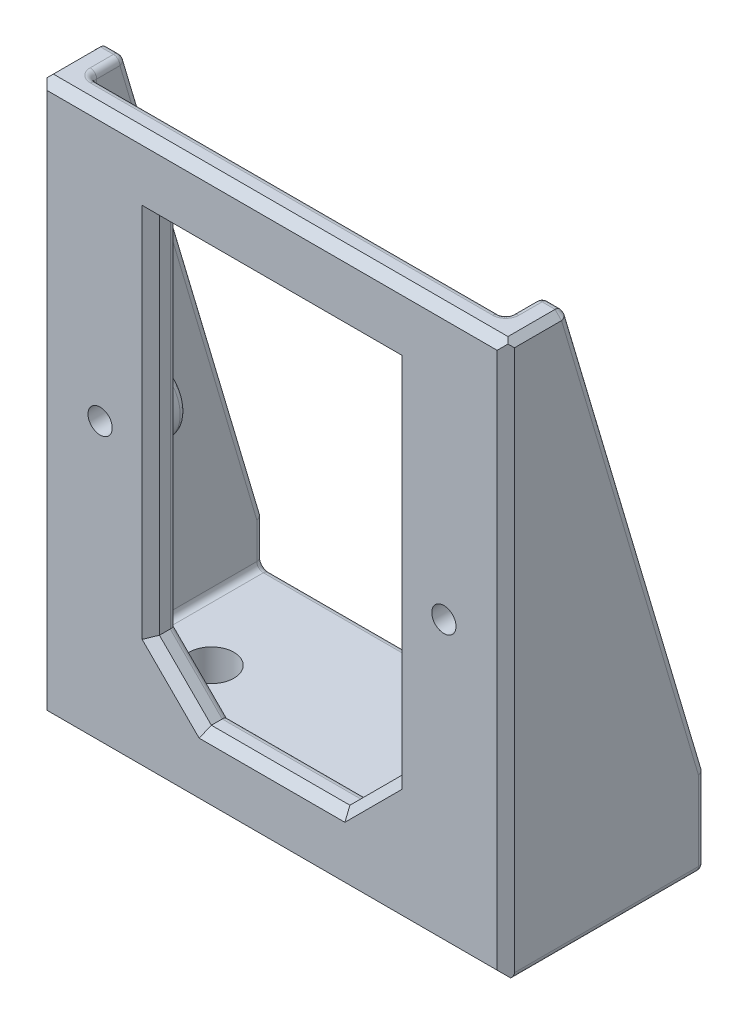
ISO-10303-21;
HEADER;
FILE_DESCRIPTION(('STEP AP214'),'2;1');
FILE_NAME('part.step','',(''),(''),'','','');
FILE_SCHEMA(('AUTOMOTIVE_DESIGN { 1 0 10303 214 1 1 1 1 }'));
ENDSEC;
DATA;
#1=APPLICATION_CONTEXT('core data for automotive mechanical design processes');
#2=APPLICATION_PROTOCOL_DEFINITION('international standard','automotive_design',2000,#1);
#3=PRODUCT_CONTEXT('',#1,'mechanical');
#4=PRODUCT('Part','Part','',(#3));
#5=PRODUCT_RELATED_PRODUCT_CATEGORY('part','',(#4));
#6=PRODUCT_DEFINITION_FORMATION('','',#4);
#7=PRODUCT_DEFINITION_CONTEXT('part definition',#1,'design');
#8=PRODUCT_DEFINITION('design','',#6,#7);
#9=PRODUCT_DEFINITION_SHAPE('','',#8);
#10=(LENGTH_UNIT() NAMED_UNIT(*) SI_UNIT(.MILLI.,.METRE.));
#11=(NAMED_UNIT(*) PLANE_ANGLE_UNIT() SI_UNIT($,.RADIAN.));
#12=(NAMED_UNIT(*) SI_UNIT($,.STERADIAN.) SOLID_ANGLE_UNIT());
#13=UNCERTAINTY_MEASURE_WITH_UNIT(LENGTH_MEASURE(1.E-05),#10,'distance_accuracy_value','');
#14=(GEOMETRIC_REPRESENTATION_CONTEXT(3) GLOBAL_UNCERTAINTY_ASSIGNED_CONTEXT((#13)) GLOBAL_UNIT_ASSIGNED_CONTEXT((#10,
#11,#12)) REPRESENTATION_CONTEXT('',''));
#15=CARTESIAN_POINT('',(0.,0.,0.));
#16=DIRECTION('',(0.,0.,1.));
#17=DIRECTION('',(1.,0.,0.));
#18=AXIS2_PLACEMENT_3D('',#15,#16,#17);
#19=CARTESIAN_POINT('',(24.,0.,-20.));
#20=DIRECTION('',(0.,0.,-1.));
#21=DIRECTION('',(-1.,0.,0.));
#22=AXIS2_PLACEMENT_3D('',#19,#20,#21);
#23=PLANE('',#22);
#24=CARTESIAN_POINT('',(23.25,5.75000000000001,-20.));
#25=DIRECTION('',(0.,0.,-1.));
#26=DIRECTION('',(-1.,0.,0.));
#27=AXIS2_PLACEMENT_3D('',#24,#25,#26);
#28=CIRCLE('',#27,1.5);
#29=CARTESIAN_POINT('',(24.75,5.75000000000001,-20.));
#30=VERTEX_POINT('',#29);
#31=CARTESIAN_POINT('',(23.25,4.25000000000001,-20.));
#32=VERTEX_POINT('',#31);
#33=EDGE_CURVE('E1428',#30,#32,#28,.T.);
#34=ORIENTED_EDGE('',*,*,#33,.F.);
#35=DIRECTION('',(0.,1.,0.));
#36=VECTOR('',#35,1.);
#37=CARTESIAN_POINT('',(24.75,10.,-20.));
#38=LINE('',#37,#36);
#39=CARTESIAN_POINT('',(24.75,9.89122602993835,-20.));
#40=VERTEX_POINT('',#39);
#41=EDGE_CURVE('E1426',#30,#40,#38,.T.);
#42=ORIENTED_EDGE('',*,*,#41,.T.);
#43=DIRECTION('',(1.,0.,0.));
#44=VECTOR('',#43,1.);
#45=CARTESIAN_POINT('',(24.,9.89122602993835,-20.));
#46=LINE('',#45,#44);
#47=CARTESIAN_POINT('',(26.25,9.89122602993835,-20.));
#48=VERTEX_POINT('',#47);
#49=EDGE_CURVE('E1418',#40,#48,#46,.T.);
#50=ORIENTED_EDGE('',*,*,#49,.T.);
#51=DIRECTION('',(0.,1.,0.));
#52=VECTOR('',#51,1.);
#53=CARTESIAN_POINT('',(26.25,0.,-20.));
#54=LINE('',#53,#52);
#55=CARTESIAN_POINT('',(26.25,0.75000000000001,-20.));
#56=VERTEX_POINT('',#55);
#57=EDGE_CURVE('E1402',#48,#56,#54,.F.);
#58=ORIENTED_EDGE('',*,*,#57,.T.);
#59=DIRECTION('',(1.,0.,0.));
#60=VECTOR('',#59,1.);
#61=CARTESIAN_POINT('',(-27.,0.75,-20.));
#62=LINE('',#61,#60);
#63=CARTESIAN_POINT('',(-26.25,0.75,-20.));
#64=VERTEX_POINT('',#63);
#65=EDGE_CURVE('E1410',#56,#64,#62,.F.);
#66=ORIENTED_EDGE('',*,*,#65,.T.);
#67=DIRECTION('',(0.,1.,0.));
#68=VECTOR('',#67,1.);
#69=CARTESIAN_POINT('',(-26.25,10.,-20.));
#70=LINE('',#69,#68);
#71=CARTESIAN_POINT('',(-26.25,9.89122602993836,-20.));
#72=VERTEX_POINT('',#71);
#73=EDGE_CURVE('E1412',#64,#72,#70,.T.);
#74=ORIENTED_EDGE('',*,*,#73,.T.);
#75=DIRECTION('',(-1.,0.,0.));
#76=VECTOR('',#75,1.);
#77=CARTESIAN_POINT('',(-24.,9.89122602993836,-20.));
#78=LINE('',#77,#76);
#79=CARTESIAN_POINT('',(-24.75,9.89122602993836,-20.));
#80=VERTEX_POINT('',#79);
#81=EDGE_CURVE('E1414',#72,#80,#78,.F.);
#82=ORIENTED_EDGE('',*,*,#81,.T.);
#83=DIRECTION('',(0.,1.,0.));
#84=VECTOR('',#83,1.);
#85=CARTESIAN_POINT('',(-24.75,4.99999999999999,-20.));
#86=LINE('',#85,#84);
#87=CARTESIAN_POINT('',(-24.75,5.74999999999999,-20.));
#88=VERTEX_POINT('',#87);
#89=EDGE_CURVE('E1416',#80,#88,#86,.F.);
#90=ORIENTED_EDGE('',*,*,#89,.T.);
#91=CARTESIAN_POINT('',(-23.25,5.74999999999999,-20.));
#92=DIRECTION('',(0.,0.,-1.));
#93=DIRECTION('',(-1.,0.,0.));
#94=AXIS2_PLACEMENT_3D('',#91,#92,#93);
#95=CIRCLE('',#94,1.5);
#96=CARTESIAN_POINT('',(-23.25,4.25,-20.));
#97=VERTEX_POINT('',#96);
#98=EDGE_CURVE('E1421',#97,#88,#95,.T.);
#99=ORIENTED_EDGE('',*,*,#98,.F.);
#100=DIRECTION('',(1.,0.,0.));
#101=VECTOR('',#100,1.);
#102=CARTESIAN_POINT('',(24.,4.25000000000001,-20.));
#103=LINE('',#102,#101);
#104=EDGE_CURVE('E1424',#97,#32,#103,.T.);
#105=ORIENTED_EDGE('',*,*,#104,.T.);
#106=EDGE_LOOP('',(#34,#42,#50,#58,#66,#74,#82,#90,#99,#105));
#107=FACE_BOUND('',#106,.T.);
#108=ADVANCED_FACE('F35',(#107),#23,.T.);
#109=CARTESIAN_POINT('',(-24.,0.,0.));
#110=DIRECTION('',(-1.,0.,0.));
#111=DIRECTION('',(0.,1.,0.));
#112=AXIS2_PLACEMENT_3D('',#109,#110,#111);
#113=PLANE('',#112);
#114=CARTESIAN_POINT('',(-24.,29.75,-2.25));
#115=DIRECTION('',(-1.,0.,0.));
#116=DIRECTION('',(0.,-1.,0.));
#117=AXIS2_PLACEMENT_3D('',#114,#115,#116);
#118=CIRCLE('',#117,1.5);
#119=CARTESIAN_POINT('',(-24.,28.25,-2.25));
#120=VERTEX_POINT('',#119);
#121=CARTESIAN_POINT('',(-24.,29.75,-3.75));
#122=VERTEX_POINT('',#121);
#123=EDGE_CURVE('E890',#120,#122,#118,.F.);
#124=ORIENTED_EDGE('',*,*,#123,.F.);
#125=DIRECTION('',(0.,0.,1.));
#126=VECTOR('',#125,1.);
#127=CARTESIAN_POINT('',(-24.,28.25,0.));
#128=LINE('',#127,#126);
#129=CARTESIAN_POINT('',(-24.,28.25,-0.75));
#130=VERTEX_POINT('',#129);
#131=EDGE_CURVE('E887',#120,#130,#128,.T.);
#132=ORIENTED_EDGE('',*,*,#131,.T.);
#133=DIRECTION('',(0.,-1.,0.));
#134=VECTOR('',#133,1.);
#135=CARTESIAN_POINT('',(-24.,5.,-0.75));
#136=LINE('',#135,#134);
#137=CARTESIAN_POINT('',(-24.,5.74999999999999,-0.75));
#138=VERTEX_POINT('',#137);
#139=EDGE_CURVE('E880',#130,#138,#136,.T.);
#140=ORIENTED_EDGE('',*,*,#139,.T.);
#141=DIRECTION('',(0.,0.,-1.));
#142=VECTOR('',#141,1.);
#143=CARTESIAN_POINT('',(-24.,5.74999999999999,0.));
#144=LINE('',#143,#142);
#145=CARTESIAN_POINT('',(-24.,5.74999999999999,-19.25));
#146=VERTEX_POINT('',#145);
#147=EDGE_CURVE('E873',#138,#146,#144,.T.);
#148=ORIENTED_EDGE('',*,*,#147,.T.);
#149=DIRECTION('',(0.,1.,0.));
#150=VECTOR('',#149,1.);
#151=CARTESIAN_POINT('',(-24.,10.,-19.25));
#152=LINE('',#151,#150);
#153=CARTESIAN_POINT('',(-24.,9.89122602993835,-19.25));
#154=VERTEX_POINT('',#153);
#155=EDGE_CURVE('E869',#146,#154,#152,.T.);
#156=ORIENTED_EDGE('',*,*,#155,.T.);
#157=DIRECTION('',(0.,0.958798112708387,0.284088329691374));
#158=VECTOR('',#157,1.);
#159=CARTESIAN_POINT('',(-24.,6.04166263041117,-20.3906113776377));
#160=LINE('',#159,#158);
#161=CARTESIAN_POINT('',(-24.,63.25,-3.43999289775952));
#162=VERTEX_POINT('',#161);
#163=EDGE_CURVE('E871',#154,#162,#160,.T.);
#164=ORIENTED_EDGE('',*,*,#163,.T.);
#165=DIRECTION('',(0.,0.,1.));
#166=VECTOR('',#165,1.);
#167=CARTESIAN_POINT('',(-24.,63.25,0.));
#168=LINE('',#167,#166);
#169=CARTESIAN_POINT('',(-24.,63.25,-0.75));
#170=VERTEX_POINT('',#169);
#171=EDGE_CURVE('E495',#162,#170,#168,.T.);
#172=ORIENTED_EDGE('',*,*,#171,.T.);
#173=DIRECTION('',(0.,-1.,0.));
#174=VECTOR('',#173,1.);
#175=CARTESIAN_POINT('',(-24.,37.,-0.75));
#176=LINE('',#175,#174);
#177=CARTESIAN_POINT('',(-24.,37.75,-0.75));
#178=VERTEX_POINT('',#177);
#179=EDGE_CURVE('E876',#170,#178,#176,.T.);
#180=ORIENTED_EDGE('',*,*,#179,.T.);
#181=DIRECTION('',(0.,0.,1.));
#182=VECTOR('',#181,1.);
#183=CARTESIAN_POINT('',(-24.,37.75,-3.));
#184=LINE('',#183,#182);
#185=CARTESIAN_POINT('',(-24.,37.75,-2.25));
#186=VERTEX_POINT('',#185);
#187=EDGE_CURVE('E878',#178,#186,#184,.F.);
#188=ORIENTED_EDGE('',*,*,#187,.T.);
#189=CARTESIAN_POINT('',(-24.,36.25,-2.25));
#190=DIRECTION('',(-1.,0.,0.));
#191=DIRECTION('',(0.,-1.,0.));
#192=AXIS2_PLACEMENT_3D('',#189,#190,#191);
#193=CIRCLE('',#192,1.5);
#194=CARTESIAN_POINT('',(-24.,36.25,-3.75));
#195=VERTEX_POINT('',#194);
#196=EDGE_CURVE('E882',#195,#186,#193,.F.);
#197=ORIENTED_EDGE('',*,*,#196,.F.);
#198=DIRECTION('',(0.,1.,0.));
#199=VECTOR('',#198,1.);
#200=CARTESIAN_POINT('',(-24.,29.,-3.75));
#201=LINE('',#200,#199);
#202=EDGE_CURVE('E885',#195,#122,#201,.F.);
#203=ORIENTED_EDGE('',*,*,#202,.T.);
#204=EDGE_LOOP('',(#124,#132,#140,#148,#156,#164,#172,#180,#188,#197,#203));
#205=FACE_BOUND('',#204,.T.);
#206=ADVANCED_FACE('F1256',(#205),#113,.F.);
#207=CARTESIAN_POINT('',(0.,0.,0.));
#208=DIRECTION('',(0.,0.,1.));
#209=DIRECTION('',(1.,0.,0.));
#210=AXIS2_PLACEMENT_3D('',#207,#208,#209);
#211=PLANE('',#210);
#212=DIRECTION('',(0.707106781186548,-0.707106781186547,0.));
#213=VECTOR('',#212,1.);
#214=CARTESIAN_POINT('',(-8.5303300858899,7.46966991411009,0.));
#215=LINE('',#214,#213);
#216=CARTESIAN_POINT('',(-14.75,13.6893398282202,0.));
#217=VERTEX_POINT('',#216);
#218=CARTESIAN_POINT('',(-8.31066017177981,7.25,0.));
#219=VERTEX_POINT('',#218);
#220=EDGE_CURVE('E812',#217,#219,#215,.T.);
#221=ORIENTED_EDGE('',*,*,#220,.T.);
#222=DIRECTION('',(1.,0.,0.));
#223=VECTOR('',#222,1.);
#224=CARTESIAN_POINT('',(8.00000000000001,7.25,0.));
#225=LINE('',#224,#223);
#226=CARTESIAN_POINT('',(8.31066017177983,7.25,0.));
#227=VERTEX_POINT('',#226);
#228=EDGE_CURVE('E822',#219,#227,#225,.T.);
#229=ORIENTED_EDGE('',*,*,#228,.T.);
#230=DIRECTION('',(0.707106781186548,0.707106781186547,0.));
#231=VECTOR('',#230,1.);
#232=CARTESIAN_POINT('',(14.5303300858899,13.4696699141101,0.));
#233=LINE('',#232,#231);
#234=CARTESIAN_POINT('',(14.75,13.6893398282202,0.));
#235=VERTEX_POINT('',#234);
#236=EDGE_CURVE('E820',#227,#235,#233,.T.);
#237=ORIENTED_EDGE('',*,*,#236,.T.);
#238=DIRECTION('',(0.,1.,0.));
#239=VECTOR('',#238,1.);
#240=CARTESIAN_POINT('',(14.75,56.,0.));
#241=LINE('',#240,#239);
#242=CARTESIAN_POINT('',(14.75,56.75,0.));
#243=VERTEX_POINT('',#242);
#244=EDGE_CURVE('E818',#235,#243,#241,.T.);
#245=ORIENTED_EDGE('',*,*,#244,.T.);
#246=DIRECTION('',(-1.,0.,0.));
#247=VECTOR('',#246,1.);
#248=CARTESIAN_POINT('',(-14.,56.75,0.));
#249=LINE('',#248,#247);
#250=CARTESIAN_POINT('',(-14.75,56.75,0.));
#251=VERTEX_POINT('',#250);
#252=EDGE_CURVE('E816',#243,#251,#249,.T.);
#253=ORIENTED_EDGE('',*,*,#252,.T.);
#254=DIRECTION('',(0.,-1.,0.));
#255=VECTOR('',#254,1.);
#256=CARTESIAN_POINT('',(-14.75,14.,0.));
#257=LINE('',#256,#255);
#258=EDGE_CURVE('E814',#251,#217,#257,.T.);
#259=ORIENTED_EDGE('',*,*,#258,.T.);
#260=EDGE_LOOP('',(#221,#229,#237,#245,#253,#259));
#261=FACE_BOUND('',#260,.T.);
#262=DIRECTION('',(-1.,0.,0.));
#263=VECTOR('',#262,1.);
#264=CARTESIAN_POINT('',(24.,28.25,0.));
#265=LINE('',#264,#263);
#266=CARTESIAN_POINT('',(19.85,28.25,0.));
#267=VERTEX_POINT('',#266);
#268=CARTESIAN_POINT('',(23.25,28.25,0.));
#269=VERTEX_POINT('',#268);
#270=EDGE_CURVE('E808',#267,#269,#265,.F.);
#271=ORIENTED_EDGE('',*,*,#270,.T.);
#272=DIRECTION('',(0.,-1.,0.));
#273=VECTOR('',#272,1.);
#274=CARTESIAN_POINT('',(23.25,5.,0.));
#275=LINE('',#274,#273);
#276=CARTESIAN_POINT('',(23.25,5.,0.));
#277=VERTEX_POINT('',#276);
#278=EDGE_CURVE('E810',#269,#277,#275,.T.);
#279=ORIENTED_EDGE('',*,*,#278,.T.);
#280=DIRECTION('',(-1.,0.,0.));
#281=VECTOR('',#280,1.);
#282=CARTESIAN_POINT('',(-24.,4.99999999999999,0.));
#283=LINE('',#282,#281);
#284=CARTESIAN_POINT('',(-23.25,4.99999999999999,0.));
#285=VERTEX_POINT('',#284);
#286=EDGE_CURVE('E1529',#277,#285,#283,.T.);
#287=ORIENTED_EDGE('',*,*,#286,.T.);
#288=DIRECTION('',(0.,-1.,0.));
#289=VECTOR('',#288,1.);
#290=CARTESIAN_POINT('',(-23.25,29.,0.));
#291=LINE('',#290,#289);
#292=CARTESIAN_POINT('',(-23.25,28.25,0.));
#293=VERTEX_POINT('',#292);
#294=EDGE_CURVE('E795',#285,#293,#291,.F.);
#295=ORIENTED_EDGE('',*,*,#294,.T.);
#296=DIRECTION('',(-1.,0.,0.));
#297=VECTOR('',#296,1.);
#298=CARTESIAN_POINT('',(-19.85,28.25,0.));
#299=LINE('',#298,#297);
#300=CARTESIAN_POINT('',(-19.85,28.25,0.));
#301=VERTEX_POINT('',#300);
#302=EDGE_CURVE('E791',#293,#301,#299,.F.);
#303=ORIENTED_EDGE('',*,*,#302,.T.);
#304=CARTESIAN_POINT('',(-19.85,33.,0.));
#305=DIRECTION('',(0.,0.,1.));
#306=DIRECTION('',(1.,0.,0.));
#307=AXIS2_PLACEMENT_3D('',#304,#305,#306);
#308=CIRCLE('',#307,4.75);
#309=CARTESIAN_POINT('',(-19.85,37.75,0.));
#310=VERTEX_POINT('',#309);
#311=EDGE_CURVE('E782',#301,#310,#308,.T.);
#312=ORIENTED_EDGE('',*,*,#311,.T.);
#313=DIRECTION('',(1.,0.,0.));
#314=VECTOR('',#313,1.);
#315=CARTESIAN_POINT('',(-24.,37.75,0.));
#316=LINE('',#315,#314);
#317=CARTESIAN_POINT('',(-23.25,37.75,0.));
#318=VERTEX_POINT('',#317);
#319=EDGE_CURVE('E793',#310,#318,#316,.F.);
#320=ORIENTED_EDGE('',*,*,#319,.T.);
#321=DIRECTION('',(0.,-1.,0.));
#322=VECTOR('',#321,1.);
#323=CARTESIAN_POINT('',(-23.25,64.,0.));
#324=LINE('',#323,#322);
#325=CARTESIAN_POINT('',(-23.25,63.25,0.));
#326=VERTEX_POINT('',#325);
#327=EDGE_CURVE('E797',#318,#326,#324,.F.);
#328=ORIENTED_EDGE('',*,*,#327,.T.);
#329=DIRECTION('',(-1.,0.,0.));
#330=VECTOR('',#329,1.);
#331=CARTESIAN_POINT('',(0.,63.25,0.));
#332=LINE('',#331,#330);
#333=CARTESIAN_POINT('',(23.25,63.25,0.));
#334=VERTEX_POINT('',#333);
#335=EDGE_CURVE('E799',#326,#334,#332,.F.);
#336=ORIENTED_EDGE('',*,*,#335,.T.);
#337=DIRECTION('',(0.,-1.,0.));
#338=VECTOR('',#337,1.);
#339=CARTESIAN_POINT('',(23.25,37.,0.));
#340=LINE('',#339,#338);
#341=CARTESIAN_POINT('',(23.25,37.75,0.));
#342=VERTEX_POINT('',#341);
#343=EDGE_CURVE('E802',#334,#342,#340,.T.);
#344=ORIENTED_EDGE('',*,*,#343,.T.);
#345=DIRECTION('',(1.,0.,0.));
#346=VECTOR('',#345,1.);
#347=CARTESIAN_POINT('',(19.85,37.75,0.));
#348=LINE('',#347,#346);
#349=CARTESIAN_POINT('',(19.85,37.75,0.));
#350=VERTEX_POINT('',#349);
#351=EDGE_CURVE('E804',#342,#350,#348,.F.);
#352=ORIENTED_EDGE('',*,*,#351,.T.);
#353=CARTESIAN_POINT('',(19.85,33.,0.));
#354=DIRECTION('',(0.,0.,1.));
#355=DIRECTION('',(1.,0.,0.));
#356=AXIS2_PLACEMENT_3D('',#353,#354,#355);
#357=CIRCLE('',#356,4.74999999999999);
#358=EDGE_CURVE('E806',#350,#267,#357,.T.);
#359=ORIENTED_EDGE('',*,*,#358,.T.);
#360=EDGE_LOOP('',(#271,#279,#287,#295,#303,#312,#320,#328,#336,#344,#352,#359));
#361=FACE_BOUND('',#360,.T.);
#362=ADVANCED_FACE('F1262',(#261,#361),#211,.F.);
#363=CARTESIAN_POINT('',(24.,0.,0.));
#364=DIRECTION('',(1.,0.,0.));
#365=DIRECTION('',(0.,1.,0.));
#366=AXIS2_PLACEMENT_3D('',#363,#364,#365);
#367=PLANE('',#366);
#368=CARTESIAN_POINT('',(24.,36.25,-2.25));
#369=DIRECTION('',(1.,0.,0.));
#370=DIRECTION('',(0.,1.,0.));
#371=AXIS2_PLACEMENT_3D('',#368,#369,#370);
#372=CIRCLE('',#371,1.5);
#373=CARTESIAN_POINT('',(24.,37.75,-2.25));
#374=VERTEX_POINT('',#373);
#375=CARTESIAN_POINT('',(24.,36.25,-3.75));
#376=VERTEX_POINT('',#375);
#377=EDGE_CURVE('E919',#374,#376,#372,.F.);
#378=ORIENTED_EDGE('',*,*,#377,.F.);
#379=DIRECTION('',(0.,0.,1.));
#380=VECTOR('',#379,1.);
#381=CARTESIAN_POINT('',(24.,37.75,0.));
#382=LINE('',#381,#380);
#383=CARTESIAN_POINT('',(24.,37.75,-0.75));
#384=VERTEX_POINT('',#383);
#385=EDGE_CURVE('E922',#374,#384,#382,.T.);
#386=ORIENTED_EDGE('',*,*,#385,.T.);
#387=DIRECTION('',(0.,-1.,0.));
#388=VECTOR('',#387,1.);
#389=CARTESIAN_POINT('',(24.,64.,-0.75));
#390=LINE('',#389,#388);
#391=CARTESIAN_POINT('',(24.,63.25,-0.75));
#392=VERTEX_POINT('',#391);
#393=EDGE_CURVE('E917',#384,#392,#390,.F.);
#394=ORIENTED_EDGE('',*,*,#393,.T.);
#395=DIRECTION('',(0.,0.,1.));
#396=VECTOR('',#395,1.);
#397=CARTESIAN_POINT('',(24.,63.25,0.));
#398=LINE('',#397,#396);
#399=CARTESIAN_POINT('',(24.,63.25,-3.43999289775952));
#400=VERTEX_POINT('',#399);
#401=EDGE_CURVE('E909',#392,#400,#398,.F.);
#402=ORIENTED_EDGE('',*,*,#401,.T.);
#403=DIRECTION('',(0.,0.958798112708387,0.284088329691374));
#404=VECTOR('',#403,1.);
#405=CARTESIAN_POINT('',(24.,9.78693375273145,-19.2809014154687));
#406=LINE('',#405,#404);
#407=CARTESIAN_POINT('',(24.,9.89122602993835,-19.25));
#408=VERTEX_POINT('',#407);
#409=EDGE_CURVE('E901',#400,#408,#406,.F.);
#410=ORIENTED_EDGE('',*,*,#409,.T.);
#411=DIRECTION('',(0.,1.,0.));
#412=VECTOR('',#411,1.);
#413=CARTESIAN_POINT('',(24.,5.00000000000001,-19.25));
#414=LINE('',#413,#412);
#415=CARTESIAN_POINT('',(24.,5.75000000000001,-19.25));
#416=VERTEX_POINT('',#415);
#417=EDGE_CURVE('E899',#408,#416,#414,.F.);
#418=ORIENTED_EDGE('',*,*,#417,.T.);
#419=DIRECTION('',(0.,0.,1.));
#420=VECTOR('',#419,1.);
#421=CARTESIAN_POINT('',(24.,5.75000000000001,0.));
#422=LINE('',#421,#420);
#423=CARTESIAN_POINT('',(24.,5.75000000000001,-0.75));
#424=VERTEX_POINT('',#423);
#425=EDGE_CURVE('E903',#416,#424,#422,.T.);
#426=ORIENTED_EDGE('',*,*,#425,.T.);
#427=DIRECTION('',(0.,-1.,0.));
#428=VECTOR('',#427,1.);
#429=CARTESIAN_POINT('',(24.,29.,-0.75));
#430=LINE('',#429,#428);
#431=CARTESIAN_POINT('',(24.,28.25,-0.75));
#432=VERTEX_POINT('',#431);
#433=EDGE_CURVE('E905',#424,#432,#430,.F.);
#434=ORIENTED_EDGE('',*,*,#433,.T.);
#435=DIRECTION('',(0.,0.,1.));
#436=VECTOR('',#435,1.);
#437=CARTESIAN_POINT('',(24.,28.25,-3.));
#438=LINE('',#437,#436);
#439=CARTESIAN_POINT('',(24.,28.25,-2.25));
#440=VERTEX_POINT('',#439);
#441=EDGE_CURVE('E907',#432,#440,#438,.F.);
#442=ORIENTED_EDGE('',*,*,#441,.T.);
#443=CARTESIAN_POINT('',(24.,29.75,-2.25));
#444=DIRECTION('',(1.,0.,0.));
#445=DIRECTION('',(0.,1.,0.));
#446=AXIS2_PLACEMENT_3D('',#443,#444,#445);
#447=CIRCLE('',#446,1.5);
#448=CARTESIAN_POINT('',(24.,29.75,-3.75));
#449=VERTEX_POINT('',#448);
#450=EDGE_CURVE('E912',#449,#440,#447,.F.);
#451=ORIENTED_EDGE('',*,*,#450,.F.);
#452=DIRECTION('',(0.,-1.,0.));
#453=VECTOR('',#452,1.);
#454=CARTESIAN_POINT('',(24.,0.,-3.75));
#455=LINE('',#454,#453);
#456=EDGE_CURVE('E915',#449,#376,#455,.F.);
#457=ORIENTED_EDGE('',*,*,#456,.T.);
#458=EDGE_LOOP('',(#378,#386,#394,#402,#410,#418,#426,#434,#442,#451,#457));
#459=FACE_BOUND('',#458,.T.);
#460=ADVANCED_FACE('F1305',(#459),#367,.F.);
#461=CARTESIAN_POINT('',(0.,0.,3.));
#462=DIRECTION('',(0.,0.,1.));
#463=DIRECTION('',(1.,0.,0.));
#464=AXIS2_PLACEMENT_3D('',#461,#462,#463);
#465=PLANE('',#464);
#466=DIRECTION('',(0.,1.,0.));
#467=VECTOR('',#466,1.);
#468=CARTESIAN_POINT('',(-15.,0.,3.));
#469=LINE('',#468,#467);
#470=CARTESIAN_POINT('',(-15.,13.5857864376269,3.));
#471=VERTEX_POINT('',#470);
#472=CARTESIAN_POINT('',(-15.,57.,3.));
#473=VERTEX_POINT('',#472);
#474=EDGE_CURVE('E707',#471,#473,#469,.T.);
#475=ORIENTED_EDGE('',*,*,#474,.T.);
#476=DIRECTION('',(1.,0.,0.));
#477=VECTOR('',#476,1.);
#478=CARTESIAN_POINT('',(0.,57.,3.));
#479=LINE('',#478,#477);
#480=CARTESIAN_POINT('',(15.,57.,3.));
#481=VERTEX_POINT('',#480);
#482=EDGE_CURVE('E717',#473,#481,#479,.T.);
#483=ORIENTED_EDGE('',*,*,#482,.T.);
#484=DIRECTION('',(0.,-1.,0.));
#485=VECTOR('',#484,1.);
#486=CARTESIAN_POINT('',(15.,0.,3.));
#487=LINE('',#486,#485);
#488=CARTESIAN_POINT('',(15.,13.5857864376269,3.));
#489=VERTEX_POINT('',#488);
#490=EDGE_CURVE('E715',#481,#489,#487,.T.);
#491=ORIENTED_EDGE('',*,*,#490,.T.);
#492=DIRECTION('',(-0.707106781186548,-0.707106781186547,0.));
#493=VECTOR('',#492,1.);
#494=CARTESIAN_POINT('',(0.707106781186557,-0.707106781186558,3.));
#495=LINE('',#494,#493);
#496=CARTESIAN_POINT('',(8.41421356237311,6.99999999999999,3.));
#497=VERTEX_POINT('',#496);
#498=EDGE_CURVE('E713',#489,#497,#495,.T.);
#499=ORIENTED_EDGE('',*,*,#498,.T.);
#500=DIRECTION('',(-1.,0.,0.));
#501=VECTOR('',#500,1.);
#502=CARTESIAN_POINT('',(0.,6.99999999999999,3.));
#503=LINE('',#502,#501);
#504=CARTESIAN_POINT('',(-8.4142135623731,6.99999999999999,3.));
#505=VERTEX_POINT('',#504);
#506=EDGE_CURVE('E711',#497,#505,#503,.T.);
#507=ORIENTED_EDGE('',*,*,#506,.T.);
#508=DIRECTION('',(-0.707106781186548,0.707106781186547,0.));
#509=VECTOR('',#508,1.);
#510=CARTESIAN_POINT('',(-0.707106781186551,-0.707106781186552,3.));
#511=LINE('',#510,#509);
#512=EDGE_CURVE('E709',#505,#471,#511,.T.);
#513=ORIENTED_EDGE('',*,*,#512,.T.);
#514=EDGE_LOOP('',(#475,#483,#491,#499,#507,#513));
#515=FACE_BOUND('',#514,.T.);
#516=CARTESIAN_POINT('',(-19.85,33.,3.));
#517=DIRECTION('',(0.,0.,1.));
#518=DIRECTION('',(1.,0.,0.));
#519=AXIS2_PLACEMENT_3D('',#516,#517,#518);
#520=CIRCLE('',#519,1.4);
#521=CARTESIAN_POINT('',(-18.45,33.,3.));
#522=VERTEX_POINT('',#521);
#523=EDGE_CURVE('E1505',#522,#522,#520,.T.);
#524=ORIENTED_EDGE('',*,*,#523,.F.);
#525=EDGE_LOOP('',(#524));
#526=FACE_BOUND('',#525,.T.);
#527=DIRECTION('',(-1.,0.,0.));
#528=VECTOR('',#527,1.);
#529=CARTESIAN_POINT('',(-27.,63.,3.));
#530=LINE('',#529,#528);
#531=CARTESIAN_POINT('',(26.,63.,3.));
#532=VERTEX_POINT('',#531);
#533=CARTESIAN_POINT('',(-26.,63.,3.));
#534=VERTEX_POINT('',#533);
#535=EDGE_CURVE('E704',#532,#534,#530,.T.);
#536=ORIENTED_EDGE('',*,*,#535,.T.);
#537=DIRECTION('',(0.,-1.,0.));
#538=VECTOR('',#537,1.);
#539=CARTESIAN_POINT('',(-26.,1.,3.));
#540=LINE('',#539,#538);
#541=CARTESIAN_POINT('',(-26.,0.999999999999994,3.));
#542=VERTEX_POINT('',#541);
#543=EDGE_CURVE('E758',#534,#542,#540,.T.);
#544=ORIENTED_EDGE('',*,*,#543,.T.);
#545=DIRECTION('',(1.,0.,0.));
#546=VECTOR('',#545,1.);
#547=CARTESIAN_POINT('',(26.25,1.,3.));
#548=LINE('',#547,#546);
#549=CARTESIAN_POINT('',(26.,1.,3.));
#550=VERTEX_POINT('',#549);
#551=EDGE_CURVE('E700',#542,#550,#548,.T.);
#552=ORIENTED_EDGE('',*,*,#551,.T.);
#553=DIRECTION('',(0.,1.,0.));
#554=VECTOR('',#553,1.);
#555=CARTESIAN_POINT('',(26.,63.,3.));
#556=LINE('',#555,#554);
#557=EDGE_CURVE('E739',#550,#532,#556,.T.);
#558=ORIENTED_EDGE('',*,*,#557,.T.);
#559=EDGE_LOOP('',(#536,#544,#552,#558));
#560=FACE_BOUND('',#559,.T.);
#561=CARTESIAN_POINT('',(19.85,33.,3.));
#562=DIRECTION('',(0.,0.,1.));
#563=DIRECTION('',(1.,0.,0.));
#564=AXIS2_PLACEMENT_3D('',#561,#562,#563);
#565=CIRCLE('',#564,1.4);
#566=CARTESIAN_POINT('',(21.25,33.,3.));
#567=VERTEX_POINT('',#566);
#568=EDGE_CURVE('E1508',#567,#567,#565,.T.);
#569=ORIENTED_EDGE('',*,*,#568,.F.);
#570=EDGE_LOOP('',(#569));
#571=FACE_BOUND('',#570,.T.);
#572=ADVANCED_FACE('F1301',(#515,#526,#560,#571),#465,.T.);
#573=CARTESIAN_POINT('',(-27.,64.,3.));
#574=DIRECTION('',(1.,0.,0.));
#575=DIRECTION('',(0.,1.,0.));
#576=AXIS2_PLACEMENT_3D('',#573,#574,#575);
#577=PLANE('',#576);
#578=DIRECTION('',(0.,1.,0.));
#579=VECTOR('',#578,1.);
#580=CARTESIAN_POINT('',(-27.,63.,1.99999999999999));
#581=LINE('',#580,#579);
#582=CARTESIAN_POINT('',(-27.,0.750000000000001,1.99999999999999));
#583=VERTEX_POINT('',#582);
#584=CARTESIAN_POINT('',(-27.,63.25,1.99999999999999));
#585=VERTEX_POINT('',#584);
#586=EDGE_CURVE('E767',#583,#585,#581,.T.);
#587=ORIENTED_EDGE('',*,*,#586,.T.);
#588=DIRECTION('',(0.,0.,-1.));
#589=VECTOR('',#588,1.);
#590=CARTESIAN_POINT('',(-27.,63.25,3.));
#591=LINE('',#590,#589);
#592=CARTESIAN_POINT('',(-27.,63.25,-3.43999289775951));
#593=VERTEX_POINT('',#592);
#594=EDGE_CURVE('E48',#585,#593,#591,.T.);
#595=ORIENTED_EDGE('',*,*,#594,.T.);
#596=DIRECTION('',(0.,0.958798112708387,0.284088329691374));
#597=VECTOR('',#596,1.);
#598=CARTESIAN_POINT('',(-27.,65.6936172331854,-2.71595816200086));
#599=LINE('',#598,#597);
#600=CARTESIAN_POINT('',(-27.,9.89122602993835,-19.25));
#601=VERTEX_POINT('',#600);
#602=EDGE_CURVE('E1399',#593,#601,#599,.F.);
#603=ORIENTED_EDGE('',*,*,#602,.T.);
#604=DIRECTION('',(0.,1.,0.));
#605=VECTOR('',#604,1.);
#606=CARTESIAN_POINT('',(-27.,0.,-19.25));
#607=LINE('',#606,#605);
#608=CARTESIAN_POINT('',(-27.,0.75,-19.25));
#609=VERTEX_POINT('',#608);
#610=EDGE_CURVE('E1403',#601,#609,#607,.F.);
#611=ORIENTED_EDGE('',*,*,#610,.T.);
#612=DIRECTION('',(0.,0.,-1.));
#613=VECTOR('',#612,1.);
#614=CARTESIAN_POINT('',(-27.,0.750000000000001,3.));
#615=LINE('',#614,#613);
#616=EDGE_CURVE('E2551',#609,#583,#615,.F.);
#617=ORIENTED_EDGE('',*,*,#616,.T.);
#618=EDGE_LOOP('',(#587,#595,#603,#611,#617));
#619=FACE_BOUND('',#618,.T.);
#620=ADVANCED_FACE('F1304',(#619),#577,.F.);
#621=CARTESIAN_POINT('',(-27.,0.,3.));
#622=DIRECTION('',(0.,1.,0.));
#623=DIRECTION('',(-1.,0.,0.));
#624=AXIS2_PLACEMENT_3D('',#621,#622,#623);
#625=PLANE('',#624);
#626=DIRECTION('',(0.,0.,-1.));
#627=VECTOR('',#626,1.);
#628=CARTESIAN_POINT('',(26.25,0.,3.));
#629=LINE('',#628,#627);
#630=CARTESIAN_POINT('',(26.25,0.,-19.25));
#631=VERTEX_POINT('',#630);
#632=CARTESIAN_POINT('',(26.25,0.,2.));
#633=VERTEX_POINT('',#632);
#634=EDGE_CURVE('E1435',#631,#633,#629,.F.);
#635=ORIENTED_EDGE('',*,*,#634,.T.);
#636=DIRECTION('',(-1.,0.,0.));
#637=VECTOR('',#636,1.);
#638=CARTESIAN_POINT('',(-26.25,0.,2.));
#639=LINE('',#638,#637);
#640=CARTESIAN_POINT('',(-26.25,0.,2.));
#641=VERTEX_POINT('',#640);
#642=EDGE_CURVE('E734',#633,#641,#639,.T.);
#643=ORIENTED_EDGE('',*,*,#642,.T.);
#644=DIRECTION('',(0.,0.,-1.));
#645=VECTOR('',#644,1.);
#646=CARTESIAN_POINT('',(-26.25,0.,3.));
#647=LINE('',#646,#645);
#648=CARTESIAN_POINT('',(-26.25,0.,-19.25));
#649=VERTEX_POINT('',#648);
#650=EDGE_CURVE('E1431',#641,#649,#647,.T.);
#651=ORIENTED_EDGE('',*,*,#650,.T.);
#652=DIRECTION('',(1.,0.,0.));
#653=VECTOR('',#652,1.);
#654=CARTESIAN_POINT('',(27.,0.,-19.25));
#655=LINE('',#654,#653);
#656=EDGE_CURVE('E1433',#649,#631,#655,.T.);
#657=ORIENTED_EDGE('',*,*,#656,.T.);
#658=EDGE_LOOP('',(#635,#643,#651,#657));
#659=FACE_BOUND('',#658,.T.);
#660=CARTESIAN_POINT('',(17.,0.,-7.));
#661=DIRECTION('',(0.,-1.,0.));
#662=DIRECTION('',(1.,0.,0.));
#663=AXIS2_PLACEMENT_3D('',#660,#661,#662);
#664=CIRCLE('',#663,2.6);
#665=CARTESIAN_POINT('',(19.6,0.,-7.));
#666=VERTEX_POINT('',#665);
#667=EDGE_CURVE('E677',#666,#666,#664,.T.);
#668=ORIENTED_EDGE('',*,*,#667,.F.);
#669=EDGE_LOOP('',(#668));
#670=FACE_BOUND('',#669,.T.);
#671=CARTESIAN_POINT('',(-17.,0.,-7.00000000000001));
#672=DIRECTION('',(0.,-1.,0.));
#673=DIRECTION('',(1.,0.,0.));
#674=AXIS2_PLACEMENT_3D('',#671,#672,#673);
#675=CIRCLE('',#674,2.6);
#676=CARTESIAN_POINT('',(-14.4,0.,-7.00000000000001));
#677=VERTEX_POINT('',#676);
#678=EDGE_CURVE('E1533',#677,#677,#675,.T.);
#679=ORIENTED_EDGE('',*,*,#678,.F.);
#680=EDGE_LOOP('',(#679));
#681=FACE_BOUND('',#680,.T.);
#682=ADVANCED_FACE('F1315',(#659,#670,#681),#625,.F.);
#683=CARTESIAN_POINT('',(27.,0.,3.));
#684=DIRECTION('',(-1.,0.,0.));
#685=DIRECTION('',(0.,-1.,0.));
#686=AXIS2_PLACEMENT_3D('',#683,#684,#685);
#687=PLANE('',#686);
#688=DIRECTION('',(0.,0.958798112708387,0.284088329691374));
#689=VECTOR('',#688,1.);
#690=CARTESIAN_POINT('',(27.,63.7869337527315,-3.28090141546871));
#691=LINE('',#690,#689);
#692=CARTESIAN_POINT('',(27.,9.89122602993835,-19.25));
#693=VERTEX_POINT('',#692);
#694=CARTESIAN_POINT('',(27.,63.25,-3.43999289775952));
#695=VERTEX_POINT('',#694);
#696=EDGE_CURVE('E934',#693,#695,#691,.T.);
#697=ORIENTED_EDGE('',*,*,#696,.T.);
#698=DIRECTION('',(0.,0.,1.));
#699=VECTOR('',#698,1.);
#700=CARTESIAN_POINT('',(27.,63.25,3.));
#701=LINE('',#700,#699);
#702=CARTESIAN_POINT('',(27.,63.25,2.));
#703=VERTEX_POINT('',#702);
#704=EDGE_CURVE('E1758',#695,#703,#701,.T.);
#705=ORIENTED_EDGE('',*,*,#704,.T.);
#706=DIRECTION('',(0.,-1.,0.));
#707=VECTOR('',#706,1.);
#708=CARTESIAN_POINT('',(27.,1.,2.));
#709=LINE('',#708,#707);
#710=CARTESIAN_POINT('',(27.,0.75000000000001,2.));
#711=VERTEX_POINT('',#710);
#712=EDGE_CURVE('E774',#703,#711,#709,.T.);
#713=ORIENTED_EDGE('',*,*,#712,.T.);
#714=DIRECTION('',(0.,0.,-1.));
#715=VECTOR('',#714,1.);
#716=CARTESIAN_POINT('',(27.,0.75000000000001,3.));
#717=LINE('',#716,#715);
#718=CARTESIAN_POINT('',(27.,0.75000000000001,-19.25));
#719=VERTEX_POINT('',#718);
#720=EDGE_CURVE('E930',#711,#719,#717,.T.);
#721=ORIENTED_EDGE('',*,*,#720,.T.);
#722=DIRECTION('',(0.,1.,0.));
#723=VECTOR('',#722,1.);
#724=CARTESIAN_POINT('',(27.,10.,-19.25));
#725=LINE('',#724,#723);
#726=EDGE_CURVE('E932',#719,#693,#725,.T.);
#727=ORIENTED_EDGE('',*,*,#726,.T.);
#728=EDGE_LOOP('',(#697,#705,#713,#721,#727));
#729=FACE_BOUND('',#728,.T.);
#730=ADVANCED_FACE('F1312',(#729),#687,.F.);
#731=CARTESIAN_POINT('',(27.,64.,3.));
#732=DIRECTION('',(0.,-1.,0.));
#733=DIRECTION('',(0.,0.,-1.));
#734=AXIS2_PLACEMENT_3D('',#731,#732,#733);
#735=PLANE('',#734);
#736=DIRECTION('',(1.,0.,0.));
#737=VECTOR('',#736,1.);
#738=CARTESIAN_POINT('',(27.,64.,2.00000000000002));
#739=LINE('',#738,#737);
#740=CARTESIAN_POINT('',(-26.25,64.,2.00000000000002));
#741=VERTEX_POINT('',#740);
#742=CARTESIAN_POINT('',(26.25,64.,2.00000000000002));
#743=VERTEX_POINT('',#742);
#744=EDGE_CURVE('E730',#741,#743,#739,.T.);
#745=ORIENTED_EDGE('',*,*,#744,.T.);
#746=DIRECTION('',(0.,0.,-1.));
#747=VECTOR('',#746,1.);
#748=CARTESIAN_POINT('',(26.25,64.,3.));
#749=LINE('',#748,#747);
#750=CARTESIAN_POINT('',(26.25,64.,-3.43999289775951));
#751=VERTEX_POINT('',#750);
#752=EDGE_CURVE('E1757',#743,#751,#749,.T.);
#753=ORIENTED_EDGE('',*,*,#752,.T.);
#754=DIRECTION('',(1.,0.,0.));
#755=VECTOR('',#754,1.);
#756=CARTESIAN_POINT('',(24.,64.,-3.43999289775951));
#757=LINE('',#756,#755);
#758=CARTESIAN_POINT('',(24.75,64.,-3.43999289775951));
#759=VERTEX_POINT('',#758);
#760=EDGE_CURVE('E779',#751,#759,#757,.F.);
#761=ORIENTED_EDGE('',*,*,#760,.T.);
#762=DIRECTION('',(0.,0.,1.));
#763=VECTOR('',#762,1.);
#764=CARTESIAN_POINT('',(24.75,64.,3.));
#765=LINE('',#764,#763);
#766=CARTESIAN_POINT('',(24.75,64.,-0.75));
#767=VERTEX_POINT('',#766);
#768=EDGE_CURVE('E783',#759,#767,#765,.T.);
#769=ORIENTED_EDGE('',*,*,#768,.T.);
#770=CARTESIAN_POINT('',(23.25,64.,-0.75));
#771=DIRECTION('',(0.,-1.,0.));
#772=DIRECTION('',(0.,0.,-1.));
#773=AXIS2_PLACEMENT_3D('',#770,#771,#772);
#774=CIRCLE('',#773,1.5);
#775=CARTESIAN_POINT('',(23.25,64.,0.75));
#776=VERTEX_POINT('',#775);
#777=EDGE_CURVE('E1490',#776,#767,#774,.F.);
#778=ORIENTED_EDGE('',*,*,#777,.F.);
#779=DIRECTION('',(-1.,0.,0.));
#780=VECTOR('',#779,1.);
#781=CARTESIAN_POINT('',(27.,64.,0.75));
#782=LINE('',#781,#780);
#783=CARTESIAN_POINT('',(-23.25,64.,0.75));
#784=VERTEX_POINT('',#783);
#785=EDGE_CURVE('E1488',#776,#784,#782,.T.);
#786=ORIENTED_EDGE('',*,*,#785,.T.);
#787=CARTESIAN_POINT('',(-23.25,64.,-0.75));
#788=DIRECTION('',(0.,-1.,0.));
#789=DIRECTION('',(0.,0.,-1.));
#790=AXIS2_PLACEMENT_3D('',#787,#788,#789);
#791=CIRCLE('',#790,1.5);
#792=CARTESIAN_POINT('',(-24.75,64.,-0.75));
#793=VERTEX_POINT('',#792);
#794=EDGE_CURVE('E466',#793,#784,#791,.F.);
#795=ORIENTED_EDGE('',*,*,#794,.F.);
#796=DIRECTION('',(0.,0.,1.));
#797=VECTOR('',#796,1.);
#798=CARTESIAN_POINT('',(-24.75,64.,3.));
#799=LINE('',#798,#797);
#800=CARTESIAN_POINT('',(-24.75,64.,-3.43999289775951));
#801=VERTEX_POINT('',#800);
#802=EDGE_CURVE('E459',#793,#801,#799,.F.);
#803=ORIENTED_EDGE('',*,*,#802,.T.);
#804=DIRECTION('',(-1.,0.,0.));
#805=VECTOR('',#804,1.);
#806=CARTESIAN_POINT('',(27.,64.,-3.43999289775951));
#807=LINE('',#806,#805);
#808=CARTESIAN_POINT('',(-26.25,64.,-3.43999289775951));
#809=VERTEX_POINT('',#808);
#810=EDGE_CURVE('E463',#801,#809,#807,.T.);
#811=ORIENTED_EDGE('',*,*,#810,.T.);
#812=DIRECTION('',(0.,0.,1.));
#813=VECTOR('',#812,1.);
#814=CARTESIAN_POINT('',(-26.25,64.,3.));
#815=LINE('',#814,#813);
#816=EDGE_CURVE('E1802',#809,#741,#815,.T.);
#817=ORIENTED_EDGE('',*,*,#816,.T.);
#818=EDGE_LOOP('',(#745,#753,#761,#769,#778,#786,#795,#803,#811,#817));
#819=FACE_BOUND('',#818,.T.);
#820=ADVANCED_FACE('F462',(#819),#735,.F.);
#821=CARTESIAN_POINT('',(-14.,14.,3.));
#822=DIRECTION('',(0.707106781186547,0.707106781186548,0.));
#823=DIRECTION('',(-0.707106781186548,0.707106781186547,0.));
#824=AXIS2_PLACEMENT_3D('',#821,#822,#823);
#825=PLANE('',#824);
#826=DIRECTION('',(0.,0.,-1.));
#827=VECTOR('',#826,1.);
#828=CARTESIAN_POINT('',(-14.,14.,3.));
#829=LINE('',#828,#827);
#830=CARTESIAN_POINT('',(-14.,14.,2.));
#831=VERTEX_POINT('',#830);
#832=CARTESIAN_POINT('',(-14.,14.,0.75));
#833=VERTEX_POINT('',#832);
#834=EDGE_CURVE('E1503',#831,#833,#829,.T.);
#835=ORIENTED_EDGE('',*,*,#834,.F.);
#836=DIRECTION('',(0.707106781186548,-0.707106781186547,0.));
#837=VECTOR('',#836,1.);
#838=CARTESIAN_POINT('',(-14.,14.,2.));
#839=LINE('',#838,#837);
#840=CARTESIAN_POINT('',(-7.99999999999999,8.,2.));
#841=VERTEX_POINT('',#840);
#842=EDGE_CURVE('E726',#831,#841,#839,.T.);
#843=ORIENTED_EDGE('',*,*,#842,.T.);
#844=DIRECTION('',(0.,0.,-1.));
#845=VECTOR('',#844,1.);
#846=CARTESIAN_POINT('',(-7.99999999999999,8.,3.));
#847=LINE('',#846,#845);
#848=CARTESIAN_POINT('',(-7.99999999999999,8.,0.75));
#849=VERTEX_POINT('',#848);
#850=EDGE_CURVE('E483',#841,#849,#847,.T.);
#851=ORIENTED_EDGE('',*,*,#850,.T.);
#852=DIRECTION('',(0.707106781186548,-0.707106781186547,0.));
#853=VECTOR('',#852,1.);
#854=CARTESIAN_POINT('',(-14.,14.,0.75));
#855=LINE('',#854,#853);
#856=EDGE_CURVE('E1453',#849,#833,#855,.F.);
#857=ORIENTED_EDGE('',*,*,#856,.T.);
#858=EDGE_LOOP('',(#835,#843,#851,#857));
#859=FACE_BOUND('',#858,.T.);
#860=ADVANCED_FACE('F1296',(#859),#825,.T.);
#861=CARTESIAN_POINT('',(-7.99999999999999,8.,3.));
#862=DIRECTION('',(0.,1.,0.));
#863=DIRECTION('',(-1.,0.,0.));
#864=AXIS2_PLACEMENT_3D('',#861,#862,#863);
#865=PLANE('',#864);
#866=ORIENTED_EDGE('',*,*,#850,.F.);
#867=DIRECTION('',(1.,0.,0.));
#868=VECTOR('',#867,1.);
#869=CARTESIAN_POINT('',(-7.99999999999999,8.,2.));
#870=LINE('',#869,#868);
#871=CARTESIAN_POINT('',(8.00000000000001,8.,2.));
#872=VERTEX_POINT('',#871);
#873=EDGE_CURVE('E724',#841,#872,#870,.T.);
#874=ORIENTED_EDGE('',*,*,#873,.T.);
#875=DIRECTION('',(0.,0.,-1.));
#876=VECTOR('',#875,1.);
#877=CARTESIAN_POINT('',(8.00000000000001,8.,3.));
#878=LINE('',#877,#876);
#879=CARTESIAN_POINT('',(8.00000000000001,8.,0.75));
#880=VERTEX_POINT('',#879);
#881=EDGE_CURVE('E1495',#872,#880,#878,.T.);
#882=ORIENTED_EDGE('',*,*,#881,.T.);
#883=DIRECTION('',(1.,0.,0.));
#884=VECTOR('',#883,1.);
#885=CARTESIAN_POINT('',(-7.99999999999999,8.,0.75));
#886=LINE('',#885,#884);
#887=EDGE_CURVE('E1438',#880,#849,#886,.F.);
#888=ORIENTED_EDGE('',*,*,#887,.T.);
#889=EDGE_LOOP('',(#866,#874,#882,#888));
#890=FACE_BOUND('',#889,.T.);
#891=ADVANCED_FACE('F1292',(#890),#865,.T.);
#892=CARTESIAN_POINT('',(8.00000000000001,8.,3.));
#893=DIRECTION('',(-0.707106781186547,0.707106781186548,0.));
#894=DIRECTION('',(-0.707106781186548,-0.707106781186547,0.));
#895=AXIS2_PLACEMENT_3D('',#892,#893,#894);
#896=PLANE('',#895);
#897=ORIENTED_EDGE('',*,*,#881,.F.);
#898=DIRECTION('',(0.707106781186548,0.707106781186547,0.));
#899=VECTOR('',#898,1.);
#900=CARTESIAN_POINT('',(8.00000000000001,8.,2.));
#901=LINE('',#900,#899);
#902=CARTESIAN_POINT('',(14.,14.,2.));
#903=VERTEX_POINT('',#902);
#904=EDGE_CURVE('E722',#872,#903,#901,.T.);
#905=ORIENTED_EDGE('',*,*,#904,.T.);
#906=DIRECTION('',(0.,0.,-1.));
#907=VECTOR('',#906,1.);
#908=CARTESIAN_POINT('',(14.,14.,3.));
#909=LINE('',#908,#907);
#910=CARTESIAN_POINT('',(14.,14.,0.75));
#911=VERTEX_POINT('',#910);
#912=EDGE_CURVE('E1497',#903,#911,#909,.T.);
#913=ORIENTED_EDGE('',*,*,#912,.T.);
#914=DIRECTION('',(0.707106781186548,0.707106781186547,0.));
#915=VECTOR('',#914,1.);
#916=CARTESIAN_POINT('',(8.00000000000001,8.,0.75));
#917=LINE('',#916,#915);
#918=EDGE_CURVE('E1441',#911,#880,#917,.F.);
#919=ORIENTED_EDGE('',*,*,#918,.T.);
#920=EDGE_LOOP('',(#897,#905,#913,#919));
#921=FACE_BOUND('',#920,.T.);
#922=ADVANCED_FACE('F1288',(#921),#896,.T.);
#923=CARTESIAN_POINT('',(14.,14.,3.));
#924=DIRECTION('',(-1.,0.,0.));
#925=DIRECTION('',(0.,-1.,0.));
#926=AXIS2_PLACEMENT_3D('',#923,#924,#925);
#927=PLANE('',#926);
#928=ORIENTED_EDGE('',*,*,#912,.F.);
#929=DIRECTION('',(0.,1.,0.));
#930=VECTOR('',#929,1.);
#931=CARTESIAN_POINT('',(14.,14.,2.));
#932=LINE('',#931,#930);
#933=CARTESIAN_POINT('',(14.,56.,2.));
#934=VERTEX_POINT('',#933);
#935=EDGE_CURVE('E720',#903,#934,#932,.T.);
#936=ORIENTED_EDGE('',*,*,#935,.T.);
#937=DIRECTION('',(0.,0.,-1.));
#938=VECTOR('',#937,1.);
#939=CARTESIAN_POINT('',(14.,56.,3.));
#940=LINE('',#939,#938);
#941=CARTESIAN_POINT('',(14.,56.,0.75));
#942=VERTEX_POINT('',#941);
#943=EDGE_CURVE('E1499',#934,#942,#940,.T.);
#944=ORIENTED_EDGE('',*,*,#943,.T.);
#945=DIRECTION('',(0.,1.,0.));
#946=VECTOR('',#945,1.);
#947=CARTESIAN_POINT('',(14.,14.,0.75));
#948=LINE('',#947,#946);
#949=EDGE_CURVE('E1444',#942,#911,#948,.F.);
#950=ORIENTED_EDGE('',*,*,#949,.T.);
#951=EDGE_LOOP('',(#928,#936,#944,#950));
#952=FACE_BOUND('',#951,.T.);
#953=ADVANCED_FACE('F1284',(#952),#927,.T.);
#954=CARTESIAN_POINT('',(14.,56.,3.));
#955=DIRECTION('',(0.,-1.,0.));
#956=DIRECTION('',(0.,0.,-1.));
#957=AXIS2_PLACEMENT_3D('',#954,#955,#956);
#958=PLANE('',#957);
#959=ORIENTED_EDGE('',*,*,#943,.F.);
#960=DIRECTION('',(-1.,0.,0.));
#961=VECTOR('',#960,1.);
#962=CARTESIAN_POINT('',(14.,56.,2.));
#963=LINE('',#962,#961);
#964=CARTESIAN_POINT('',(-14.,56.,2.));
#965=VERTEX_POINT('',#964);
#966=EDGE_CURVE('E697',#934,#965,#963,.T.);
#967=ORIENTED_EDGE('',*,*,#966,.T.);
#968=DIRECTION('',(0.,0.,-1.));
#969=VECTOR('',#968,1.);
#970=CARTESIAN_POINT('',(-14.,56.,3.));
#971=LINE('',#970,#969);
#972=CARTESIAN_POINT('',(-14.,56.,0.75));
#973=VERTEX_POINT('',#972);
#974=EDGE_CURVE('E1501',#965,#973,#971,.T.);
#975=ORIENTED_EDGE('',*,*,#974,.T.);
#976=DIRECTION('',(-1.,0.,0.));
#977=VECTOR('',#976,1.);
#978=CARTESIAN_POINT('',(14.,56.,0.75));
#979=LINE('',#978,#977);
#980=EDGE_CURVE('E1447',#973,#942,#979,.F.);
#981=ORIENTED_EDGE('',*,*,#980,.T.);
#982=EDGE_LOOP('',(#959,#967,#975,#981));
#983=FACE_BOUND('',#982,.T.);
#984=ADVANCED_FACE('F1280',(#983),#958,.T.);
#985=CARTESIAN_POINT('',(-14.,56.,3.));
#986=DIRECTION('',(1.,0.,0.));
#987=DIRECTION('',(0.,1.,0.));
#988=AXIS2_PLACEMENT_3D('',#985,#986,#987);
#989=PLANE('',#988);
#990=ORIENTED_EDGE('',*,*,#974,.F.);
#991=DIRECTION('',(0.,-1.,0.));
#992=VECTOR('',#991,1.);
#993=CARTESIAN_POINT('',(-14.,56.,2.));
#994=LINE('',#993,#992);
#995=EDGE_CURVE('E728',#965,#831,#994,.T.);
#996=ORIENTED_EDGE('',*,*,#995,.T.);
#997=ORIENTED_EDGE('',*,*,#834,.T.);
#998=DIRECTION('',(0.,-1.,0.));
#999=VECTOR('',#998,1.);
#1000=CARTESIAN_POINT('',(-14.,56.,0.75));
#1001=LINE('',#1000,#999);
#1002=EDGE_CURVE('E1450',#833,#973,#1001,.F.);
#1003=ORIENTED_EDGE('',*,*,#1002,.T.);
#1004=EDGE_LOOP('',(#990,#996,#997,#1003));
#1005=FACE_BOUND('',#1004,.T.);
#1006=ADVANCED_FACE('F1276',(#1005),#989,.T.);
#1007=CARTESIAN_POINT('',(-19.85,33.,3.));
#1008=DIRECTION('',(0.,0.,-1.));
#1009=DIRECTION('',(-1.,0.,0.));
#1010=AXIS2_PLACEMENT_3D('',#1007,#1008,#1009);
#1011=CYLINDRICAL_SURFACE('',#1010,1.4);
#1012=ORIENTED_EDGE('',*,*,#523,.T.);
#1013=EDGE_LOOP('',(#1012));
#1014=FACE_BOUND('',#1013,.T.);
#1015=CARTESIAN_POINT('',(-19.85,33.,-3.));
#1016=DIRECTION('',(0.,0.,-1.));
#1017=DIRECTION('',(-1.,0.,0.));
#1018=AXIS2_PLACEMENT_3D('',#1015,#1016,#1017);
#1019=CIRCLE('',#1018,1.4);
#1020=CARTESIAN_POINT('',(-21.25,33.,-3.));
#1021=VERTEX_POINT('',#1020);
#1022=EDGE_CURVE('E1523',#1021,#1021,#1019,.F.);
#1023=ORIENTED_EDGE('',*,*,#1022,.F.);
#1024=EDGE_LOOP('',(#1023));
#1025=FACE_BOUND('',#1024,.T.);
#1026=ADVANCED_FACE('F1272',(#1014,#1025),#1011,.F.);
#1027=CARTESIAN_POINT('',(19.85,33.,3.));
#1028=DIRECTION('',(0.,0.,-1.));
#1029=DIRECTION('',(-1.,0.,0.));
#1030=AXIS2_PLACEMENT_3D('',#1027,#1028,#1029);
#1031=CYLINDRICAL_SURFACE('',#1030,1.4);
#1032=ORIENTED_EDGE('',*,*,#568,.T.);
#1033=EDGE_LOOP('',(#1032));
#1034=FACE_BOUND('',#1033,.T.);
#1035=CARTESIAN_POINT('',(19.85,33.,-3.));
#1036=DIRECTION('',(0.,0.,-1.));
#1037=DIRECTION('',(-1.,0.,0.));
#1038=AXIS2_PLACEMENT_3D('',#1035,#1036,#1037);
#1039=CIRCLE('',#1038,1.4);
#1040=CARTESIAN_POINT('',(18.45,33.,-3.));
#1041=VERTEX_POINT('',#1040);
#1042=EDGE_CURVE('E1526',#1041,#1041,#1039,.F.);
#1043=ORIENTED_EDGE('',*,*,#1042,.F.);
#1044=EDGE_LOOP('',(#1043));
#1045=FACE_BOUND('',#1044,.T.);
#1046=ADVANCED_FACE('F1269',(#1034,#1045),#1031,.F.);
#1047=CARTESIAN_POINT('',(24.,64.,-4.));
#1048=DIRECTION('',(0.,0.284088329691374,-0.958798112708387));
#1049=DIRECTION('',(0.,0.958798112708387,0.284088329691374));
#1050=AXIS2_PLACEMENT_3D('',#1047,#1048,#1049);
#1051=PLANE('',#1050);
#1052=DIRECTION('',(0.,0.958798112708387,0.284088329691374));
#1053=VECTOR('',#1052,1.);
#1054=CARTESIAN_POINT('',(24.75,64.,-4.));
#1055=LINE('',#1054,#1053);
#1056=CARTESIAN_POINT('',(24.75,10.1042922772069,-19.9690985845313));
#1057=VERTEX_POINT('',#1056);
#1058=CARTESIAN_POINT('',(24.75,63.4630662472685,-4.1590914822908));
#1059=VERTEX_POINT('',#1058);
#1060=EDGE_CURVE('E927',#1057,#1059,#1055,.T.);
#1061=ORIENTED_EDGE('',*,*,#1060,.T.);
#1062=DIRECTION('',(1.,0.,0.));
#1063=VECTOR('',#1062,1.);
#1064=CARTESIAN_POINT('',(27.,63.4630662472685,-4.1590914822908));
#1065=LINE('',#1064,#1063);
#1066=CARTESIAN_POINT('',(26.25,63.4630662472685,-4.1590914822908));
#1067=VERTEX_POINT('',#1066);
#1068=EDGE_CURVE('E929',#1059,#1067,#1065,.T.);
#1069=ORIENTED_EDGE('',*,*,#1068,.T.);
#1070=DIRECTION('',(0.,0.958798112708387,0.284088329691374));
#1071=VECTOR('',#1070,1.);
#1072=CARTESIAN_POINT('',(26.25,10.,-20.));
#1073=LINE('',#1072,#1071);
#1074=CARTESIAN_POINT('',(26.25,10.1042922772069,-19.9690985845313));
#1075=VERTEX_POINT('',#1074);
#1076=EDGE_CURVE('E926',#1067,#1075,#1073,.F.);
#1077=ORIENTED_EDGE('',*,*,#1076,.T.);
#1078=DIRECTION('',(1.,0.,0.));
#1079=VECTOR('',#1078,1.);
#1080=CARTESIAN_POINT('',(24.,10.1042922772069,-19.9690985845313));
#1081=LINE('',#1080,#1079);
#1082=EDGE_CURVE('E924',#1075,#1057,#1081,.F.);
#1083=ORIENTED_EDGE('',*,*,#1082,.T.);
#1084=EDGE_LOOP('',(#1061,#1069,#1077,#1083));
#1085=FACE_BOUND('',#1084,.T.);
#1086=ADVANCED_FACE('F1267',(#1085),#1051,.T.);
#1087=CARTESIAN_POINT('',(-24.,64.,-4.));
#1088=DIRECTION('',(0.,-0.284088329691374,0.958798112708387));
#1089=DIRECTION('',(0.,-0.958798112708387,-0.284088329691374));
#1090=AXIS2_PLACEMENT_3D('',#1087,#1088,#1089);
#1091=PLANE('',#1090);
#1092=DIRECTION('',(-1.,0.,0.));
#1093=VECTOR('',#1092,1.);
#1094=CARTESIAN_POINT('',(-24.,63.4630662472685,-4.1590914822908));
#1095=LINE('',#1094,#1093);
#1096=CARTESIAN_POINT('',(-26.25,63.4630662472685,-4.1590914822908));
#1097=VERTEX_POINT('',#1096);
#1098=CARTESIAN_POINT('',(-24.75,63.4630662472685,-4.1590914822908));
#1099=VERTEX_POINT('',#1098);
#1100=EDGE_CURVE('E1392',#1097,#1099,#1095,.F.);
#1101=ORIENTED_EDGE('',*,*,#1100,.T.);
#1102=DIRECTION('',(0.,0.958798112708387,0.284088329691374));
#1103=VECTOR('',#1102,1.);
#1104=CARTESIAN_POINT('',(-24.75,64.,-4.));
#1105=LINE('',#1104,#1103);
#1106=CARTESIAN_POINT('',(-24.75,10.1042922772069,-19.9690985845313));
#1107=VERTEX_POINT('',#1106);
#1108=EDGE_CURVE('E1396',#1099,#1107,#1105,.F.);
#1109=ORIENTED_EDGE('',*,*,#1108,.T.);
#1110=DIRECTION('',(-1.,0.,0.));
#1111=VECTOR('',#1110,1.);
#1112=CARTESIAN_POINT('',(-27.,10.1042922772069,-19.9690985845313));
#1113=LINE('',#1112,#1111);
#1114=CARTESIAN_POINT('',(-26.25,10.1042922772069,-19.9690985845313));
#1115=VERTEX_POINT('',#1114);
#1116=EDGE_CURVE('E937',#1107,#1115,#1113,.T.);
#1117=ORIENTED_EDGE('',*,*,#1116,.T.);
#1118=DIRECTION('',(0.,0.958798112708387,0.284088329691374));
#1119=VECTOR('',#1118,1.);
#1120=CARTESIAN_POINT('',(-26.25,64.,-4.));
#1121=LINE('',#1120,#1119);
#1122=EDGE_CURVE('E1384',#1115,#1097,#1121,.T.);
#1123=ORIENTED_EDGE('',*,*,#1122,.T.);
#1124=EDGE_LOOP('',(#1101,#1109,#1117,#1123));
#1125=FACE_BOUND('',#1124,.T.);
#1126=ADVANCED_FACE('F1586',(#1125),#1091,.F.);
#1127=CARTESIAN_POINT('',(19.85,33.,-3.));
#1128=DIRECTION('',(0.,0.,-1.));
#1129=DIRECTION('',(-1.,0.,0.));
#1130=AXIS2_PLACEMENT_3D('',#1127,#1128,#1129);
#1131=PLANE('',#1130);
#1132=DIRECTION('',(1.,0.,0.));
#1133=VECTOR('',#1132,1.);
#1134=CARTESIAN_POINT('',(24.,36.25,-3.));
#1135=LINE('',#1134,#1133);
#1136=CARTESIAN_POINT('',(19.85,36.25,-3.));
#1137=VERTEX_POINT('',#1136);
#1138=CARTESIAN_POINT('',(23.25,36.25,-3.));
#1139=VERTEX_POINT('',#1138);
#1140=EDGE_CURVE('E862',#1137,#1139,#1135,.T.);
#1141=ORIENTED_EDGE('',*,*,#1140,.T.);
#1142=DIRECTION('',(0.,-1.,0.));
#1143=VECTOR('',#1142,1.);
#1144=CARTESIAN_POINT('',(23.25,33.,-3.));
#1145=LINE('',#1144,#1143);
#1146=CARTESIAN_POINT('',(23.25,29.75,-3.));
#1147=VERTEX_POINT('',#1146);
#1148=EDGE_CURVE('E867',#1139,#1147,#1145,.T.);
#1149=ORIENTED_EDGE('',*,*,#1148,.T.);
#1150=DIRECTION('',(-1.,0.,0.));
#1151=VECTOR('',#1150,1.);
#1152=CARTESIAN_POINT('',(19.85,29.75,-3.));
#1153=LINE('',#1152,#1151);
#1154=CARTESIAN_POINT('',(19.85,29.75,-3.));
#1155=VERTEX_POINT('',#1154);
#1156=EDGE_CURVE('E864',#1147,#1155,#1153,.T.);
#1157=ORIENTED_EDGE('',*,*,#1156,.T.);
#1158=CARTESIAN_POINT('',(19.85,33.,-3.));
#1159=DIRECTION('',(0.,0.,-1.));
#1160=DIRECTION('',(-1.,0.,0.));
#1161=AXIS2_PLACEMENT_3D('',#1158,#1159,#1160);
#1162=CIRCLE('',#1161,3.25);
#1163=EDGE_CURVE('E860',#1155,#1137,#1162,.T.);
#1164=ORIENTED_EDGE('',*,*,#1163,.T.);
#1165=EDGE_LOOP('',(#1141,#1149,#1157,#1164));
#1166=FACE_BOUND('',#1165,.T.);
#1167=ORIENTED_EDGE('',*,*,#1042,.T.);
#1168=EDGE_LOOP('',(#1167));
#1169=FACE_BOUND('',#1168,.T.);
#1170=ADVANCED_FACE('F1582',(#1166,#1169),#1131,.T.);
#1171=CARTESIAN_POINT('',(19.85,29.,-3.));
#1172=DIRECTION('',(0.,1.,0.));
#1173=DIRECTION('',(-1.,0.,0.));
#1174=AXIS2_PLACEMENT_3D('',#1171,#1172,#1173);
#1175=PLANE('',#1174);
#1176=DIRECTION('',(0.,0.,1.));
#1177=VECTOR('',#1176,1.);
#1178=CARTESIAN_POINT('',(23.25,29.,0.));
#1179=LINE('',#1178,#1177);
#1180=CARTESIAN_POINT('',(23.25,29.,-2.25));
#1181=VERTEX_POINT('',#1180);
#1182=CARTESIAN_POINT('',(23.25,29.,-0.75));
#1183=VERTEX_POINT('',#1182);
#1184=EDGE_CURVE('E825',#1181,#1183,#1179,.T.);
#1185=ORIENTED_EDGE('',*,*,#1184,.T.);
#1186=DIRECTION('',(-1.,0.,0.));
#1187=VECTOR('',#1186,1.);
#1188=CARTESIAN_POINT('',(19.85,29.,-0.75));
#1189=LINE('',#1188,#1187);
#1190=CARTESIAN_POINT('',(19.85,29.,-0.75));
#1191=VERTEX_POINT('',#1190);
#1192=EDGE_CURVE('E829',#1183,#1191,#1189,.T.);
#1193=ORIENTED_EDGE('',*,*,#1192,.T.);
#1194=DIRECTION('',(0.,0.,1.));
#1195=VECTOR('',#1194,1.);
#1196=CARTESIAN_POINT('',(19.85,29.,-3.));
#1197=LINE('',#1196,#1195);
#1198=CARTESIAN_POINT('',(19.85,29.,-2.25));
#1199=VERTEX_POINT('',#1198);
#1200=EDGE_CURVE('E1514',#1199,#1191,#1197,.T.);
#1201=ORIENTED_EDGE('',*,*,#1200,.F.);
#1202=DIRECTION('',(-1.,0.,0.));
#1203=VECTOR('',#1202,1.);
#1204=CARTESIAN_POINT('',(24.,29.,-2.25));
#1205=LINE('',#1204,#1203);
#1206=EDGE_CURVE('E827',#1199,#1181,#1205,.F.);
#1207=ORIENTED_EDGE('',*,*,#1206,.T.);
#1208=EDGE_LOOP('',(#1185,#1193,#1201,#1207));
#1209=FACE_BOUND('',#1208,.T.);
#1210=ADVANCED_FACE('F1585',(#1209),#1175,.F.);
#1211=CARTESIAN_POINT('',(19.85,37.,-3.));
#1212=DIRECTION('',(0.,-1.,0.));
#1213=DIRECTION('',(1.,0.,0.));
#1214=AXIS2_PLACEMENT_3D('',#1211,#1212,#1213);
#1215=PLANE('',#1214);
#1216=DIRECTION('',(0.,0.,1.));
#1217=VECTOR('',#1216,1.);
#1218=CARTESIAN_POINT('',(19.85,37.,-3.));
#1219=LINE('',#1218,#1217);
#1220=CARTESIAN_POINT('',(19.85,37.,-2.25));
#1221=VERTEX_POINT('',#1220);
#1222=CARTESIAN_POINT('',(19.85,37.,-0.75));
#1223=VERTEX_POINT('',#1222);
#1224=EDGE_CURVE('E1511',#1221,#1223,#1219,.T.);
#1225=ORIENTED_EDGE('',*,*,#1224,.T.);
#1226=DIRECTION('',(1.,0.,0.));
#1227=VECTOR('',#1226,1.);
#1228=CARTESIAN_POINT('',(24.,37.,-0.75));
#1229=LINE('',#1228,#1227);
#1230=CARTESIAN_POINT('',(23.25,37.,-0.75));
#1231=VERTEX_POINT('',#1230);
#1232=EDGE_CURVE('E836',#1223,#1231,#1229,.T.);
#1233=ORIENTED_EDGE('',*,*,#1232,.T.);
#1234=DIRECTION('',(0.,0.,1.));
#1235=VECTOR('',#1234,1.);
#1236=CARTESIAN_POINT('',(23.25,37.,-3.));
#1237=LINE('',#1236,#1235);
#1238=CARTESIAN_POINT('',(23.25,37.,-2.25));
#1239=VERTEX_POINT('',#1238);
#1240=EDGE_CURVE('E832',#1231,#1239,#1237,.F.);
#1241=ORIENTED_EDGE('',*,*,#1240,.T.);
#1242=DIRECTION('',(1.,0.,0.));
#1243=VECTOR('',#1242,1.);
#1244=CARTESIAN_POINT('',(19.85,37.,-2.25));
#1245=LINE('',#1244,#1243);
#1246=EDGE_CURVE('E834',#1239,#1221,#1245,.F.);
#1247=ORIENTED_EDGE('',*,*,#1246,.T.);
#1248=EDGE_LOOP('',(#1225,#1233,#1241,#1247));
#1249=FACE_BOUND('',#1248,.T.);
#1250=ADVANCED_FACE('F1590',(#1249),#1215,.F.);
#1251=CARTESIAN_POINT('',(19.85,33.,-3.));
#1252=DIRECTION('',(0.,0.,1.));
#1253=DIRECTION('',(1.,0.,0.));
#1254=AXIS2_PLACEMENT_3D('',#1251,#1252,#1253);
#1255=CYLINDRICAL_SURFACE('',#1254,3.99999999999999);
#1256=ORIENTED_EDGE('',*,*,#1200,.T.);
#1257=CARTESIAN_POINT('',(19.85,33.,-0.75));
#1258=DIRECTION('',(0.,0.,1.));
#1259=DIRECTION('',(1.,0.,0.));
#1260=AXIS2_PLACEMENT_3D('',#1257,#1258,#1259);
#1261=CIRCLE('',#1260,3.99999999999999);
#1262=EDGE_CURVE('E1458',#1191,#1223,#1261,.F.);
#1263=ORIENTED_EDGE('',*,*,#1262,.T.);
#1264=ORIENTED_EDGE('',*,*,#1224,.F.);
#1265=CARTESIAN_POINT('',(19.85,33.,-2.25));
#1266=DIRECTION('',(0.,0.,-1.));
#1267=DIRECTION('',(-1.,0.,0.));
#1268=AXIS2_PLACEMENT_3D('',#1265,#1266,#1267);
#1269=CIRCLE('',#1268,3.99999999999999);
#1270=EDGE_CURVE('E1456',#1221,#1199,#1269,.F.);
#1271=ORIENTED_EDGE('',*,*,#1270,.T.);
#1272=EDGE_LOOP('',(#1256,#1263,#1264,#1271));
#1273=FACE_BOUND('',#1272,.T.);
#1274=ADVANCED_FACE('F1570',(#1273),#1255,.T.);
#1275=CARTESIAN_POINT('',(-19.85,33.,-3.));
#1276=DIRECTION('',(0.,0.,1.));
#1277=DIRECTION('',(1.,0.,0.));
#1278=AXIS2_PLACEMENT_3D('',#1275,#1276,#1277);
#1279=PLANE('',#1278);
#1280=DIRECTION('',(-1.,0.,0.));
#1281=VECTOR('',#1280,1.);
#1282=CARTESIAN_POINT('',(-19.85,29.75,-3.));
#1283=LINE('',#1282,#1281);
#1284=CARTESIAN_POINT('',(-19.85,29.75,-3.));
#1285=VERTEX_POINT('',#1284);
#1286=CARTESIAN_POINT('',(-23.25,29.75,-3.));
#1287=VERTEX_POINT('',#1286);
#1288=EDGE_CURVE('E853',#1285,#1287,#1283,.T.);
#1289=ORIENTED_EDGE('',*,*,#1288,.T.);
#1290=DIRECTION('',(0.,1.,0.));
#1291=VECTOR('',#1290,1.);
#1292=CARTESIAN_POINT('',(-23.25,37.,-3.));
#1293=LINE('',#1292,#1291);
#1294=CARTESIAN_POINT('',(-23.25,36.25,-3.));
#1295=VERTEX_POINT('',#1294);
#1296=EDGE_CURVE('E858',#1287,#1295,#1293,.T.);
#1297=ORIENTED_EDGE('',*,*,#1296,.T.);
#1298=DIRECTION('',(1.,0.,0.));
#1299=VECTOR('',#1298,1.);
#1300=CARTESIAN_POINT('',(-19.85,36.25,-3.));
#1301=LINE('',#1300,#1299);
#1302=CARTESIAN_POINT('',(-19.85,36.25,-3.));
#1303=VERTEX_POINT('',#1302);
#1304=EDGE_CURVE('E855',#1295,#1303,#1301,.T.);
#1305=ORIENTED_EDGE('',*,*,#1304,.T.);
#1306=CARTESIAN_POINT('',(-19.85,33.,-3.));
#1307=DIRECTION('',(0.,0.,1.));
#1308=DIRECTION('',(1.,0.,0.));
#1309=AXIS2_PLACEMENT_3D('',#1306,#1307,#1308);
#1310=CIRCLE('',#1309,3.25);
#1311=EDGE_CURVE('E851',#1303,#1285,#1310,.F.);
#1312=ORIENTED_EDGE('',*,*,#1311,.T.);
#1313=EDGE_LOOP('',(#1289,#1297,#1305,#1312));
#1314=FACE_BOUND('',#1313,.T.);
#1315=ORIENTED_EDGE('',*,*,#1022,.T.);
#1316=EDGE_LOOP('',(#1315));
#1317=FACE_BOUND('',#1316,.T.);
#1318=ADVANCED_FACE('F1566',(#1314,#1317),#1279,.F.);
#1319=CARTESIAN_POINT('',(-19.85,37.,-3.));
#1320=DIRECTION('',(0.,-1.,0.));
#1321=DIRECTION('',(1.,0.,0.));
#1322=AXIS2_PLACEMENT_3D('',#1319,#1320,#1321);
#1323=PLANE('',#1322);
#1324=DIRECTION('',(0.,0.,1.));
#1325=VECTOR('',#1324,1.);
#1326=CARTESIAN_POINT('',(-23.25,37.,0.));
#1327=LINE('',#1326,#1325);
#1328=CARTESIAN_POINT('',(-23.25,37.,-2.25));
#1329=VERTEX_POINT('',#1328);
#1330=CARTESIAN_POINT('',(-23.25,37.,-0.75));
#1331=VERTEX_POINT('',#1330);
#1332=EDGE_CURVE('E838',#1329,#1331,#1327,.T.);
#1333=ORIENTED_EDGE('',*,*,#1332,.T.);
#1334=DIRECTION('',(1.,0.,0.));
#1335=VECTOR('',#1334,1.);
#1336=CARTESIAN_POINT('',(-19.85,37.,-0.75));
#1337=LINE('',#1336,#1335);
#1338=CARTESIAN_POINT('',(-19.85,37.,-0.75));
#1339=VERTEX_POINT('',#1338);
#1340=EDGE_CURVE('E842',#1331,#1339,#1337,.T.);
#1341=ORIENTED_EDGE('',*,*,#1340,.T.);
#1342=DIRECTION('',(0.,0.,1.));
#1343=VECTOR('',#1342,1.);
#1344=CARTESIAN_POINT('',(-19.85,37.,-3.));
#1345=LINE('',#1344,#1343);
#1346=CARTESIAN_POINT('',(-19.85,37.,-2.25));
#1347=VERTEX_POINT('',#1346);
#1348=EDGE_CURVE('E1520',#1347,#1339,#1345,.T.);
#1349=ORIENTED_EDGE('',*,*,#1348,.F.);
#1350=DIRECTION('',(1.,0.,0.));
#1351=VECTOR('',#1350,1.);
#1352=CARTESIAN_POINT('',(-19.85,37.,-2.25));
#1353=LINE('',#1352,#1351);
#1354=EDGE_CURVE('E840',#1347,#1329,#1353,.F.);
#1355=ORIENTED_EDGE('',*,*,#1354,.T.);
#1356=EDGE_LOOP('',(#1333,#1341,#1349,#1355));
#1357=FACE_BOUND('',#1356,.T.);
#1358=ADVANCED_FACE('F1569',(#1357),#1323,.F.);
#1359=CARTESIAN_POINT('',(-19.85,29.,-3.));
#1360=DIRECTION('',(0.,1.,0.));
#1361=DIRECTION('',(-1.,0.,0.));
#1362=AXIS2_PLACEMENT_3D('',#1359,#1360,#1361);
#1363=PLANE('',#1362);
#1364=DIRECTION('',(0.,0.,1.));
#1365=VECTOR('',#1364,1.);
#1366=CARTESIAN_POINT('',(-19.85,29.,-3.));
#1367=LINE('',#1366,#1365);
#1368=CARTESIAN_POINT('',(-19.85,29.,-2.25));
#1369=VERTEX_POINT('',#1368);
#1370=CARTESIAN_POINT('',(-19.85,29.,-0.75));
#1371=VERTEX_POINT('',#1370);
#1372=EDGE_CURVE('E1517',#1369,#1371,#1367,.T.);
#1373=ORIENTED_EDGE('',*,*,#1372,.T.);
#1374=DIRECTION('',(-1.,0.,0.));
#1375=VECTOR('',#1374,1.);
#1376=CARTESIAN_POINT('',(-24.,29.,-0.75));
#1377=LINE('',#1376,#1375);
#1378=CARTESIAN_POINT('',(-23.25,29.,-0.75));
#1379=VERTEX_POINT('',#1378);
#1380=EDGE_CURVE('E849',#1371,#1379,#1377,.T.);
#1381=ORIENTED_EDGE('',*,*,#1380,.T.);
#1382=DIRECTION('',(0.,0.,1.));
#1383=VECTOR('',#1382,1.);
#1384=CARTESIAN_POINT('',(-23.25,29.,-3.));
#1385=LINE('',#1384,#1383);
#1386=CARTESIAN_POINT('',(-23.25,29.,-2.25));
#1387=VERTEX_POINT('',#1386);
#1388=EDGE_CURVE('E845',#1379,#1387,#1385,.F.);
#1389=ORIENTED_EDGE('',*,*,#1388,.T.);
#1390=DIRECTION('',(-1.,0.,0.));
#1391=VECTOR('',#1390,1.);
#1392=CARTESIAN_POINT('',(-19.85,29.,-2.25));
#1393=LINE('',#1392,#1391);
#1394=EDGE_CURVE('E847',#1387,#1369,#1393,.F.);
#1395=ORIENTED_EDGE('',*,*,#1394,.T.);
#1396=EDGE_LOOP('',(#1373,#1381,#1389,#1395));
#1397=FACE_BOUND('',#1396,.T.);
#1398=ADVANCED_FACE('F1574',(#1397),#1363,.F.);
#1399=CARTESIAN_POINT('',(-19.85,33.,-3.));
#1400=DIRECTION('',(0.,0.,1.));
#1401=DIRECTION('',(1.,0.,0.));
#1402=AXIS2_PLACEMENT_3D('',#1399,#1400,#1401);
#1403=CYLINDRICAL_SURFACE('',#1402,4.);
#1404=ORIENTED_EDGE('',*,*,#1348,.T.);
#1405=CARTESIAN_POINT('',(-19.85,33.,-0.75));
#1406=DIRECTION('',(0.,0.,1.));
#1407=DIRECTION('',(1.,0.,0.));
#1408=AXIS2_PLACEMENT_3D('',#1405,#1406,#1407);
#1409=CIRCLE('',#1408,4.);
#1410=EDGE_CURVE('E701',#1339,#1371,#1409,.F.);
#1411=ORIENTED_EDGE('',*,*,#1410,.T.);
#1412=ORIENTED_EDGE('',*,*,#1372,.F.);
#1413=CARTESIAN_POINT('',(-19.85,33.,-2.25));
#1414=DIRECTION('',(0.,0.,1.));
#1415=DIRECTION('',(1.,0.,0.));
#1416=AXIS2_PLACEMENT_3D('',#1413,#1414,#1415);
#1417=CIRCLE('',#1416,4.);
#1418=EDGE_CURVE('E1460',#1369,#1347,#1417,.T.);
#1419=ORIENTED_EDGE('',*,*,#1418,.T.);
#1420=EDGE_LOOP('',(#1404,#1411,#1412,#1419));
#1421=FACE_BOUND('',#1420,.T.);
#1422=ADVANCED_FACE('F1562',(#1421),#1403,.T.);
#1423=CARTESIAN_POINT('',(0.,5.,0.));
#1424=DIRECTION('',(0.,1.,0.));
#1425=DIRECTION('',(-1.,0.,0.));
#1426=AXIS2_PLACEMENT_3D('',#1423,#1424,#1425);
#1427=PLANE('',#1426);
#1428=CARTESIAN_POINT('',(17.,5.,-7.));
#1429=DIRECTION('',(0.,-1.,0.));
#1430=DIRECTION('',(1.,0.,0.));
#1431=AXIS2_PLACEMENT_3D('',#1428,#1429,#1430);
#1432=CIRCLE('',#1431,2.6);
#1433=CARTESIAN_POINT('',(19.6,5.,-7.));
#1434=VERTEX_POINT('',#1433);
#1435=EDGE_CURVE('E1536',#1434,#1434,#1432,.T.);
#1436=ORIENTED_EDGE('',*,*,#1435,.T.);
#1437=EDGE_LOOP('',(#1436));
#1438=FACE_BOUND('',#1437,.T.);
#1439=CARTESIAN_POINT('',(-17.,5.,-7.00000000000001));
#1440=DIRECTION('',(0.,-1.,0.));
#1441=DIRECTION('',(1.,0.,0.));
#1442=AXIS2_PLACEMENT_3D('',#1439,#1440,#1441);
#1443=CIRCLE('',#1442,2.6);
#1444=CARTESIAN_POINT('',(-14.4,5.,-7.00000000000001));
#1445=VERTEX_POINT('',#1444);
#1446=EDGE_CURVE('E1532',#1445,#1445,#1443,.T.);
#1447=ORIENTED_EDGE('',*,*,#1446,.T.);
#1448=EDGE_LOOP('',(#1447));
#1449=FACE_BOUND('',#1448,.T.);
#1450=DIRECTION('',(1.,0.,0.));
#1451=VECTOR('',#1450,1.);
#1452=CARTESIAN_POINT('',(0.,5.,-19.25));
#1453=LINE('',#1452,#1451);
#1454=CARTESIAN_POINT('',(23.25,5.00000000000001,-19.25));
#1455=VERTEX_POINT('',#1454);
#1456=CARTESIAN_POINT('',(-23.25,4.99999999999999,-19.25));
#1457=VERTEX_POINT('',#1456);
#1458=EDGE_CURVE('E893',#1455,#1457,#1453,.F.);
#1459=ORIENTED_EDGE('',*,*,#1458,.T.);
#1460=DIRECTION('',(0.,0.,-1.));
#1461=VECTOR('',#1460,1.);
#1462=CARTESIAN_POINT('',(-23.25,4.99999999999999,0.));
#1463=LINE('',#1462,#1461);
#1464=EDGE_CURVE('E897',#1457,#285,#1463,.F.);
#1465=ORIENTED_EDGE('',*,*,#1464,.T.);
#1466=ORIENTED_EDGE('',*,*,#286,.F.);
#1467=DIRECTION('',(0.,0.,1.));
#1468=VECTOR('',#1467,1.);
#1469=CARTESIAN_POINT('',(23.25,5.00000000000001,0.));
#1470=LINE('',#1469,#1468);
#1471=EDGE_CURVE('E895',#277,#1455,#1470,.F.);
#1472=ORIENTED_EDGE('',*,*,#1471,.T.);
#1473=EDGE_LOOP('',(#1459,#1465,#1466,#1472));
#1474=FACE_BOUND('',#1473,.T.);
#1475=ADVANCED_FACE('F1544',(#1438,#1449,#1474),#1427,.T.);
#1476=CARTESIAN_POINT('',(-17.,5.,-7.00000000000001));
#1477=DIRECTION('',(0.,-1.,0.));
#1478=DIRECTION('',(1.,0.,0.));
#1479=AXIS2_PLACEMENT_3D('',#1476,#1477,#1478);
#1480=CYLINDRICAL_SURFACE('',#1479,2.6);
#1481=ORIENTED_EDGE('',*,*,#1446,.F.);
#1482=EDGE_LOOP('',(#1481));
#1483=FACE_BOUND('',#1482,.T.);
#1484=ORIENTED_EDGE('',*,*,#678,.T.);
#1485=EDGE_LOOP('',(#1484));
#1486=FACE_BOUND('',#1485,.T.);
#1487=ADVANCED_FACE('F1549',(#1483,#1486),#1480,.F.);
#1488=CARTESIAN_POINT('',(17.,5.,-7.));
#1489=DIRECTION('',(0.,-1.,0.));
#1490=DIRECTION('',(1.,0.,0.));
#1491=AXIS2_PLACEMENT_3D('',#1488,#1489,#1490);
#1492=CYLINDRICAL_SURFACE('',#1491,2.6);
#1493=ORIENTED_EDGE('',*,*,#1435,.F.);
#1494=EDGE_LOOP('',(#1493));
#1495=FACE_BOUND('',#1494,.T.);
#1496=ORIENTED_EDGE('',*,*,#667,.T.);
#1497=EDGE_LOOP('',(#1496));
#1498=FACE_BOUND('',#1497,.T.);
#1499=ADVANCED_FACE('F1123',(#1495,#1498),#1492,.F.);
#1500=CARTESIAN_POINT('',(26.25,0.75000000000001,3.));
#1501=DIRECTION('',(0.,0.,-1.));
#1502=DIRECTION('',(-1.,0.,0.));
#1503=AXIS2_PLACEMENT_3D('',#1500,#1501,#1502);
#1504=CYLINDRICAL_SURFACE('',#1503,0.75);
#1505=ORIENTED_EDGE('',*,*,#720,.F.);
#1506=CARTESIAN_POINT('',(26.25,0.75000000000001,2.75));
#1507=DIRECTION('',(0.70710678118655,0.,0.707106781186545));
#1508=DIRECTION('',(0.707106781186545,0.,-0.70710678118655));
#1509=AXIS2_PLACEMENT_3D('',#1506,#1507,#1508);
#1510=ELLIPSE('',#1509,1.06066017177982,0.75);
#1511=CARTESIAN_POINT('',(26.7803300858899,0.2196699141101,2.21966991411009));
#1512=VERTEX_POINT('',#1511);
#1513=EDGE_CURVE('E776',#711,#1512,#1510,.F.);
#1514=ORIENTED_EDGE('',*,*,#1513,.T.);
#1515=CARTESIAN_POINT('',(26.25,0.75000000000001,2.75));
#1516=DIRECTION('',(0.,-0.70710678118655,0.707106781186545));
#1517=DIRECTION('',(0.,-0.707106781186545,-0.70710678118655));
#1518=AXIS2_PLACEMENT_3D('',#1515,#1516,#1517);
#1519=ELLIPSE('',#1518,1.06066017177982,0.75);
#1520=EDGE_CURVE('E732',#1512,#633,#1519,.F.);
#1521=ORIENTED_EDGE('',*,*,#1520,.T.);
#1522=ORIENTED_EDGE('',*,*,#634,.F.);
#1523=CARTESIAN_POINT('',(26.25,0.75000000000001,-19.25));
#1524=DIRECTION('',(0.,0.,-1.));
#1525=DIRECTION('',(-1.,0.,0.));
#1526=AXIS2_PLACEMENT_3D('',#1523,#1524,#1525);
#1527=CIRCLE('',#1526,0.75);
#1528=EDGE_CURVE('E668',#719,#631,#1527,.T.);
#1529=ORIENTED_EDGE('',*,*,#1528,.F.);
#1530=EDGE_LOOP('',(#1505,#1514,#1521,#1522,#1529));
#1531=FACE_BOUND('',#1530,.T.);
#1532=ADVANCED_FACE('F1119',(#1531),#1504,.T.);
#1533=CARTESIAN_POINT('',(-26.25,0.75,3.));
#1534=DIRECTION('',(0.,0.,-1.));
#1535=DIRECTION('',(-1.,0.,0.));
#1536=AXIS2_PLACEMENT_3D('',#1533,#1534,#1535);
#1537=CYLINDRICAL_SURFACE('',#1536,0.75);
#1538=CARTESIAN_POINT('',(-26.25,0.75,2.75));
#1539=DIRECTION('',(0.,-0.70710678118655,0.707106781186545));
#1540=DIRECTION('',(0.,-0.707106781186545,-0.70710678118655));
#1541=AXIS2_PLACEMENT_3D('',#1538,#1539,#1540);
#1542=ELLIPSE('',#1541,1.06066017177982,0.75);
#1543=CARTESIAN_POINT('',(-26.7803300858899,0.219669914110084,2.21966991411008));
#1544=VERTEX_POINT('',#1543);
#1545=EDGE_CURVE('E736',#641,#1544,#1542,.F.);
#1546=ORIENTED_EDGE('',*,*,#1545,.T.);
#1547=CARTESIAN_POINT('',(-26.25,0.75,2.75));
#1548=DIRECTION('',(-0.707106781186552,0.,0.707106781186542));
#1549=DIRECTION('',(-0.707106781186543,0.,-0.707106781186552));
#1550=AXIS2_PLACEMENT_3D('',#1547,#1548,#1549);
#1551=ELLIPSE('',#1550,1.06066017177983,0.75);
#1552=EDGE_CURVE('E765',#1544,#583,#1551,.F.);
#1553=ORIENTED_EDGE('',*,*,#1552,.T.);
#1554=ORIENTED_EDGE('',*,*,#616,.F.);
#1555=CARTESIAN_POINT('',(-26.25,0.75,-19.25));
#1556=DIRECTION('',(0.,0.,-1.));
#1557=DIRECTION('',(-1.,0.,0.));
#1558=AXIS2_PLACEMENT_3D('',#1555,#1556,#1557);
#1559=CIRCLE('',#1558,0.75);
#1560=EDGE_CURVE('E665',#649,#609,#1559,.T.);
#1561=ORIENTED_EDGE('',*,*,#1560,.F.);
#1562=ORIENTED_EDGE('',*,*,#650,.F.);
#1563=EDGE_LOOP('',(#1546,#1553,#1554,#1561,#1562));
#1564=FACE_BOUND('',#1563,.T.);
#1565=ADVANCED_FACE('F1109',(#1564),#1537,.T.);
#1566=CARTESIAN_POINT('',(19.85,29.75,-2.25));
#1567=DIRECTION('',(1.,0.,0.));
#1568=DIRECTION('',(0.,1.,0.));
#1569=AXIS2_PLACEMENT_3D('',#1566,#1567,#1568);
#1570=CYLINDRICAL_SURFACE('',#1569,0.75);
#1571=CARTESIAN_POINT('',(23.25,29.75,-2.25));
#1572=DIRECTION('',(1.,0.,0.));
#1573=DIRECTION('',(0.,1.,0.));
#1574=AXIS2_PLACEMENT_3D('',#1571,#1572,#1573);
#1575=CIRCLE('',#1574,0.75);
#1576=EDGE_CURVE('E647',#1181,#1147,#1575,.T.);
#1577=ORIENTED_EDGE('',*,*,#1576,.F.);
#1578=ORIENTED_EDGE('',*,*,#1206,.F.);
#1579=CARTESIAN_POINT('',(19.85,29.75,-2.25));
#1580=DIRECTION('',(-1.,0.,0.));
#1581=DIRECTION('',(0.,0.,1.));
#1582=AXIS2_PLACEMENT_3D('',#1579,#1580,#1581);
#1583=CIRCLE('',#1582,0.75);
#1584=EDGE_CURVE('E650',#1155,#1199,#1583,.T.);
#1585=ORIENTED_EDGE('',*,*,#1584,.F.);
#1586=ORIENTED_EDGE('',*,*,#1156,.F.);
#1587=EDGE_LOOP('',(#1577,#1578,#1585,#1586));
#1588=FACE_BOUND('',#1587,.T.);
#1589=ADVANCED_FACE('F1106',(#1588),#1570,.T.);
#1590=CARTESIAN_POINT('',(23.25,0.,-0.75));
#1591=DIRECTION('',(0.,1.,0.));
#1592=DIRECTION('',(-1.,0.,0.));
#1593=AXIS2_PLACEMENT_3D('',#1590,#1591,#1592);
#1594=CYLINDRICAL_SURFACE('',#1593,0.75);
#1595=CARTESIAN_POINT('',(23.25,28.25,-0.75));
#1596=DIRECTION('',(0.,-1.,0.));
#1597=DIRECTION('',(0.,0.,-1.));
#1598=AXIS2_PLACEMENT_3D('',#1595,#1596,#1597);
#1599=CIRCLE('',#1598,0.75);
#1600=EDGE_CURVE('E656',#432,#269,#1599,.T.);
#1601=ORIENTED_EDGE('',*,*,#1600,.F.);
#1602=ORIENTED_EDGE('',*,*,#433,.F.);
#1603=CARTESIAN_POINT('',(23.25,5.75000000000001,-0.75));
#1604=DIRECTION('',(0.,0.707106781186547,0.707106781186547));
#1605=DIRECTION('',(0.,0.707106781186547,-0.707106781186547));
#1606=AXIS2_PLACEMENT_3D('',#1603,#1604,#1605);
#1607=ELLIPSE('',#1606,1.06066017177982,0.75);
#1608=EDGE_CURVE('E674',#277,#424,#1607,.T.);
#1609=ORIENTED_EDGE('',*,*,#1608,.F.);
#1610=ORIENTED_EDGE('',*,*,#278,.F.);
#1611=EDGE_LOOP('',(#1601,#1602,#1609,#1610));
#1612=FACE_BOUND('',#1611,.T.);
#1613=ADVANCED_FACE('F1104',(#1612),#1594,.F.);
#1614=CARTESIAN_POINT('',(23.25,28.25,-3.));
#1615=DIRECTION('',(0.,0.,-1.));
#1616=DIRECTION('',(-1.,0.,0.));
#1617=AXIS2_PLACEMENT_3D('',#1614,#1615,#1616);
#1618=CYLINDRICAL_SURFACE('',#1617,0.75);
#1619=CARTESIAN_POINT('',(23.25,28.25,-2.25));
#1620=DIRECTION('',(0.,0.,1.));
#1621=DIRECTION('',(1.,0.,0.));
#1622=AXIS2_PLACEMENT_3D('',#1619,#1620,#1621);
#1623=CIRCLE('',#1622,0.75);
#1624=EDGE_CURVE('E644',#440,#1181,#1623,.T.);
#1625=ORIENTED_EDGE('',*,*,#1624,.F.);
#1626=ORIENTED_EDGE('',*,*,#441,.F.);
#1627=CARTESIAN_POINT('',(23.25,28.25,-0.75));
#1628=DIRECTION('',(0.,0.,-1.));
#1629=DIRECTION('',(-1.,0.,0.));
#1630=AXIS2_PLACEMENT_3D('',#1627,#1628,#1629);
#1631=CIRCLE('',#1630,0.75);
#1632=EDGE_CURVE('E653',#1183,#432,#1631,.T.);
#1633=ORIENTED_EDGE('',*,*,#1632,.F.);
#1634=ORIENTED_EDGE('',*,*,#1184,.F.);
#1635=EDGE_LOOP('',(#1625,#1626,#1633,#1634));
#1636=FACE_BOUND('',#1635,.T.);
#1637=ADVANCED_FACE('F1101',(#1636),#1618,.F.);
#1638=CARTESIAN_POINT('',(-27.,0.75,-19.25));
#1639=DIRECTION('',(-1.,0.,0.));
#1640=DIRECTION('',(0.,-1.,0.));
#1641=AXIS2_PLACEMENT_3D('',#1638,#1639,#1640);
#1642=CYLINDRICAL_SURFACE('',#1641,0.75);
#1643=CARTESIAN_POINT('',(26.25,0.75000000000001,-19.25));
#1644=DIRECTION('',(1.,0.,0.));
#1645=DIRECTION('',(0.,0.,-1.));
#1646=AXIS2_PLACEMENT_3D('',#1643,#1644,#1645);
#1647=CIRCLE('',#1646,0.75);
#1648=EDGE_CURVE('E671',#631,#56,#1647,.T.);
#1649=ORIENTED_EDGE('',*,*,#1648,.F.);
#1650=ORIENTED_EDGE('',*,*,#656,.F.);
#1651=CARTESIAN_POINT('',(-26.25,0.75,-19.25));
#1652=DIRECTION('',(-1.,0.,0.));
#1653=DIRECTION('',(0.,-1.,0.));
#1654=AXIS2_PLACEMENT_3D('',#1651,#1652,#1653);
#1655=CIRCLE('',#1654,0.75);
#1656=EDGE_CURVE('E662',#64,#649,#1655,.T.);
#1657=ORIENTED_EDGE('',*,*,#1656,.F.);
#1658=ORIENTED_EDGE('',*,*,#65,.F.);
#1659=EDGE_LOOP('',(#1649,#1650,#1657,#1658));
#1660=FACE_BOUND('',#1659,.T.);
#1661=ADVANCED_FACE('F1096',(#1660),#1642,.T.);
#1662=CARTESIAN_POINT('',(26.25,0.75000000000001,-19.25));
#1663=DIRECTION('',(0.,0.,1.));
#1664=DIRECTION('',(1.,0.,0.));
#1665=AXIS2_PLACEMENT_3D('',#1662,#1663,#1664);
#1666=SPHERICAL_SURFACE('',#1665,0.75);
#1667=ORIENTED_EDGE('',*,*,#1528,.T.);
#1668=ORIENTED_EDGE('',*,*,#1648,.T.);
#1669=CARTESIAN_POINT('',(26.25,0.75000000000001,-19.25));
#1670=DIRECTION('',(0.,-1.,0.));
#1671=DIRECTION('',(1.,0.,0.));
#1672=AXIS2_PLACEMENT_3D('',#1669,#1670,#1671);
#1673=CIRCLE('',#1672,0.75);
#1674=EDGE_CURVE('E635',#719,#56,#1673,.F.);
#1675=ORIENTED_EDGE('',*,*,#1674,.F.);
#1676=EDGE_LOOP('',(#1667,#1668,#1675));
#1677=FACE_BOUND('',#1676,.T.);
#1678=ADVANCED_FACE('F1092',(#1677),#1666,.T.);
#1679=CARTESIAN_POINT('',(-26.25,0.75,-19.25));
#1680=DIRECTION('',(0.,0.,1.));
#1681=DIRECTION('',(1.,0.,0.));
#1682=AXIS2_PLACEMENT_3D('',#1679,#1680,#1681);
#1683=SPHERICAL_SURFACE('',#1682,0.75);
#1684=ORIENTED_EDGE('',*,*,#1656,.T.);
#1685=ORIENTED_EDGE('',*,*,#1560,.T.);
#1686=CARTESIAN_POINT('',(-26.25,0.75,-19.25));
#1687=DIRECTION('',(0.,-1.,0.));
#1688=DIRECTION('',(1.,0.,0.));
#1689=AXIS2_PLACEMENT_3D('',#1686,#1687,#1688);
#1690=CIRCLE('',#1689,0.75);
#1691=EDGE_CURVE('E632',#64,#609,#1690,.F.);
#1692=ORIENTED_EDGE('',*,*,#1691,.F.);
#1693=EDGE_LOOP('',(#1684,#1685,#1692));
#1694=FACE_BOUND('',#1693,.T.);
#1695=ADVANCED_FACE('F1089',(#1694),#1683,.T.);
#1696=CARTESIAN_POINT('',(23.25,5.75000000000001,0.));
#1697=DIRECTION('',(0.,0.,1.));
#1698=DIRECTION('',(0.,-1.,0.));
#1699=AXIS2_PLACEMENT_3D('',#1696,#1697,#1698);
#1700=CYLINDRICAL_SURFACE('',#1699,0.75);
#1701=ORIENTED_EDGE('',*,*,#1608,.T.);
#1702=ORIENTED_EDGE('',*,*,#425,.F.);
#1703=CARTESIAN_POINT('',(23.25,5.75000000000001,-19.25));
#1704=DIRECTION('',(0.,0.,-1.));
#1705=DIRECTION('',(-1.,0.,0.));
#1706=AXIS2_PLACEMENT_3D('',#1703,#1704,#1705);
#1707=CIRCLE('',#1706,0.75);
#1708=EDGE_CURVE('E641',#1455,#416,#1707,.F.);
#1709=ORIENTED_EDGE('',*,*,#1708,.F.);
#1710=ORIENTED_EDGE('',*,*,#1471,.F.);
#1711=EDGE_LOOP('',(#1701,#1702,#1709,#1710));
#1712=FACE_BOUND('',#1711,.T.);
#1713=ADVANCED_FACE('F1087',(#1712),#1700,.F.);
#1714=CARTESIAN_POINT('',(24.,4.25000000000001,-19.25));
#1715=DIRECTION('',(1.,0.,0.));
#1716=DIRECTION('',(0.,1.,0.));
#1717=AXIS2_PLACEMENT_3D('',#1714,#1715,#1716);
#1718=CYLINDRICAL_SURFACE('',#1717,0.75);
#1719=CARTESIAN_POINT('',(-23.25,4.24999999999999,-19.25));
#1720=DIRECTION('',(-1.,0.,0.));
#1721=DIRECTION('',(0.,0.,1.));
#1722=AXIS2_PLACEMENT_3D('',#1719,#1720,#1721);
#1723=CIRCLE('',#1722,0.75);
#1724=EDGE_CURVE('E629',#1457,#97,#1723,.T.);
#1725=ORIENTED_EDGE('',*,*,#1724,.F.);
#1726=ORIENTED_EDGE('',*,*,#1458,.F.);
#1727=CARTESIAN_POINT('',(23.25,4.25000000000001,-19.25));
#1728=DIRECTION('',(1.,0.,0.));
#1729=DIRECTION('',(0.,0.,-1.));
#1730=AXIS2_PLACEMENT_3D('',#1727,#1728,#1729);
#1731=CIRCLE('',#1730,0.75);
#1732=EDGE_CURVE('E638',#32,#1455,#1731,.T.);
#1733=ORIENTED_EDGE('',*,*,#1732,.F.);
#1734=ORIENTED_EDGE('',*,*,#104,.F.);
#1735=EDGE_LOOP('',(#1725,#1726,#1733,#1734));
#1736=FACE_BOUND('',#1735,.T.);
#1737=ADVANCED_FACE('F1080',(#1736),#1718,.T.);
#1738=CARTESIAN_POINT('',(-19.85,29.75,-2.25));
#1739=DIRECTION('',(-1.,0.,0.));
#1740=DIRECTION('',(0.,-1.,0.));
#1741=AXIS2_PLACEMENT_3D('',#1738,#1739,#1740);
#1742=CYLINDRICAL_SURFACE('',#1741,0.75);
#1743=CARTESIAN_POINT('',(-19.85,29.75,-2.25));
#1744=DIRECTION('',(1.,0.,0.));
#1745=DIRECTION('',(0.,0.,-1.));
#1746=AXIS2_PLACEMENT_3D('',#1743,#1744,#1745);
#1747=CIRCLE('',#1746,0.75);
#1748=EDGE_CURVE('E617',#1369,#1285,#1747,.T.);
#1749=ORIENTED_EDGE('',*,*,#1748,.F.);
#1750=ORIENTED_EDGE('',*,*,#1394,.F.);
#1751=CARTESIAN_POINT('',(-23.25,29.75,-2.25));
#1752=DIRECTION('',(-1.,0.,0.));
#1753=DIRECTION('',(0.,-1.,0.));
#1754=AXIS2_PLACEMENT_3D('',#1751,#1752,#1753);
#1755=CIRCLE('',#1754,0.75);
#1756=EDGE_CURVE('E620',#1287,#1387,#1755,.T.);
#1757=ORIENTED_EDGE('',*,*,#1756,.F.);
#1758=ORIENTED_EDGE('',*,*,#1288,.F.);
#1759=EDGE_LOOP('',(#1749,#1750,#1757,#1758));
#1760=FACE_BOUND('',#1759,.T.);
#1761=ADVANCED_FACE('F1077',(#1760),#1742,.T.);
#1762=CARTESIAN_POINT('',(-23.25,5.74999999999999,0.));
#1763=DIRECTION('',(0.,0.,-1.));
#1764=DIRECTION('',(0.,1.,0.));
#1765=AXIS2_PLACEMENT_3D('',#1762,#1763,#1764);
#1766=CYLINDRICAL_SURFACE('',#1765,0.75);
#1767=CARTESIAN_POINT('',(-23.25,5.74999999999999,-19.25));
#1768=DIRECTION('',(0.,0.,-1.));
#1769=DIRECTION('',(-1.,0.,0.));
#1770=AXIS2_PLACEMENT_3D('',#1767,#1768,#1769);
#1771=CIRCLE('',#1770,0.75);
#1772=EDGE_CURVE('E626',#146,#1457,#1771,.F.);
#1773=ORIENTED_EDGE('',*,*,#1772,.F.);
#1774=ORIENTED_EDGE('',*,*,#147,.F.);
#1775=CARTESIAN_POINT('',(-23.25,5.74999999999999,-0.75));
#1776=DIRECTION('',(0.,-0.707106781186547,-0.707106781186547));
#1777=DIRECTION('',(0.,0.707106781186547,-0.707106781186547));
#1778=AXIS2_PLACEMENT_3D('',#1775,#1776,#1777);
#1779=ELLIPSE('',#1778,1.06066017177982,0.75);
#1780=EDGE_CURVE('E659',#285,#138,#1779,.T.);
#1781=ORIENTED_EDGE('',*,*,#1780,.F.);
#1782=ORIENTED_EDGE('',*,*,#1464,.F.);
#1783=EDGE_LOOP('',(#1773,#1774,#1781,#1782));
#1784=FACE_BOUND('',#1783,.T.);
#1785=ADVANCED_FACE('F1075',(#1784),#1766,.F.);
#1786=CARTESIAN_POINT('',(-23.25,28.25,0.));
#1787=DIRECTION('',(0.,0.,-1.));
#1788=DIRECTION('',(-1.,0.,0.));
#1789=AXIS2_PLACEMENT_3D('',#1786,#1787,#1788);
#1790=CYLINDRICAL_SURFACE('',#1789,0.75);
#1791=CARTESIAN_POINT('',(-23.25,28.25,-0.75));
#1792=DIRECTION('',(0.,0.,-1.));
#1793=DIRECTION('',(0.,1.,0.));
#1794=AXIS2_PLACEMENT_3D('',#1791,#1792,#1793);
#1795=CIRCLE('',#1794,0.75);
#1796=EDGE_CURVE('E614',#130,#1379,#1795,.T.);
#1797=ORIENTED_EDGE('',*,*,#1796,.F.);
#1798=ORIENTED_EDGE('',*,*,#131,.F.);
#1799=CARTESIAN_POINT('',(-23.25,28.25,-2.25));
#1800=DIRECTION('',(0.,0.,1.));
#1801=DIRECTION('',(1.,0.,0.));
#1802=AXIS2_PLACEMENT_3D('',#1799,#1800,#1801);
#1803=CIRCLE('',#1802,0.75);
#1804=EDGE_CURVE('E623',#1387,#120,#1803,.T.);
#1805=ORIENTED_EDGE('',*,*,#1804,.F.);
#1806=ORIENTED_EDGE('',*,*,#1388,.F.);
#1807=EDGE_LOOP('',(#1797,#1798,#1805,#1806));
#1808=FACE_BOUND('',#1807,.T.);
#1809=ADVANCED_FACE('F1071',(#1808),#1790,.F.);
#1810=CARTESIAN_POINT('',(-23.25,0.,-0.75));
#1811=DIRECTION('',(0.,1.,0.));
#1812=DIRECTION('',(-1.,0.,0.));
#1813=AXIS2_PLACEMENT_3D('',#1810,#1811,#1812);
#1814=CYLINDRICAL_SURFACE('',#1813,0.75);
#1815=ORIENTED_EDGE('',*,*,#1780,.T.);
#1816=ORIENTED_EDGE('',*,*,#139,.F.);
#1817=CARTESIAN_POINT('',(-23.25,28.25,-0.75));
#1818=DIRECTION('',(0.,-1.,0.));
#1819=DIRECTION('',(0.,0.,-1.));
#1820=AXIS2_PLACEMENT_3D('',#1817,#1818,#1819);
#1821=CIRCLE('',#1820,0.75);
#1822=EDGE_CURVE('E612',#293,#130,#1821,.T.);
#1823=ORIENTED_EDGE('',*,*,#1822,.F.);
#1824=ORIENTED_EDGE('',*,*,#294,.F.);
#1825=EDGE_LOOP('',(#1815,#1816,#1823,#1824));
#1826=FACE_BOUND('',#1825,.T.);
#1827=ADVANCED_FACE('F1067',(#1826),#1814,.F.);
#1828=CARTESIAN_POINT('',(23.25,28.25,-0.75));
#1829=DIRECTION('',(0.,0.,1.));
#1830=DIRECTION('',(1.,0.,0.));
#1831=AXIS2_PLACEMENT_3D('',#1828,#1829,#1830);
#1832=SPHERICAL_SURFACE('',#1831,0.75);
#1833=ORIENTED_EDGE('',*,*,#1632,.T.);
#1834=ORIENTED_EDGE('',*,*,#1600,.T.);
#1835=CARTESIAN_POINT('',(23.25,28.25,-0.75));
#1836=DIRECTION('',(-1.,0.,0.));
#1837=DIRECTION('',(0.,0.,1.));
#1838=AXIS2_PLACEMENT_3D('',#1835,#1836,#1837);
#1839=CIRCLE('',#1838,0.75);
#1840=EDGE_CURVE('E609',#1183,#269,#1839,.F.);
#1841=ORIENTED_EDGE('',*,*,#1840,.F.);
#1842=EDGE_LOOP('',(#1833,#1834,#1841));
#1843=FACE_BOUND('',#1842,.T.);
#1844=ADVANCED_FACE('F1063',(#1843),#1832,.F.);
#1845=CARTESIAN_POINT('',(19.85,33.,-2.25));
#1846=DIRECTION('',(0.,0.,-1.));
#1847=DIRECTION('',(-1.,0.,0.));
#1848=AXIS2_PLACEMENT_3D('',#1845,#1846,#1847);
#1849=TOROIDAL_SURFACE('',#1848,3.25,0.75);
#1850=ORIENTED_EDGE('',*,*,#1584,.T.);
#1851=ORIENTED_EDGE('',*,*,#1270,.F.);
#1852=CARTESIAN_POINT('',(19.85,36.25,-2.25));
#1853=DIRECTION('',(1.,0.,0.));
#1854=DIRECTION('',(0.,0.,-1.));
#1855=AXIS2_PLACEMENT_3D('',#1852,#1853,#1854);
#1856=CIRCLE('',#1855,0.75);
#1857=EDGE_CURVE('E606',#1137,#1221,#1856,.T.);
#1858=ORIENTED_EDGE('',*,*,#1857,.F.);
#1859=ORIENTED_EDGE('',*,*,#1163,.F.);
#1860=EDGE_LOOP('',(#1850,#1851,#1858,#1859));
#1861=FACE_BOUND('',#1860,.T.);
#1862=ADVANCED_FACE('F1059',(#1861),#1849,.T.);
#1863=CARTESIAN_POINT('',(23.25,29.75,-2.25));
#1864=DIRECTION('',(1.,0.,0.));
#1865=DIRECTION('',(0.,1.,0.));
#1866=AXIS2_PLACEMENT_3D('',#1863,#1864,#1865);
#1867=TOROIDAL_SURFACE('',#1866,1.5,0.75);
#1868=ORIENTED_EDGE('',*,*,#1624,.T.);
#1869=ORIENTED_EDGE('',*,*,#1576,.T.);
#1870=CARTESIAN_POINT('',(23.25,29.75,-3.75));
#1871=DIRECTION('',(0.,1.,0.));
#1872=DIRECTION('',(0.,0.,1.));
#1873=AXIS2_PLACEMENT_3D('',#1870,#1871,#1872);
#1874=CIRCLE('',#1873,0.75);
#1875=EDGE_CURVE('E603',#449,#1147,#1874,.F.);
#1876=ORIENTED_EDGE('',*,*,#1875,.F.);
#1877=ORIENTED_EDGE('',*,*,#450,.T.);
#1878=EDGE_LOOP('',(#1868,#1869,#1876,#1877));
#1879=FACE_BOUND('',#1878,.T.);
#1880=ADVANCED_FACE('F1055',(#1879),#1867,.F.);
#1881=CARTESIAN_POINT('',(23.25,5.75000000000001,-19.25));
#1882=DIRECTION('',(0.,0.,-1.));
#1883=DIRECTION('',(-1.,0.,0.));
#1884=AXIS2_PLACEMENT_3D('',#1881,#1882,#1883);
#1885=TOROIDAL_SURFACE('',#1884,1.5,0.75);
#1886=ORIENTED_EDGE('',*,*,#1732,.T.);
#1887=ORIENTED_EDGE('',*,*,#1708,.T.);
#1888=CARTESIAN_POINT('',(24.75,5.75000000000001,-19.25));
#1889=DIRECTION('',(0.,-1.,0.));
#1890=DIRECTION('',(0.,0.,-1.));
#1891=AXIS2_PLACEMENT_3D('',#1888,#1889,#1890);
#1892=CIRCLE('',#1891,0.75);
#1893=EDGE_CURVE('E600',#30,#416,#1892,.F.);
#1894=ORIENTED_EDGE('',*,*,#1893,.F.);
#1895=ORIENTED_EDGE('',*,*,#33,.T.);
#1896=EDGE_LOOP('',(#1886,#1887,#1894,#1895));
#1897=FACE_BOUND('',#1896,.T.);
#1898=ADVANCED_FACE('F1051',(#1897),#1885,.T.);
#1899=CARTESIAN_POINT('',(26.25,0.,-19.25));
#1900=DIRECTION('',(0.,-1.,0.));
#1901=DIRECTION('',(1.,0.,0.));
#1902=AXIS2_PLACEMENT_3D('',#1899,#1900,#1901);
#1903=CYLINDRICAL_SURFACE('',#1902,0.75);
#1904=ORIENTED_EDGE('',*,*,#1674,.T.);
#1905=ORIENTED_EDGE('',*,*,#57,.F.);
#1906=CARTESIAN_POINT('',(26.25,9.89122602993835,-19.25));
#1907=DIRECTION('',(0.,1.,0.));
#1908=DIRECTION('',(0.,0.,1.));
#1909=AXIS2_PLACEMENT_3D('',#1906,#1907,#1908);
#1910=CIRCLE('',#1909,0.75);
#1911=EDGE_CURVE('E595',#693,#48,#1910,.T.);
#1912=ORIENTED_EDGE('',*,*,#1911,.F.);
#1913=ORIENTED_EDGE('',*,*,#726,.F.);
#1914=EDGE_LOOP('',(#1904,#1905,#1912,#1913));
#1915=FACE_BOUND('',#1914,.T.);
#1916=ADVANCED_FACE('F1047',(#1915),#1903,.T.);
#1917=CARTESIAN_POINT('',(-26.25,0.,-19.25));
#1918=DIRECTION('',(0.,-1.,0.));
#1919=DIRECTION('',(1.,0.,0.));
#1920=AXIS2_PLACEMENT_3D('',#1917,#1918,#1919);
#1921=CYLINDRICAL_SURFACE('',#1920,0.75);
#1922=ORIENTED_EDGE('',*,*,#1691,.T.);
#1923=ORIENTED_EDGE('',*,*,#610,.F.);
#1924=CARTESIAN_POINT('',(-26.25,9.89122602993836,-19.25));
#1925=DIRECTION('',(0.,1.,0.));
#1926=DIRECTION('',(-1.,0.,0.));
#1927=AXIS2_PLACEMENT_3D('',#1924,#1925,#1926);
#1928=CIRCLE('',#1927,0.75);
#1929=EDGE_CURVE('E592',#72,#601,#1928,.T.);
#1930=ORIENTED_EDGE('',*,*,#1929,.F.);
#1931=ORIENTED_EDGE('',*,*,#73,.F.);
#1932=EDGE_LOOP('',(#1922,#1923,#1930,#1931));
#1933=FACE_BOUND('',#1932,.T.);
#1934=ADVANCED_FACE('F1043',(#1933),#1921,.T.);
#1935=CARTESIAN_POINT('',(-23.25,5.74999999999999,-19.25));
#1936=DIRECTION('',(0.,0.,-1.));
#1937=DIRECTION('',(-1.,0.,0.));
#1938=AXIS2_PLACEMENT_3D('',#1935,#1936,#1937);
#1939=TOROIDAL_SURFACE('',#1938,1.5,0.75);
#1940=ORIENTED_EDGE('',*,*,#1724,.T.);
#1941=ORIENTED_EDGE('',*,*,#98,.T.);
#1942=CARTESIAN_POINT('',(-24.75,5.74999999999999,-19.25));
#1943=DIRECTION('',(0.,-1.,0.));
#1944=DIRECTION('',(0.,0.,-1.));
#1945=AXIS2_PLACEMENT_3D('',#1942,#1943,#1944);
#1946=CIRCLE('',#1945,0.75);
#1947=EDGE_CURVE('E586',#146,#88,#1946,.F.);
#1948=ORIENTED_EDGE('',*,*,#1947,.F.);
#1949=ORIENTED_EDGE('',*,*,#1772,.T.);
#1950=EDGE_LOOP('',(#1940,#1941,#1948,#1949));
#1951=FACE_BOUND('',#1950,.T.);
#1952=ADVANCED_FACE('F1039',(#1951),#1939,.T.);
#1953=CARTESIAN_POINT('',(-23.25,29.75,-2.25));
#1954=DIRECTION('',(-1.,0.,0.));
#1955=DIRECTION('',(0.,-1.,0.));
#1956=AXIS2_PLACEMENT_3D('',#1953,#1954,#1955);
#1957=TOROIDAL_SURFACE('',#1956,1.5,0.75);
#1958=ORIENTED_EDGE('',*,*,#1804,.T.);
#1959=ORIENTED_EDGE('',*,*,#123,.T.);
#1960=CARTESIAN_POINT('',(-23.25,29.75,-3.75));
#1961=DIRECTION('',(0.,1.,0.));
#1962=DIRECTION('',(0.,0.,1.));
#1963=AXIS2_PLACEMENT_3D('',#1960,#1961,#1962);
#1964=CIRCLE('',#1963,0.75);
#1965=EDGE_CURVE('E583',#1287,#122,#1964,.F.);
#1966=ORIENTED_EDGE('',*,*,#1965,.F.);
#1967=ORIENTED_EDGE('',*,*,#1756,.T.);
#1968=EDGE_LOOP('',(#1958,#1959,#1966,#1967));
#1969=FACE_BOUND('',#1968,.T.);
#1970=ADVANCED_FACE('F1035',(#1969),#1957,.F.);
#1971=CARTESIAN_POINT('',(-19.85,33.,-2.25));
#1972=DIRECTION('',(0.,0.,1.));
#1973=DIRECTION('',(1.,0.,0.));
#1974=AXIS2_PLACEMENT_3D('',#1971,#1972,#1973);
#1975=TOROIDAL_SURFACE('',#1974,3.25,0.75);
#1976=ORIENTED_EDGE('',*,*,#1748,.T.);
#1977=ORIENTED_EDGE('',*,*,#1311,.F.);
#1978=CARTESIAN_POINT('',(-19.85,36.25,-2.25));
#1979=DIRECTION('',(-1.,0.,0.));
#1980=DIRECTION('',(0.,0.,1.));
#1981=AXIS2_PLACEMENT_3D('',#1978,#1979,#1980);
#1982=CIRCLE('',#1981,0.75);
#1983=EDGE_CURVE('E581',#1347,#1303,#1982,.T.);
#1984=ORIENTED_EDGE('',*,*,#1983,.F.);
#1985=ORIENTED_EDGE('',*,*,#1418,.F.);
#1986=EDGE_LOOP('',(#1976,#1977,#1984,#1985));
#1987=FACE_BOUND('',#1986,.T.);
#1988=ADVANCED_FACE('F1031',(#1987),#1975,.T.);
#1989=CARTESIAN_POINT('',(-23.25,28.25,-0.75));
#1990=DIRECTION('',(0.,0.,1.));
#1991=DIRECTION('',(1.,0.,0.));
#1992=AXIS2_PLACEMENT_3D('',#1989,#1990,#1991);
#1993=SPHERICAL_SURFACE('',#1992,0.75);
#1994=ORIENTED_EDGE('',*,*,#1822,.T.);
#1995=ORIENTED_EDGE('',*,*,#1796,.T.);
#1996=CARTESIAN_POINT('',(-23.25,28.25,-0.75));
#1997=DIRECTION('',(1.,0.,0.));
#1998=DIRECTION('',(0.,0.,-1.));
#1999=AXIS2_PLACEMENT_3D('',#1996,#1997,#1998);
#2000=CIRCLE('',#1999,0.75);
#2001=EDGE_CURVE('E578',#293,#1379,#2000,.F.);
#2002=ORIENTED_EDGE('',*,*,#2001,.F.);
#2003=EDGE_LOOP('',(#1994,#1995,#2002));
#2004=FACE_BOUND('',#2003,.T.);
#2005=ADVANCED_FACE('F1027',(#2004),#1993,.F.);
#2006=CARTESIAN_POINT('',(19.85,28.25,-0.75));
#2007=DIRECTION('',(1.,0.,0.));
#2008=DIRECTION('',(0.,1.,0.));
#2009=AXIS2_PLACEMENT_3D('',#2006,#2007,#2008);
#2010=CYLINDRICAL_SURFACE('',#2009,0.75);
#2011=ORIENTED_EDGE('',*,*,#1840,.T.);
#2012=ORIENTED_EDGE('',*,*,#270,.F.);
#2013=CARTESIAN_POINT('',(19.85,28.25,-0.75));
#2014=DIRECTION('',(1.,0.,0.));
#2015=DIRECTION('',(0.,0.,-1.));
#2016=AXIS2_PLACEMENT_3D('',#2013,#2014,#2015);
#2017=CIRCLE('',#2016,0.75);
#2018=EDGE_CURVE('E575',#1191,#267,#2017,.T.);
#2019=ORIENTED_EDGE('',*,*,#2018,.F.);
#2020=ORIENTED_EDGE('',*,*,#1192,.F.);
#2021=EDGE_LOOP('',(#2011,#2012,#2019,#2020));
#2022=FACE_BOUND('',#2021,.T.);
#2023=ADVANCED_FACE('F1023',(#2022),#2010,.F.);
#2024=CARTESIAN_POINT('',(19.85,36.25,-2.25));
#2025=DIRECTION('',(-1.,0.,0.));
#2026=DIRECTION('',(0.,-1.,0.));
#2027=AXIS2_PLACEMENT_3D('',#2024,#2025,#2026);
#2028=CYLINDRICAL_SURFACE('',#2027,0.75);
#2029=ORIENTED_EDGE('',*,*,#1857,.T.);
#2030=ORIENTED_EDGE('',*,*,#1246,.F.);
#2031=CARTESIAN_POINT('',(23.25,36.25,-2.25));
#2032=DIRECTION('',(1.,0.,0.));
#2033=DIRECTION('',(0.,1.,0.));
#2034=AXIS2_PLACEMENT_3D('',#2031,#2032,#2033);
#2035=CIRCLE('',#2034,0.75);
#2036=EDGE_CURVE('E572',#1139,#1239,#2035,.T.);
#2037=ORIENTED_EDGE('',*,*,#2036,.F.);
#2038=ORIENTED_EDGE('',*,*,#1140,.F.);
#2039=EDGE_LOOP('',(#2029,#2030,#2037,#2038));
#2040=FACE_BOUND('',#2039,.T.);
#2041=ADVANCED_FACE('F1019',(#2040),#2028,.T.);
#2042=CARTESIAN_POINT('',(23.25,33.,-3.75));
#2043=DIRECTION('',(0.,-1.,0.));
#2044=DIRECTION('',(1.,0.,0.));
#2045=AXIS2_PLACEMENT_3D('',#2042,#2043,#2044);
#2046=CYLINDRICAL_SURFACE('',#2045,0.75);
#2047=ORIENTED_EDGE('',*,*,#1875,.T.);
#2048=ORIENTED_EDGE('',*,*,#1148,.F.);
#2049=CARTESIAN_POINT('',(23.25,36.25,-3.75));
#2050=DIRECTION('',(0.,-1.,0.));
#2051=DIRECTION('',(0.,0.,-1.));
#2052=AXIS2_PLACEMENT_3D('',#2049,#2050,#2051);
#2053=CIRCLE('',#2052,0.75);
#2054=EDGE_CURVE('E569',#376,#1139,#2053,.T.);
#2055=ORIENTED_EDGE('',*,*,#2054,.F.);
#2056=ORIENTED_EDGE('',*,*,#456,.F.);
#2057=EDGE_LOOP('',(#2047,#2048,#2055,#2056));
#2058=FACE_BOUND('',#2057,.T.);
#2059=ADVANCED_FACE('F1015',(#2058),#2046,.F.);
#2060=CARTESIAN_POINT('',(24.75,0.,-19.25));
#2061=DIRECTION('',(0.,-1.,0.));
#2062=DIRECTION('',(1.,0.,0.));
#2063=AXIS2_PLACEMENT_3D('',#2060,#2061,#2062);
#2064=CYLINDRICAL_SURFACE('',#2063,0.75);
#2065=ORIENTED_EDGE('',*,*,#1893,.T.);
#2066=ORIENTED_EDGE('',*,*,#417,.F.);
#2067=CARTESIAN_POINT('',(24.75,9.89122602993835,-19.25));
#2068=DIRECTION('',(0.,1.,0.));
#2069=DIRECTION('',(-1.,0.,0.));
#2070=AXIS2_PLACEMENT_3D('',#2067,#2068,#2069);
#2071=CIRCLE('',#2070,0.75);
#2072=EDGE_CURVE('E566',#40,#408,#2071,.T.);
#2073=ORIENTED_EDGE('',*,*,#2072,.F.);
#2074=ORIENTED_EDGE('',*,*,#41,.F.);
#2075=EDGE_LOOP('',(#2065,#2066,#2073,#2074));
#2076=FACE_BOUND('',#2075,.T.);
#2077=ADVANCED_FACE('F1011',(#2076),#2064,.T.);
#2078=CARTESIAN_POINT('',(24.,9.89122602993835,-19.25));
#2079=DIRECTION('',(1.,0.,0.));
#2080=DIRECTION('',(0.,1.,0.));
#2081=AXIS2_PLACEMENT_3D('',#2078,#2079,#2080);
#2082=CYLINDRICAL_SURFACE('',#2081,0.75);
#2083=CARTESIAN_POINT('',(26.25,9.89122602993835,-19.25));
#2084=DIRECTION('',(1.,0.,0.));
#2085=DIRECTION('',(0.,0.,-1.));
#2086=AXIS2_PLACEMENT_3D('',#2083,#2084,#2085);
#2087=CIRCLE('',#2086,0.75);
#2088=EDGE_CURVE('E597',#48,#1075,#2087,.T.);
#2089=ORIENTED_EDGE('',*,*,#2088,.F.);
#2090=ORIENTED_EDGE('',*,*,#49,.F.);
#2091=CARTESIAN_POINT('',(24.75,9.89122602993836,-19.25));
#2092=DIRECTION('',(-1.,0.,0.));
#2093=DIRECTION('',(0.,0.,1.));
#2094=AXIS2_PLACEMENT_3D('',#2091,#2092,#2093);
#2095=CIRCLE('',#2094,0.75);
#2096=EDGE_CURVE('E563',#1057,#40,#2095,.T.);
#2097=ORIENTED_EDGE('',*,*,#2096,.F.);
#2098=ORIENTED_EDGE('',*,*,#1082,.F.);
#2099=EDGE_LOOP('',(#2089,#2090,#2097,#2098));
#2100=FACE_BOUND('',#2099,.T.);
#2101=ADVANCED_FACE('F1007',(#2100),#2082,.T.);
#2102=CARTESIAN_POINT('',(26.25,9.89122602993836,-19.25));
#2103=DIRECTION('',(0.,0.,1.));
#2104=DIRECTION('',(1.,0.,0.));
#2105=AXIS2_PLACEMENT_3D('',#2102,#2103,#2104);
#2106=SPHERICAL_SURFACE('',#2105,0.75);
#2107=ORIENTED_EDGE('',*,*,#1911,.T.);
#2108=ORIENTED_EDGE('',*,*,#2088,.T.);
#2109=CARTESIAN_POINT('',(26.25,9.89122602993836,-19.25));
#2110=DIRECTION('',(0.,-0.958798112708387,-0.284088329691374));
#2111=DIRECTION('',(0.,0.284088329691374,-0.958798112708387));
#2112=AXIS2_PLACEMENT_3D('',#2109,#2110,#2111);
#2113=CIRCLE('',#2112,0.75);
#2114=EDGE_CURVE('E560',#693,#1075,#2113,.F.);
#2115=ORIENTED_EDGE('',*,*,#2114,.F.);
#2116=EDGE_LOOP('',(#2107,#2108,#2115));
#2117=FACE_BOUND('',#2116,.T.);
#2118=ADVANCED_FACE('F1003',(#2117),#2106,.T.);
#2119=CARTESIAN_POINT('',(-26.25,9.89122602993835,-19.25));
#2120=DIRECTION('',(0.,0.,1.));
#2121=DIRECTION('',(1.,0.,0.));
#2122=AXIS2_PLACEMENT_3D('',#2119,#2120,#2121);
#2123=SPHERICAL_SURFACE('',#2122,0.75);
#2124=CARTESIAN_POINT('',(-26.25,9.89122602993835,-19.25));
#2125=DIRECTION('',(0.,-0.958798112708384,-0.284088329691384));
#2126=DIRECTION('',(0.,0.284088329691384,-0.958798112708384));
#2127=AXIS2_PLACEMENT_3D('',#2124,#2125,#2126);
#2128=CIRCLE('',#2127,0.75);
#2129=EDGE_CURVE('E557',#1115,#601,#2128,.F.);
#2130=ORIENTED_EDGE('',*,*,#2129,.F.);
#2131=CARTESIAN_POINT('',(-26.25,9.89122602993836,-19.25));
#2132=DIRECTION('',(-1.,0.,0.));
#2133=DIRECTION('',(0.,-1.,0.));
#2134=AXIS2_PLACEMENT_3D('',#2131,#2132,#2133);
#2135=CIRCLE('',#2134,0.75);
#2136=EDGE_CURVE('E589',#72,#1115,#2135,.F.);
#2137=ORIENTED_EDGE('',*,*,#2136,.F.);
#2138=ORIENTED_EDGE('',*,*,#1929,.T.);
#2139=EDGE_LOOP('',(#2130,#2137,#2138));
#2140=FACE_BOUND('',#2139,.T.);
#2141=ADVANCED_FACE('F999',(#2140),#2123,.T.);
#2142=CARTESIAN_POINT('',(-24.,9.89122602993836,-19.25));
#2143=DIRECTION('',(1.,0.,0.));
#2144=DIRECTION('',(0.,1.,0.));
#2145=AXIS2_PLACEMENT_3D('',#2142,#2143,#2144);
#2146=CYLINDRICAL_SURFACE('',#2145,0.75);
#2147=ORIENTED_EDGE('',*,*,#2136,.T.);
#2148=ORIENTED_EDGE('',*,*,#1116,.F.);
#2149=CARTESIAN_POINT('',(-24.75,9.89122602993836,-19.25));
#2150=DIRECTION('',(1.,0.,0.));
#2151=DIRECTION('',(0.,0.,-1.));
#2152=AXIS2_PLACEMENT_3D('',#2149,#2150,#2151);
#2153=CIRCLE('',#2152,0.75);
#2154=EDGE_CURVE('E554',#80,#1107,#2153,.T.);
#2155=ORIENTED_EDGE('',*,*,#2154,.F.);
#2156=ORIENTED_EDGE('',*,*,#81,.F.);
#2157=EDGE_LOOP('',(#2147,#2148,#2155,#2156));
#2158=FACE_BOUND('',#2157,.T.);
#2159=ADVANCED_FACE('F995',(#2158),#2146,.T.);
#2160=CARTESIAN_POINT('',(-24.75,0.,-19.25));
#2161=DIRECTION('',(0.,-1.,0.));
#2162=DIRECTION('',(1.,0.,0.));
#2163=AXIS2_PLACEMENT_3D('',#2160,#2161,#2162);
#2164=CYLINDRICAL_SURFACE('',#2163,0.75);
#2165=ORIENTED_EDGE('',*,*,#1947,.T.);
#2166=ORIENTED_EDGE('',*,*,#89,.F.);
#2167=CARTESIAN_POINT('',(-24.75,9.89122602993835,-19.25));
#2168=DIRECTION('',(0.,1.,0.));
#2169=DIRECTION('',(0.,0.,1.));
#2170=AXIS2_PLACEMENT_3D('',#2167,#2168,#2169);
#2171=CIRCLE('',#2170,0.75);
#2172=EDGE_CURVE('E551',#154,#80,#2171,.T.);
#2173=ORIENTED_EDGE('',*,*,#2172,.F.);
#2174=ORIENTED_EDGE('',*,*,#155,.F.);
#2175=EDGE_LOOP('',(#2165,#2166,#2173,#2174));
#2176=FACE_BOUND('',#2175,.T.);
#2177=ADVANCED_FACE('F991',(#2176),#2164,.T.);
#2178=CARTESIAN_POINT('',(-23.25,33.,-3.75));
#2179=DIRECTION('',(0.,-1.,0.));
#2180=DIRECTION('',(1.,0.,0.));
#2181=AXIS2_PLACEMENT_3D('',#2178,#2179,#2180);
#2182=CYLINDRICAL_SURFACE('',#2181,0.75);
#2183=ORIENTED_EDGE('',*,*,#1965,.T.);
#2184=ORIENTED_EDGE('',*,*,#202,.F.);
#2185=CARTESIAN_POINT('',(-23.25,36.25,-3.75));
#2186=DIRECTION('',(0.,-1.,0.));
#2187=DIRECTION('',(0.,0.,-1.));
#2188=AXIS2_PLACEMENT_3D('',#2185,#2186,#2187);
#2189=CIRCLE('',#2188,0.75);
#2190=EDGE_CURVE('E548',#1295,#195,#2189,.T.);
#2191=ORIENTED_EDGE('',*,*,#2190,.F.);
#2192=ORIENTED_EDGE('',*,*,#1296,.F.);
#2193=EDGE_LOOP('',(#2183,#2184,#2191,#2192));
#2194=FACE_BOUND('',#2193,.T.);
#2195=ADVANCED_FACE('F987',(#2194),#2182,.F.);
#2196=CARTESIAN_POINT('',(-19.85,36.25,-2.25));
#2197=DIRECTION('',(1.,0.,0.));
#2198=DIRECTION('',(0.,1.,0.));
#2199=AXIS2_PLACEMENT_3D('',#2196,#2197,#2198);
#2200=CYLINDRICAL_SURFACE('',#2199,0.75);
#2201=ORIENTED_EDGE('',*,*,#1983,.T.);
#2202=ORIENTED_EDGE('',*,*,#1304,.F.);
#2203=CARTESIAN_POINT('',(-23.25,36.25,-2.25));
#2204=DIRECTION('',(-1.,0.,0.));
#2205=DIRECTION('',(0.,-1.,0.));
#2206=AXIS2_PLACEMENT_3D('',#2203,#2204,#2205);
#2207=CIRCLE('',#2206,0.75);
#2208=EDGE_CURVE('E545',#1329,#1295,#2207,.T.);
#2209=ORIENTED_EDGE('',*,*,#2208,.F.);
#2210=ORIENTED_EDGE('',*,*,#1354,.F.);
#2211=EDGE_LOOP('',(#2201,#2202,#2209,#2210));
#2212=FACE_BOUND('',#2211,.T.);
#2213=ADVANCED_FACE('F983',(#2212),#2200,.T.);
#2214=CARTESIAN_POINT('',(-19.85,28.25,-0.75));
#2215=DIRECTION('',(1.,0.,0.));
#2216=DIRECTION('',(0.,1.,0.));
#2217=AXIS2_PLACEMENT_3D('',#2214,#2215,#2216);
#2218=CYLINDRICAL_SURFACE('',#2217,0.75);
#2219=ORIENTED_EDGE('',*,*,#2001,.T.);
#2220=ORIENTED_EDGE('',*,*,#1380,.F.);
#2221=CARTESIAN_POINT('',(-19.85,28.25,-0.75));
#2222=DIRECTION('',(-1.,0.,0.));
#2223=DIRECTION('',(0.,0.,1.));
#2224=AXIS2_PLACEMENT_3D('',#2221,#2222,#2223);
#2225=CIRCLE('',#2224,0.75);
#2226=EDGE_CURVE('E542',#301,#1371,#2225,.T.);
#2227=ORIENTED_EDGE('',*,*,#2226,.F.);
#2228=ORIENTED_EDGE('',*,*,#302,.F.);
#2229=EDGE_LOOP('',(#2219,#2220,#2227,#2228));
#2230=FACE_BOUND('',#2229,.T.);
#2231=ADVANCED_FACE('F979',(#2230),#2218,.F.);
#2232=CARTESIAN_POINT('',(19.85,33.,-0.75));
#2233=DIRECTION('',(0.,0.,1.));
#2234=DIRECTION('',(1.,0.,0.));
#2235=AXIS2_PLACEMENT_3D('',#2232,#2233,#2234);
#2236=TOROIDAL_SURFACE('',#2235,4.74999999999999,0.75);
#2237=ORIENTED_EDGE('',*,*,#2018,.T.);
#2238=ORIENTED_EDGE('',*,*,#358,.F.);
#2239=CARTESIAN_POINT('',(19.85,37.75,-0.75));
#2240=DIRECTION('',(-1.,0.,0.));
#2241=DIRECTION('',(0.,0.,1.));
#2242=AXIS2_PLACEMENT_3D('',#2239,#2240,#2241);
#2243=CIRCLE('',#2242,0.75);
#2244=EDGE_CURVE('E539',#1223,#350,#2243,.T.);
#2245=ORIENTED_EDGE('',*,*,#2244,.F.);
#2246=ORIENTED_EDGE('',*,*,#1262,.F.);
#2247=EDGE_LOOP('',(#2237,#2238,#2245,#2246));
#2248=FACE_BOUND('',#2247,.T.);
#2249=ADVANCED_FACE('F975',(#2248),#2236,.F.);
#2250=CARTESIAN_POINT('',(23.25,36.25,-2.25));
#2251=DIRECTION('',(1.,0.,0.));
#2252=DIRECTION('',(0.,1.,0.));
#2253=AXIS2_PLACEMENT_3D('',#2250,#2251,#2252);
#2254=TOROIDAL_SURFACE('',#2253,1.5,0.75);
#2255=ORIENTED_EDGE('',*,*,#2054,.T.);
#2256=ORIENTED_EDGE('',*,*,#2036,.T.);
#2257=CARTESIAN_POINT('',(23.25,37.75,-2.25));
#2258=DIRECTION('',(0.,0.,1.));
#2259=DIRECTION('',(1.,0.,0.));
#2260=AXIS2_PLACEMENT_3D('',#2257,#2258,#2259);
#2261=CIRCLE('',#2260,0.75);
#2262=EDGE_CURVE('E536',#374,#1239,#2261,.F.);
#2263=ORIENTED_EDGE('',*,*,#2262,.F.);
#2264=ORIENTED_EDGE('',*,*,#377,.T.);
#2265=EDGE_LOOP('',(#2255,#2256,#2263,#2264));
#2266=FACE_BOUND('',#2265,.T.);
#2267=ADVANCED_FACE('F971',(#2266),#2254,.F.);
#2268=CARTESIAN_POINT('',(24.75,9.89122602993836,-19.25));
#2269=DIRECTION('',(0.,0.,1.));
#2270=DIRECTION('',(1.,0.,0.));
#2271=AXIS2_PLACEMENT_3D('',#2268,#2269,#2270);
#2272=SPHERICAL_SURFACE('',#2271,0.75);
#2273=ORIENTED_EDGE('',*,*,#2096,.T.);
#2274=ORIENTED_EDGE('',*,*,#2072,.T.);
#2275=CARTESIAN_POINT('',(24.75,9.89122602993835,-19.25));
#2276=DIRECTION('',(0.,-0.958798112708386,-0.284088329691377));
#2277=DIRECTION('',(0.,0.284088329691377,-0.958798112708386));
#2278=AXIS2_PLACEMENT_3D('',#2275,#2276,#2277);
#2279=CIRCLE('',#2278,0.75);
#2280=EDGE_CURVE('E533',#1057,#408,#2279,.F.);
#2281=ORIENTED_EDGE('',*,*,#2280,.F.);
#2282=EDGE_LOOP('',(#2273,#2274,#2281));
#2283=FACE_BOUND('',#2282,.T.);
#2284=ADVANCED_FACE('F966',(#2283),#2272,.T.);
#2285=CARTESIAN_POINT('',(26.25,6.85881269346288,-20.1484928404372));
#2286=DIRECTION('',(0.,-0.958798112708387,-0.284088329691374));
#2287=DIRECTION('',(0.,0.284088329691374,-0.958798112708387));
#2288=AXIS2_PLACEMENT_3D('',#2285,#2286,#2287);
#2289=CYLINDRICAL_SURFACE('',#2288,0.75);
#2290=ORIENTED_EDGE('',*,*,#1076,.F.);
#2291=CARTESIAN_POINT('',(27.,63.25,-3.43999289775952));
#2292=CARTESIAN_POINT('',(27.,63.2678390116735,-3.50019956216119));
#2293=CARTESIAN_POINT('',(26.9925198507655,63.2870619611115,-3.56507701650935));
#2294=CARTESIAN_POINT('',(26.9508740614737,63.3288982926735,-3.70627463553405));
#2295=CARTESIAN_POINT('',(26.9164432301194,63.351750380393,-3.78340043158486));
#2296=CARTESIAN_POINT('',(26.8289663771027,63.3861788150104,-3.89959639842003));
#2297=CARTESIAN_POINT('',(26.7937547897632,63.3976162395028,-3.93819770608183));
#2298=CARTESIAN_POINT('',(26.7101124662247,63.4190180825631,-4.01042892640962));
#2299=CARTESIAN_POINT('',(26.661611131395,63.4289595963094,-4.04398153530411));
#2300=CARTESIAN_POINT('',(26.5539335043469,63.4455627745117,-4.10001726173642));
#2301=CARTESIAN_POINT('',(26.4948051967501,63.452186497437,-4.12237232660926));
#2302=CARTESIAN_POINT('',(26.3729330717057,63.4609416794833,-4.1519210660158));
#2303=CARTESIAN_POINT('',(26.3103199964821,63.463066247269,-4.15909148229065));
#2304=CARTESIAN_POINT('',(26.25,63.4630662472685,-4.1590914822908));
#2305=B_SPLINE_CURVE_WITH_KNOTS('',3,(#2291,#2292,#2293,#2294,#2295,#2296,#2297,#2298,#2299,
#2300,#2301,#2302,#2303,#2304),.UNSPECIFIED.,.F.,.F.,(4,2,2,2,2,2,4),(4.91891481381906,
5.25998243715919,5.60105006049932,5.77158387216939,5.94211768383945,6.11265149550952,
6.28318530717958),.UNSPECIFIED.);
#2306=EDGE_CURVE('E949',#1067,#695,#2305,.F.);
#2307=ORIENTED_EDGE('',*,*,#2306,.T.);
#2308=ORIENTED_EDGE('',*,*,#696,.F.);
#2309=ORIENTED_EDGE('',*,*,#2114,.T.);
#2310=EDGE_LOOP('',(#2290,#2307,#2308,#2309));
#2311=FACE_BOUND('',#2310,.T.);
#2312=ADVANCED_FACE('F955',(#2311),#2289,.T.);
#2313=CARTESIAN_POINT('',(-26.25,63.7869337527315,-3.28090141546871));
#2314=DIRECTION('',(0.,0.958798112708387,0.284088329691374));
#2315=DIRECTION('',(0.,-0.284088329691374,0.958798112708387));
#2316=AXIS2_PLACEMENT_3D('',#2313,#2314,#2315);
#2317=CYLINDRICAL_SURFACE('',#2316,0.75);
#2318=ORIENTED_EDGE('',*,*,#602,.F.);
#2319=CARTESIAN_POINT('',(-26.25,63.4630662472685,-4.1590914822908));
#2320=CARTESIAN_POINT('',(-26.3103204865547,63.463066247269,-4.15909148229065));
#2321=CARTESIAN_POINT('',(-26.3729324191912,63.4609417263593,-4.15192122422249));
#2322=CARTESIAN_POINT('',(-26.4948058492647,63.452186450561,-4.12237216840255));
#2323=CARTESIAN_POINT('',(-26.553933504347,63.4455627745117,-4.10001726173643));
#2324=CARTESIAN_POINT('',(-26.661611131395,63.4289595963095,-4.04398153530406));
#2325=CARTESIAN_POINT('',(-26.7101123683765,63.4190181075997,-4.01042901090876));
#2326=CARTESIAN_POINT('',(-26.7937548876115,63.3976162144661,-3.93819762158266));
#2327=CARTESIAN_POINT('',(-26.8289663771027,63.3861788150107,-3.89959639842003));
#2328=CARTESIAN_POINT('',(-26.9164432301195,63.3517503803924,-3.7834004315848));
#2329=CARTESIAN_POINT('',(-26.9508740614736,63.3288982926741,-3.70627463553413));
#2330=CARTESIAN_POINT('',(-26.9925198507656,63.2870619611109,-3.56507701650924));
#2331=CARTESIAN_POINT('',(-27.,63.2678390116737,-3.50019956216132));
#2332=CARTESIAN_POINT('',(-27.,63.25,-3.43999289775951));
#2333=B_SPLINE_CURVE_WITH_KNOTS('',3,(#2319,#2320,#2321,#2322,#2323,#2324,#2325,#2326,#2327,
#2328,#2329,#2330,#2331,#2332),.UNSPECIFIED.,.F.,.F.,(4,2,2,2,2,2,4),(-1.36427049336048,
-1.19373668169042,-1.02320287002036,-0.852669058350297,-0.682135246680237,-0.341067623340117,
0.),.UNSPECIFIED.);
#2334=EDGE_CURVE('E1779',#593,#1097,#2333,.F.);
#2335=ORIENTED_EDGE('',*,*,#2334,.T.);
#2336=ORIENTED_EDGE('',*,*,#1122,.F.);
#2337=ORIENTED_EDGE('',*,*,#2129,.T.);
#2338=EDGE_LOOP('',(#2318,#2335,#2336,#2337));
#2339=FACE_BOUND('',#2338,.T.);
#2340=ADVANCED_FACE('F965',(#2339),#2317,.T.);
#2341=CARTESIAN_POINT('',(-24.75,9.89122602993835,-19.25));
#2342=DIRECTION('',(0.,0.,1.));
#2343=DIRECTION('',(1.,0.,0.));
#2344=AXIS2_PLACEMENT_3D('',#2341,#2342,#2343);
#2345=SPHERICAL_SURFACE('',#2344,0.75);
#2346=ORIENTED_EDGE('',*,*,#2172,.T.);
#2347=ORIENTED_EDGE('',*,*,#2154,.T.);
#2348=CARTESIAN_POINT('',(-24.75,9.89122602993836,-19.25));
#2349=DIRECTION('',(0.,-0.958798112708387,-0.284088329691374));
#2350=DIRECTION('',(0.,0.284088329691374,-0.958798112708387));
#2351=AXIS2_PLACEMENT_3D('',#2348,#2349,#2350);
#2352=CIRCLE('',#2351,0.75);
#2353=EDGE_CURVE('E531',#154,#1107,#2352,.F.);
#2354=ORIENTED_EDGE('',*,*,#2353,.F.);
#2355=EDGE_LOOP('',(#2346,#2347,#2354));
#2356=FACE_BOUND('',#2355,.T.);
#2357=ADVANCED_FACE('F1732',(#2356),#2345,.T.);
#2358=CARTESIAN_POINT('',(-23.25,36.25,-2.25));
#2359=DIRECTION('',(-1.,0.,0.));
#2360=DIRECTION('',(0.,-1.,0.));
#2361=AXIS2_PLACEMENT_3D('',#2358,#2359,#2360);
#2362=TOROIDAL_SURFACE('',#2361,1.5,0.75);
#2363=ORIENTED_EDGE('',*,*,#2190,.T.);
#2364=ORIENTED_EDGE('',*,*,#196,.T.);
#2365=CARTESIAN_POINT('',(-23.25,37.75,-2.25));
#2366=DIRECTION('',(0.,0.,1.));
#2367=DIRECTION('',(1.,0.,0.));
#2368=AXIS2_PLACEMENT_3D('',#2365,#2366,#2367);
#2369=CIRCLE('',#2368,0.75);
#2370=EDGE_CURVE('E528',#1329,#186,#2369,.F.);
#2371=ORIENTED_EDGE('',*,*,#2370,.F.);
#2372=ORIENTED_EDGE('',*,*,#2208,.T.);
#2373=EDGE_LOOP('',(#2363,#2364,#2371,#2372));
#2374=FACE_BOUND('',#2373,.T.);
#2375=ADVANCED_FACE('F1707',(#2374),#2362,.F.);
#2376=CARTESIAN_POINT('',(-19.85,33.,-0.75));
#2377=DIRECTION('',(0.,0.,1.));
#2378=DIRECTION('',(1.,0.,0.));
#2379=AXIS2_PLACEMENT_3D('',#2376,#2377,#2378);
#2380=TOROIDAL_SURFACE('',#2379,4.75,0.75);
#2381=ORIENTED_EDGE('',*,*,#2226,.T.);
#2382=ORIENTED_EDGE('',*,*,#1410,.F.);
#2383=CARTESIAN_POINT('',(-19.85,37.75,-0.75));
#2384=DIRECTION('',(1.,0.,0.));
#2385=DIRECTION('',(0.,0.,-1.));
#2386=AXIS2_PLACEMENT_3D('',#2383,#2384,#2385);
#2387=CIRCLE('',#2386,0.75);
#2388=EDGE_CURVE('E526',#310,#1339,#2387,.T.);
#2389=ORIENTED_EDGE('',*,*,#2388,.F.);
#2390=ORIENTED_EDGE('',*,*,#311,.F.);
#2391=EDGE_LOOP('',(#2381,#2382,#2389,#2390));
#2392=FACE_BOUND('',#2391,.T.);
#2393=ADVANCED_FACE('F1696',(#2392),#2380,.F.);
#2394=CARTESIAN_POINT('',(19.85,37.75,-0.75));
#2395=DIRECTION('',(-1.,0.,0.));
#2396=DIRECTION('',(0.,-1.,0.));
#2397=AXIS2_PLACEMENT_3D('',#2394,#2395,#2396);
#2398=CYLINDRICAL_SURFACE('',#2397,0.75);
#2399=ORIENTED_EDGE('',*,*,#2244,.T.);
#2400=ORIENTED_EDGE('',*,*,#351,.F.);
#2401=CARTESIAN_POINT('',(23.25,37.75,-0.75));
#2402=DIRECTION('',(-1.,0.,0.));
#2403=DIRECTION('',(0.,0.,1.));
#2404=AXIS2_PLACEMENT_3D('',#2401,#2402,#2403);
#2405=CIRCLE('',#2404,0.75);
#2406=EDGE_CURVE('E523',#1231,#342,#2405,.T.);
#2407=ORIENTED_EDGE('',*,*,#2406,.F.);
#2408=ORIENTED_EDGE('',*,*,#1232,.F.);
#2409=EDGE_LOOP('',(#2399,#2400,#2407,#2408));
#2410=FACE_BOUND('',#2409,.T.);
#2411=ADVANCED_FACE('F1670',(#2410),#2398,.F.);
#2412=CARTESIAN_POINT('',(23.25,37.75,0.));
#2413=DIRECTION('',(0.,0.,-1.));
#2414=DIRECTION('',(-1.,0.,0.));
#2415=AXIS2_PLACEMENT_3D('',#2412,#2413,#2414);
#2416=CYLINDRICAL_SURFACE('',#2415,0.75);
#2417=ORIENTED_EDGE('',*,*,#2262,.T.);
#2418=ORIENTED_EDGE('',*,*,#1240,.F.);
#2419=CARTESIAN_POINT('',(23.25,37.75,-0.75));
#2420=DIRECTION('',(0.,0.,-1.));
#2421=DIRECTION('',(0.,1.,0.));
#2422=AXIS2_PLACEMENT_3D('',#2419,#2420,#2421);
#2423=CIRCLE('',#2422,0.75);
#2424=EDGE_CURVE('E520',#384,#1231,#2423,.T.);
#2425=ORIENTED_EDGE('',*,*,#2424,.F.);
#2426=ORIENTED_EDGE('',*,*,#385,.F.);
#2427=EDGE_LOOP('',(#2417,#2418,#2425,#2426));
#2428=FACE_BOUND('',#2427,.T.);
#2429=ADVANCED_FACE('F1612',(#2428),#2416,.F.);
#2430=CARTESIAN_POINT('',(24.75,63.7869337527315,-3.28090141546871));
#2431=DIRECTION('',(0.,-0.958798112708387,-0.284088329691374));
#2432=DIRECTION('',(0.,0.284088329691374,-0.958798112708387));
#2433=AXIS2_PLACEMENT_3D('',#2430,#2431,#2432);
#2434=CYLINDRICAL_SURFACE('',#2433,0.75);
#2435=ORIENTED_EDGE('',*,*,#2280,.T.);
#2436=ORIENTED_EDGE('',*,*,#409,.F.);
#2437=CARTESIAN_POINT('',(24.75,63.25,-3.43999289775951));
#2438=DIRECTION('',(0.,0.958798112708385,0.284088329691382));
#2439=DIRECTION('',(0.,-0.284088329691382,0.958798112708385));
#2440=AXIS2_PLACEMENT_3D('',#2437,#2438,#2439);
#2441=CIRCLE('',#2440,0.75);
#2442=EDGE_CURVE('E517',#1059,#400,#2441,.T.);
#2443=ORIENTED_EDGE('',*,*,#2442,.F.);
#2444=ORIENTED_EDGE('',*,*,#1060,.F.);
#2445=EDGE_LOOP('',(#2435,#2436,#2443,#2444));
#2446=FACE_BOUND('',#2445,.T.);
#2447=ADVANCED_FACE('F1622',(#2446),#2434,.T.);
#2448=CARTESIAN_POINT('',(24.,63.25,-3.43999289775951));
#2449=DIRECTION('',(-1.,0.,0.));
#2450=DIRECTION('',(0.,0.,1.));
#2451=AXIS2_PLACEMENT_3D('',#2448,#2449,#2450);
#2452=CYLINDRICAL_SURFACE('',#2451,0.75);
#2453=ORIENTED_EDGE('',*,*,#760,.F.);
#2454=CARTESIAN_POINT('',(26.25,63.4630662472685,-4.15909148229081));
#2455=CARTESIAN_POINT('',(26.25,63.5185901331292,-4.14263996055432));
#2456=CARTESIAN_POINT('',(26.25,63.5701471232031,-4.12030523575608));
#2457=CARTESIAN_POINT('',(26.25,63.6627966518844,-4.06841789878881));
#2458=CARTESIAN_POINT('',(26.25,63.7038859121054,-4.03894001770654));
#2459=CARTESIAN_POINT('',(26.25,63.7757300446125,-3.97698264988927));
#2460=CARTESIAN_POINT('',(26.25,63.8065368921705,-3.94450961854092));
#2461=CARTESIAN_POINT('',(26.25,63.8594757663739,-3.87909393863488));
#2462=CARTESIAN_POINT('',(26.25,63.8816358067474,-3.84613540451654));
#2463=CARTESIAN_POINT('',(26.25,63.9378478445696,-3.74825813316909));
#2464=CARTESIAN_POINT('',(26.25,63.9618921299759,-3.68450959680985));
#2465=CARTESIAN_POINT('',(26.25,63.992985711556,-3.56062064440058));
#2466=CARTESIAN_POINT('',(26.25,64.,-3.50026591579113));
#2467=CARTESIAN_POINT('',(26.25,64.,-3.43999289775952));
#2468=B_SPLINE_CURVE_WITH_KNOTS('',3,(#2454,#2455,#2456,#2457,#2458,#2459,#2460,#2461,#2462,
#2463,#2464,#2465,#2466,#2467),.UNSPECIFIED.,.F.,.F.,(4,2,2,2,2,2,4),(4.91891481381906,
5.08944862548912,5.25998243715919,5.43051624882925,5.60105006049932,5.94211768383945,
6.28318530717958),.UNSPECIFIED.);
#2469=EDGE_CURVE('E778',#751,#1067,#2468,.F.);
#2470=ORIENTED_EDGE('',*,*,#2469,.T.);
#2471=ORIENTED_EDGE('',*,*,#1068,.F.);
#2472=CARTESIAN_POINT('',(24.75,63.25,-3.43999289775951));
#2473=DIRECTION('',(-1.,0.,0.));
#2474=DIRECTION('',(0.,0.,1.));
#2475=AXIS2_PLACEMENT_3D('',#2472,#2473,#2474);
#2476=CIRCLE('',#2475,0.75);
#2477=EDGE_CURVE('E492',#759,#1059,#2476,.T.);
#2478=ORIENTED_EDGE('',*,*,#2477,.F.);
#2479=EDGE_LOOP('',(#2453,#2470,#2471,#2478));
#2480=FACE_BOUND('',#2479,.T.);
#2481=ADVANCED_FACE('F1376',(#2480),#2452,.T.);
#2482=CARTESIAN_POINT('',(27.,63.25,-3.43999289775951));
#2483=DIRECTION('',(-1.,0.,0.));
#2484=DIRECTION('',(0.,0.,1.));
#2485=AXIS2_PLACEMENT_3D('',#2482,#2483,#2484);
#2486=CYLINDRICAL_SURFACE('',#2485,0.75);
#2487=ORIENTED_EDGE('',*,*,#1100,.F.);
#2488=CARTESIAN_POINT('',(-26.25,64.,-3.43999289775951));
#2489=CARTESIAN_POINT('',(-26.25,64.,-3.5002659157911));
#2490=CARTESIAN_POINT('',(-26.25,63.992985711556,-3.5606206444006));
#2491=CARTESIAN_POINT('',(-26.25,63.9618921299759,-3.68450959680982));
#2492=CARTESIAN_POINT('',(-26.25,63.9378478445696,-3.74825813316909));
#2493=CARTESIAN_POINT('',(-26.25,63.8816358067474,-3.84613540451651));
#2494=CARTESIAN_POINT('',(-26.25,63.8594757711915,-3.87909393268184));
#2495=CARTESIAN_POINT('',(-26.25,63.806536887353,-3.94450962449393));
#2496=CARTESIAN_POINT('',(-26.25,63.7757300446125,-3.97698264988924));
#2497=CARTESIAN_POINT('',(-26.25,63.7038859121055,-4.03894001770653));
#2498=CARTESIAN_POINT('',(-26.25,63.6627968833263,-4.06841776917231));
#2499=CARTESIAN_POINT('',(-26.25,63.5701468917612,-4.12030536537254));
#2500=CARTESIAN_POINT('',(-26.25,63.5185903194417,-4.14263990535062));
#2501=CARTESIAN_POINT('',(-26.25,63.4630662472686,-4.1590914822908));
#2502=B_SPLINE_CURVE_WITH_KNOTS('',3,(#2488,#2489,#2490,#2491,#2492,#2493,#2494,#2495,#2496,
#2497,#2498,#2499,#2500,#2501),.UNSPECIFIED.,.F.,.F.,(4,2,2,2,2,2,4),(-1.36427049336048,
-1.02320287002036,-0.682135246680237,-0.511601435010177,-0.341067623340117,-0.170533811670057,
0.),.UNSPECIFIED.);
#2503=EDGE_CURVE('E481',#1097,#809,#2502,.F.);
#2504=ORIENTED_EDGE('',*,*,#2503,.T.);
#2505=ORIENTED_EDGE('',*,*,#810,.F.);
#2506=CARTESIAN_POINT('',(-24.75,63.25,-3.43999289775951));
#2507=DIRECTION('',(1.,0.,0.));
#2508=DIRECTION('',(0.,0.,-1.));
#2509=AXIS2_PLACEMENT_3D('',#2506,#2507,#2508);
#2510=CIRCLE('',#2509,0.75);
#2511=EDGE_CURVE('E478',#1099,#801,#2510,.T.);
#2512=ORIENTED_EDGE('',*,*,#2511,.F.);
#2513=EDGE_LOOP('',(#2487,#2504,#2505,#2512));
#2514=FACE_BOUND('',#2513,.T.);
#2515=ADVANCED_FACE('F477',(#2514),#2486,.T.);
#2516=CARTESIAN_POINT('',(-24.75,6.04166263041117,-20.3906113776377));
#2517=DIRECTION('',(0.,0.958798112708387,0.284088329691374));
#2518=DIRECTION('',(0.,-0.284088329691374,0.958798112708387));
#2519=AXIS2_PLACEMENT_3D('',#2516,#2517,#2518);
#2520=CYLINDRICAL_SURFACE('',#2519,0.75);
#2521=ORIENTED_EDGE('',*,*,#2353,.T.);
#2522=ORIENTED_EDGE('',*,*,#1108,.F.);
#2523=CARTESIAN_POINT('',(-24.75,63.25,-3.43999289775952));
#2524=DIRECTION('',(0.,0.958798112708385,0.284088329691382));
#2525=DIRECTION('',(0.,-0.284088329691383,0.958798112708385));
#2526=AXIS2_PLACEMENT_3D('',#2523,#2524,#2525);
#2527=CIRCLE('',#2526,0.75);
#2528=EDGE_CURVE('E491',#162,#1099,#2527,.T.);
#2529=ORIENTED_EDGE('',*,*,#2528,.F.);
#2530=ORIENTED_EDGE('',*,*,#163,.F.);
#2531=EDGE_LOOP('',(#2521,#2522,#2529,#2530));
#2532=FACE_BOUND('',#2531,.T.);
#2533=ADVANCED_FACE('F1368',(#2532),#2520,.T.);
#2534=CARTESIAN_POINT('',(-23.25,37.75,-3.));
#2535=DIRECTION('',(0.,0.,-1.));
#2536=DIRECTION('',(-1.,0.,0.));
#2537=AXIS2_PLACEMENT_3D('',#2534,#2535,#2536);
#2538=CYLINDRICAL_SURFACE('',#2537,0.75);
#2539=ORIENTED_EDGE('',*,*,#2370,.T.);
#2540=ORIENTED_EDGE('',*,*,#187,.F.);
#2541=CARTESIAN_POINT('',(-23.25,37.75,-0.75));
#2542=DIRECTION('',(0.,0.,-1.));
#2543=DIRECTION('',(-1.,0.,0.));
#2544=AXIS2_PLACEMENT_3D('',#2541,#2542,#2543);
#2545=CIRCLE('',#2544,0.75);
#2546=EDGE_CURVE('E511',#1331,#178,#2545,.T.);
#2547=ORIENTED_EDGE('',*,*,#2546,.F.);
#2548=ORIENTED_EDGE('',*,*,#1332,.F.);
#2549=EDGE_LOOP('',(#2539,#2540,#2547,#2548));
#2550=FACE_BOUND('',#2549,.T.);
#2551=ADVANCED_FACE('F1364',(#2550),#2538,.F.);
#2552=CARTESIAN_POINT('',(-19.85,37.75,-0.75));
#2553=DIRECTION('',(-1.,0.,0.));
#2554=DIRECTION('',(0.,-1.,0.));
#2555=AXIS2_PLACEMENT_3D('',#2552,#2553,#2554);
#2556=CYLINDRICAL_SURFACE('',#2555,0.75);
#2557=ORIENTED_EDGE('',*,*,#2388,.T.);
#2558=ORIENTED_EDGE('',*,*,#1340,.F.);
#2559=CARTESIAN_POINT('',(-23.25,37.75,-0.75));
#2560=DIRECTION('',(1.,0.,0.));
#2561=DIRECTION('',(0.,0.,-1.));
#2562=AXIS2_PLACEMENT_3D('',#2559,#2560,#2561);
#2563=CIRCLE('',#2562,0.75);
#2564=EDGE_CURVE('E508',#318,#1331,#2563,.T.);
#2565=ORIENTED_EDGE('',*,*,#2564,.F.);
#2566=ORIENTED_EDGE('',*,*,#319,.F.);
#2567=EDGE_LOOP('',(#2557,#2558,#2565,#2566));
#2568=FACE_BOUND('',#2567,.T.);
#2569=ADVANCED_FACE('F1360',(#2568),#2556,.F.);
#2570=CARTESIAN_POINT('',(23.25,37.75,-0.75));
#2571=DIRECTION('',(0.,0.,1.));
#2572=DIRECTION('',(1.,0.,0.));
#2573=AXIS2_PLACEMENT_3D('',#2570,#2571,#2572);
#2574=SPHERICAL_SURFACE('',#2573,0.75);
#2575=ORIENTED_EDGE('',*,*,#2424,.T.);
#2576=ORIENTED_EDGE('',*,*,#2406,.T.);
#2577=CARTESIAN_POINT('',(23.25,37.75,-0.75));
#2578=DIRECTION('',(0.,1.,0.));
#2579=DIRECTION('',(0.,0.,1.));
#2580=AXIS2_PLACEMENT_3D('',#2577,#2578,#2579);
#2581=CIRCLE('',#2580,0.75);
#2582=EDGE_CURVE('E499',#384,#342,#2581,.F.);
#2583=ORIENTED_EDGE('',*,*,#2582,.F.);
#2584=EDGE_LOOP('',(#2575,#2576,#2583));
#2585=FACE_BOUND('',#2584,.T.);
#2586=ADVANCED_FACE('F1356',(#2585),#2574,.F.);
#2587=CARTESIAN_POINT('',(24.75,63.25,-3.43999289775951));
#2588=DIRECTION('',(0.,0.,1.));
#2589=DIRECTION('',(1.,0.,0.));
#2590=AXIS2_PLACEMENT_3D('',#2587,#2588,#2589);
#2591=SPHERICAL_SURFACE('',#2590,0.75);
#2592=ORIENTED_EDGE('',*,*,#2477,.T.);
#2593=ORIENTED_EDGE('',*,*,#2442,.T.);
#2594=CARTESIAN_POINT('',(24.75,63.25,-3.43999289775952));
#2595=DIRECTION('',(0.,0.,-1.));
#2596=DIRECTION('',(0.,1.,0.));
#2597=AXIS2_PLACEMENT_3D('',#2594,#2595,#2596);
#2598=CIRCLE('',#2597,0.75);
#2599=EDGE_CURVE('E496',#759,#400,#2598,.F.);
#2600=ORIENTED_EDGE('',*,*,#2599,.F.);
#2601=EDGE_LOOP('',(#2592,#2593,#2600));
#2602=FACE_BOUND('',#2601,.T.);
#2603=ADVANCED_FACE('F1353',(#2602),#2591,.T.);
#2604=CARTESIAN_POINT('',(-24.75,63.25,-3.43999289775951));
#2605=DIRECTION('',(0.,0.,1.));
#2606=DIRECTION('',(1.,0.,0.));
#2607=AXIS2_PLACEMENT_3D('',#2604,#2605,#2606);
#2608=SPHERICAL_SURFACE('',#2607,0.75);
#2609=ORIENTED_EDGE('',*,*,#2528,.T.);
#2610=ORIENTED_EDGE('',*,*,#2511,.T.);
#2611=CARTESIAN_POINT('',(-24.75,63.25,-3.43999289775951));
#2612=DIRECTION('',(0.,0.,-1.));
#2613=DIRECTION('',(-1.,0.,0.));
#2614=AXIS2_PLACEMENT_3D('',#2611,#2612,#2613);
#2615=CIRCLE('',#2614,0.75);
#2616=EDGE_CURVE('E488',#162,#801,#2615,.F.);
#2617=ORIENTED_EDGE('',*,*,#2616,.F.);
#2618=EDGE_LOOP('',(#2609,#2610,#2617));
#2619=FACE_BOUND('',#2618,.T.);
#2620=ADVANCED_FACE('F487',(#2619),#2608,.T.);
#2621=CARTESIAN_POINT('',(-23.25,37.75,-0.75));
#2622=DIRECTION('',(0.,0.,1.));
#2623=DIRECTION('',(1.,0.,0.));
#2624=AXIS2_PLACEMENT_3D('',#2621,#2622,#2623);
#2625=SPHERICAL_SURFACE('',#2624,0.75);
#2626=ORIENTED_EDGE('',*,*,#2564,.T.);
#2627=ORIENTED_EDGE('',*,*,#2546,.T.);
#2628=CARTESIAN_POINT('',(-23.25,37.75,-0.75));
#2629=DIRECTION('',(0.,1.,0.));
#2630=DIRECTION('',(0.,0.,1.));
#2631=AXIS2_PLACEMENT_3D('',#2628,#2629,#2630);
#2632=CIRCLE('',#2631,0.75);
#2633=EDGE_CURVE('E497',#318,#178,#2632,.F.);
#2634=ORIENTED_EDGE('',*,*,#2633,.F.);
#2635=EDGE_LOOP('',(#2626,#2627,#2634));
#2636=FACE_BOUND('',#2635,.T.);
#2637=ADVANCED_FACE('F1346',(#2636),#2625,.F.);
#2638=CARTESIAN_POINT('',(23.25,0.,-0.75));
#2639=DIRECTION('',(0.,1.,0.));
#2640=DIRECTION('',(-1.,0.,0.));
#2641=AXIS2_PLACEMENT_3D('',#2638,#2639,#2640);
#2642=CYLINDRICAL_SURFACE('',#2641,0.75);
#2643=ORIENTED_EDGE('',*,*,#2582,.T.);
#2644=ORIENTED_EDGE('',*,*,#343,.F.);
#2645=CARTESIAN_POINT('',(23.25,63.25,-0.75));
#2646=DIRECTION('',(0.,-1.,0.));
#2647=DIRECTION('',(0.,0.,-1.));
#2648=AXIS2_PLACEMENT_3D('',#2645,#2646,#2647);
#2649=CIRCLE('',#2648,0.75);
#2650=EDGE_CURVE('E502',#392,#334,#2649,.T.);
#2651=ORIENTED_EDGE('',*,*,#2650,.F.);
#2652=ORIENTED_EDGE('',*,*,#393,.F.);
#2653=EDGE_LOOP('',(#2643,#2644,#2651,#2652));
#2654=FACE_BOUND('',#2653,.T.);
#2655=ADVANCED_FACE('F1342',(#2654),#2642,.F.);
#2656=CARTESIAN_POINT('',(24.75,63.25,3.));
#2657=DIRECTION('',(0.,0.,1.));
#2658=DIRECTION('',(1.,0.,0.));
#2659=AXIS2_PLACEMENT_3D('',#2656,#2657,#2658);
#2660=CYLINDRICAL_SURFACE('',#2659,0.75);
#2661=ORIENTED_EDGE('',*,*,#2599,.T.);
#2662=ORIENTED_EDGE('',*,*,#401,.F.);
#2663=CARTESIAN_POINT('',(24.75,63.25,-0.75));
#2664=DIRECTION('',(0.,0.,1.));
#2665=DIRECTION('',(1.,0.,0.));
#2666=AXIS2_PLACEMENT_3D('',#2663,#2664,#2665);
#2667=CIRCLE('',#2666,0.75);
#2668=EDGE_CURVE('E1471',#767,#392,#2667,.T.);
#2669=ORIENTED_EDGE('',*,*,#2668,.F.);
#2670=ORIENTED_EDGE('',*,*,#768,.F.);
#2671=EDGE_LOOP('',(#2661,#2662,#2669,#2670));
#2672=FACE_BOUND('',#2671,.T.);
#2673=ADVANCED_FACE('F1339',(#2672),#2660,.T.);
#2674=CARTESIAN_POINT('',(-24.75,63.25,0.));
#2675=DIRECTION('',(0.,0.,1.));
#2676=DIRECTION('',(1.,0.,0.));
#2677=AXIS2_PLACEMENT_3D('',#2674,#2675,#2676);
#2678=CYLINDRICAL_SURFACE('',#2677,0.75);
#2679=ORIENTED_EDGE('',*,*,#2616,.T.);
#2680=ORIENTED_EDGE('',*,*,#802,.F.);
#2681=CARTESIAN_POINT('',(-24.75,63.25,-0.75));
#2682=DIRECTION('',(0.,0.,1.));
#2683=DIRECTION('',(1.,0.,0.));
#2684=AXIS2_PLACEMENT_3D('',#2681,#2682,#2683);
#2685=CIRCLE('',#2684,0.75);
#2686=EDGE_CURVE('E1469',#170,#793,#2685,.T.);
#2687=ORIENTED_EDGE('',*,*,#2686,.F.);
#2688=ORIENTED_EDGE('',*,*,#171,.F.);
#2689=EDGE_LOOP('',(#2679,#2680,#2687,#2688));
#2690=FACE_BOUND('',#2689,.T.);
#2691=ADVANCED_FACE('F494',(#2690),#2678,.T.);
#2692=CARTESIAN_POINT('',(-23.25,0.,-0.75));
#2693=DIRECTION('',(0.,1.,0.));
#2694=DIRECTION('',(-1.,0.,0.));
#2695=AXIS2_PLACEMENT_3D('',#2692,#2693,#2694);
#2696=CYLINDRICAL_SURFACE('',#2695,0.75);
#2697=ORIENTED_EDGE('',*,*,#2633,.T.);
#2698=ORIENTED_EDGE('',*,*,#179,.F.);
#2699=CARTESIAN_POINT('',(-23.25,63.25,-0.75));
#2700=DIRECTION('',(0.,-1.,0.));
#2701=DIRECTION('',(0.,0.,-1.));
#2702=AXIS2_PLACEMENT_3D('',#2699,#2700,#2701);
#2703=CIRCLE('',#2702,0.75);
#2704=EDGE_CURVE('E1466',#326,#170,#2703,.T.);
#2705=ORIENTED_EDGE('',*,*,#2704,.F.);
#2706=ORIENTED_EDGE('',*,*,#327,.F.);
#2707=EDGE_LOOP('',(#2697,#2698,#2705,#2706));
#2708=FACE_BOUND('',#2707,.T.);
#2709=ADVANCED_FACE('F1332',(#2708),#2696,.F.);
#2710=CARTESIAN_POINT('',(23.25,63.25,-0.75));
#2711=DIRECTION('',(0.,-1.,0.));
#2712=DIRECTION('',(0.,0.,-1.));
#2713=AXIS2_PLACEMENT_3D('',#2710,#2711,#2712);
#2714=TOROIDAL_SURFACE('',#2713,1.5,0.75);
#2715=ORIENTED_EDGE('',*,*,#2668,.T.);
#2716=ORIENTED_EDGE('',*,*,#2650,.T.);
#2717=CARTESIAN_POINT('',(23.25,63.25,0.75));
#2718=DIRECTION('',(1.,0.,0.));
#2719=DIRECTION('',(0.,0.,-1.));
#2720=AXIS2_PLACEMENT_3D('',#2717,#2718,#2719);
#2721=CIRCLE('',#2720,0.75);
#2722=EDGE_CURVE('E1464',#776,#334,#2721,.F.);
#2723=ORIENTED_EDGE('',*,*,#2722,.F.);
#2724=ORIENTED_EDGE('',*,*,#777,.T.);
#2725=EDGE_LOOP('',(#2715,#2716,#2723,#2724));
#2726=FACE_BOUND('',#2725,.T.);
#2727=ADVANCED_FACE('F1328',(#2726),#2714,.T.);
#2728=CARTESIAN_POINT('',(-23.25,63.25,-0.75));
#2729=DIRECTION('',(0.,-1.,0.));
#2730=DIRECTION('',(0.,0.,-1.));
#2731=AXIS2_PLACEMENT_3D('',#2728,#2729,#2730);
#2732=TOROIDAL_SURFACE('',#2731,1.5,0.75);
#2733=ORIENTED_EDGE('',*,*,#2686,.T.);
#2734=ORIENTED_EDGE('',*,*,#794,.T.);
#2735=CARTESIAN_POINT('',(-23.25,63.25,0.75));
#2736=DIRECTION('',(-1.,0.,0.));
#2737=DIRECTION('',(0.,0.,1.));
#2738=AXIS2_PLACEMENT_3D('',#2735,#2736,#2737);
#2739=CIRCLE('',#2738,0.75);
#2740=EDGE_CURVE('E696',#326,#784,#2739,.F.);
#2741=ORIENTED_EDGE('',*,*,#2740,.F.);
#2742=ORIENTED_EDGE('',*,*,#2704,.T.);
#2743=EDGE_LOOP('',(#2733,#2734,#2741,#2742));
#2744=FACE_BOUND('',#2743,.T.);
#2745=ADVANCED_FACE('F1324',(#2744),#2732,.T.);
#2746=CARTESIAN_POINT('',(27.,63.25,0.75));
#2747=DIRECTION('',(-1.,0.,0.));
#2748=DIRECTION('',(0.,0.,1.));
#2749=AXIS2_PLACEMENT_3D('',#2746,#2747,#2748);
#2750=CYLINDRICAL_SURFACE('',#2749,0.75);
#2751=ORIENTED_EDGE('',*,*,#2722,.T.);
#2752=ORIENTED_EDGE('',*,*,#335,.F.);
#2753=ORIENTED_EDGE('',*,*,#2740,.T.);
#2754=ORIENTED_EDGE('',*,*,#785,.F.);
#2755=EDGE_LOOP('',(#2751,#2752,#2753,#2754));
#2756=FACE_BOUND('',#2755,.T.);
#2757=ADVANCED_FACE('F1149',(#2756),#2750,.T.);
#2758=CARTESIAN_POINT('',(0.,56.75,0.75));
#2759=DIRECTION('',(1.,0.,0.));
#2760=DIRECTION('',(0.,0.,-1.));
#2761=AXIS2_PLACEMENT_3D('',#2758,#2759,#2760);
#2762=CYLINDRICAL_SURFACE('',#2761,0.75);
#2763=CARTESIAN_POINT('',(14.75,56.75,0.75));
#2764=DIRECTION('',(0.707106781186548,-0.707106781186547,0.));
#2765=DIRECTION('',(-0.707106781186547,-0.707106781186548,0.));
#2766=AXIS2_PLACEMENT_3D('',#2763,#2764,#2765);
#2767=ELLIPSE('',#2766,1.06066017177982,0.75);
#2768=EDGE_CURVE('E690',#942,#243,#2767,.T.);
#2769=ORIENTED_EDGE('',*,*,#2768,.F.);
#2770=ORIENTED_EDGE('',*,*,#980,.F.);
#2771=CARTESIAN_POINT('',(-14.75,56.75,0.75));
#2772=DIRECTION('',(0.707106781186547,0.707106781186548,0.));
#2773=DIRECTION('',(0.707106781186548,-0.707106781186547,0.));
#2774=AXIS2_PLACEMENT_3D('',#2771,#2772,#2773);
#2775=ELLIPSE('',#2774,1.06066017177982,0.75);
#2776=EDGE_CURVE('E693',#251,#973,#2775,.F.);
#2777=ORIENTED_EDGE('',*,*,#2776,.F.);
#2778=ORIENTED_EDGE('',*,*,#252,.F.);
#2779=EDGE_LOOP('',(#2769,#2770,#2777,#2778));
#2780=FACE_BOUND('',#2779,.T.);
#2781=ADVANCED_FACE('F1145',(#2780),#2762,.T.);
#2782=CARTESIAN_POINT('',(-14.75,0.,0.75));
#2783=DIRECTION('',(0.,1.,0.));
#2784=DIRECTION('',(-1.,0.,0.));
#2785=AXIS2_PLACEMENT_3D('',#2782,#2783,#2784);
#2786=CYLINDRICAL_SURFACE('',#2785,0.75);
#2787=ORIENTED_EDGE('',*,*,#2776,.T.);
#2788=ORIENTED_EDGE('',*,*,#1002,.F.);
#2789=CARTESIAN_POINT('',(-14.75,13.6893398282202,0.75));
#2790=DIRECTION('',(-0.38268343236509,0.923879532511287,0.));
#2791=DIRECTION('',(0.923879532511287,0.38268343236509,0.));
#2792=AXIS2_PLACEMENT_3D('',#2789,#2790,#2791);
#2793=ELLIPSE('',#2792,0.811794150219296,0.75);
#2794=EDGE_CURVE('E687',#217,#833,#2793,.F.);
#2795=ORIENTED_EDGE('',*,*,#2794,.F.);
#2796=ORIENTED_EDGE('',*,*,#258,.F.);
#2797=EDGE_LOOP('',(#2787,#2788,#2795,#2796));
#2798=FACE_BOUND('',#2797,.T.);
#2799=ADVANCED_FACE('F1141',(#2798),#2786,.T.);
#2800=CARTESIAN_POINT('',(14.75,0.,0.75));
#2801=DIRECTION('',(0.,-1.,0.));
#2802=DIRECTION('',(1.,0.,0.));
#2803=AXIS2_PLACEMENT_3D('',#2800,#2801,#2802);
#2804=CYLINDRICAL_SURFACE('',#2803,0.75);
#2805=ORIENTED_EDGE('',*,*,#2768,.T.);
#2806=ORIENTED_EDGE('',*,*,#244,.F.);
#2807=CARTESIAN_POINT('',(14.75,13.6893398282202,0.75));
#2808=DIRECTION('',(-0.38268343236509,-0.923879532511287,0.));
#2809=DIRECTION('',(-0.923879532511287,0.38268343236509,0.));
#2810=AXIS2_PLACEMENT_3D('',#2807,#2808,#2809);
#2811=ELLIPSE('',#2810,0.811794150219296,0.75);
#2812=EDGE_CURVE('E684',#911,#235,#2811,.T.);
#2813=ORIENTED_EDGE('',*,*,#2812,.F.);
#2814=ORIENTED_EDGE('',*,*,#949,.F.);
#2815=EDGE_LOOP('',(#2805,#2806,#2813,#2814));
#2816=FACE_BOUND('',#2815,.T.);
#2817=ADVANCED_FACE('F1137',(#2816),#2804,.T.);
#2818=CARTESIAN_POINT('',(-0.530330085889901,-0.530330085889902,0.75));
#2819=DIRECTION('',(-0.707106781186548,0.707106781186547,0.));
#2820=DIRECTION('',(-0.707106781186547,-0.707106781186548,0.));
#2821=AXIS2_PLACEMENT_3D('',#2818,#2819,#2820);
#2822=CYLINDRICAL_SURFACE('',#2821,0.75);
#2823=ORIENTED_EDGE('',*,*,#2794,.T.);
#2824=ORIENTED_EDGE('',*,*,#856,.F.);
#2825=CARTESIAN_POINT('',(-8.31066017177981,7.25,0.75));
#2826=DIRECTION('',(-0.923879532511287,0.382683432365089,0.));
#2827=DIRECTION('',(-0.38268343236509,-0.923879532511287,0.));
#2828=AXIS2_PLACEMENT_3D('',#2825,#2826,#2827);
#2829=ELLIPSE('',#2828,0.811794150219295,0.75);
#2830=EDGE_CURVE('E680',#219,#849,#2829,.F.);
#2831=ORIENTED_EDGE('',*,*,#2830,.F.);
#2832=ORIENTED_EDGE('',*,*,#220,.F.);
#2833=EDGE_LOOP('',(#2823,#2824,#2831,#2832));
#2834=FACE_BOUND('',#2833,.T.);
#2835=ADVANCED_FACE('F1133',(#2834),#2822,.T.);
#2836=CARTESIAN_POINT('',(0.53033008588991,-0.530330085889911,0.75));
#2837=DIRECTION('',(-0.707106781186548,-0.707106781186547,0.));
#2838=DIRECTION('',(0.707106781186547,-0.707106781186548,0.));
#2839=AXIS2_PLACEMENT_3D('',#2836,#2837,#2838);
#2840=CYLINDRICAL_SURFACE('',#2839,0.75);
#2841=ORIENTED_EDGE('',*,*,#2812,.T.);
#2842=ORIENTED_EDGE('',*,*,#236,.F.);
#2843=CARTESIAN_POINT('',(8.31066017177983,7.25,0.75));
#2844=DIRECTION('',(-0.923879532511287,-0.38268343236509,0.));
#2845=DIRECTION('',(-0.38268343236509,0.923879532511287,0.));
#2846=AXIS2_PLACEMENT_3D('',#2843,#2844,#2845);
#2847=ELLIPSE('',#2846,0.811794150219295,0.75);
#2848=EDGE_CURVE('E678',#880,#227,#2847,.T.);
#2849=ORIENTED_EDGE('',*,*,#2848,.F.);
#2850=ORIENTED_EDGE('',*,*,#918,.F.);
#2851=EDGE_LOOP('',(#2841,#2842,#2849,#2850));
#2852=FACE_BOUND('',#2851,.T.);
#2853=ADVANCED_FACE('F1129',(#2852),#2840,.T.);
#2854=CARTESIAN_POINT('',(0.,7.25,0.75));
#2855=DIRECTION('',(-1.,0.,0.));
#2856=DIRECTION('',(0.,-1.,0.));
#2857=AXIS2_PLACEMENT_3D('',#2854,#2855,#2856);
#2858=CYLINDRICAL_SURFACE('',#2857,0.75);
#2859=ORIENTED_EDGE('',*,*,#2830,.T.);
#2860=ORIENTED_EDGE('',*,*,#887,.F.);
#2861=ORIENTED_EDGE('',*,*,#2848,.T.);
#2862=ORIENTED_EDGE('',*,*,#228,.F.);
#2863=EDGE_LOOP('',(#2859,#2860,#2861,#2862));
#2864=FACE_BOUND('',#2863,.T.);
#2865=ADVANCED_FACE('F1125',(#2864),#2858,.T.);
#2866=CARTESIAN_POINT('',(-7.99999999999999,8.,2.));
#2867=DIRECTION('',(0.,-0.707106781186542,-0.707106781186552));
#2868=DIRECTION('',(1.,0.,0.));
#2869=AXIS2_PLACEMENT_3D('',#2866,#2867,#2868);
#2870=PLANE('',#2869);
#2871=DIRECTION('',(0.281084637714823,0.678598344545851,-0.678598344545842));
#2872=VECTOR('',#2871,1.);
#2873=CARTESIAN_POINT('',(-7.99999999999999,8.,2.));
#2874=LINE('',#2873,#2872);
#2875=EDGE_CURVE('E751',#505,#841,#2874,.T.);
#2876=ORIENTED_EDGE('',*,*,#2875,.F.);
#2877=ORIENTED_EDGE('',*,*,#506,.F.);
#2878=DIRECTION('',(-0.28108463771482,0.678598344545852,-0.678598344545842));
#2879=VECTOR('',#2878,1.);
#2880=CARTESIAN_POINT('',(8.00000000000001,8.,2.));
#2881=LINE('',#2880,#2879);
#2882=EDGE_CURVE('E681',#872,#497,#2881,.F.);
#2883=ORIENTED_EDGE('',*,*,#2882,.F.);
#2884=ORIENTED_EDGE('',*,*,#873,.F.);
#2885=EDGE_LOOP('',(#2876,#2877,#2883,#2884));
#2886=FACE_BOUND('',#2885,.T.);
#2887=ADVANCED_FACE('F1128',(#2886),#2870,.F.);
#2888=CARTESIAN_POINT('',(8.00000000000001,8.,2.));
#2889=DIRECTION('',(0.499999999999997,-0.499999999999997,-0.707106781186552));
#2890=DIRECTION('',(0.707106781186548,0.707106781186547,0.));
#2891=AXIS2_PLACEMENT_3D('',#2888,#2889,#2890);
#2892=PLANE('',#2891);
#2893=ORIENTED_EDGE('',*,*,#2882,.T.);
#2894=ORIENTED_EDGE('',*,*,#498,.F.);
#2895=DIRECTION('',(-0.678598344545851,0.281084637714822,-0.678598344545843));
#2896=VECTOR('',#2895,1.);
#2897=CARTESIAN_POINT('',(14.,14.,2.));
#2898=LINE('',#2897,#2896);
#2899=EDGE_CURVE('E748',#903,#489,#2898,.F.);
#2900=ORIENTED_EDGE('',*,*,#2899,.F.);
#2901=ORIENTED_EDGE('',*,*,#904,.F.);
#2902=EDGE_LOOP('',(#2893,#2894,#2900,#2901));
#2903=FACE_BOUND('',#2902,.T.);
#2904=ADVANCED_FACE('F1167',(#2903),#2892,.F.);
#2905=CARTESIAN_POINT('',(-14.,14.,2.));
#2906=DIRECTION('',(-0.499999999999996,-0.499999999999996,-0.707106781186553));
#2907=DIRECTION('',(0.707106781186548,-0.707106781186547,0.));
#2908=AXIS2_PLACEMENT_3D('',#2905,#2906,#2907);
#2909=PLANE('',#2908);
#2910=ORIENTED_EDGE('',*,*,#2875,.T.);
#2911=ORIENTED_EDGE('',*,*,#842,.F.);
#2912=DIRECTION('',(0.678598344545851,0.281084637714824,-0.678598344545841));
#2913=VECTOR('',#2912,1.);
#2914=CARTESIAN_POINT('',(-14.,14.,2.));
#2915=LINE('',#2914,#2913);
#2916=EDGE_CURVE('E745',#471,#831,#2915,.T.);
#2917=ORIENTED_EDGE('',*,*,#2916,.F.);
#2918=ORIENTED_EDGE('',*,*,#512,.F.);
#2919=EDGE_LOOP('',(#2910,#2911,#2917,#2918));
#2920=FACE_BOUND('',#2919,.T.);
#2921=ADVANCED_FACE('F1163',(#2920),#2909,.F.);
#2922=CARTESIAN_POINT('',(14.,14.,2.));
#2923=DIRECTION('',(0.707106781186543,0.,-0.707106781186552));
#2924=DIRECTION('',(0.,1.,0.));
#2925=AXIS2_PLACEMENT_3D('',#2922,#2923,#2924);
#2926=PLANE('',#2925);
#2927=ORIENTED_EDGE('',*,*,#2899,.T.);
#2928=ORIENTED_EDGE('',*,*,#490,.F.);
#2929=DIRECTION('',(-0.577350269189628,-0.577350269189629,-0.577350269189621));
#2930=VECTOR('',#2929,1.);
#2931=CARTESIAN_POINT('',(14.,56.,2.));
#2932=LINE('',#2931,#2930);
#2933=EDGE_CURVE('E742',#934,#481,#2932,.F.);
#2934=ORIENTED_EDGE('',*,*,#2933,.F.);
#2935=ORIENTED_EDGE('',*,*,#935,.F.);
#2936=EDGE_LOOP('',(#2927,#2928,#2934,#2935));
#2937=FACE_BOUND('',#2936,.T.);
#2938=ADVANCED_FACE('F1159',(#2937),#2926,.F.);
#2939=CARTESIAN_POINT('',(-14.,56.,2.));
#2940=DIRECTION('',(-0.707106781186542,0.,-0.707106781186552));
#2941=DIRECTION('',(0.,-1.,0.));
#2942=AXIS2_PLACEMENT_3D('',#2939,#2940,#2941);
#2943=PLANE('',#2942);
#2944=ORIENTED_EDGE('',*,*,#2916,.T.);
#2945=ORIENTED_EDGE('',*,*,#995,.F.);
#2946=DIRECTION('',(-0.577350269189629,0.577350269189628,0.57735026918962));
#2947=VECTOR('',#2946,1.);
#2948=CARTESIAN_POINT('',(-4.66666666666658,46.6666666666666,-7.33333333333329));
#2949=LINE('',#2948,#2947);
#2950=EDGE_CURVE('E740',#473,#965,#2949,.F.);
#2951=ORIENTED_EDGE('',*,*,#2950,.F.);
#2952=ORIENTED_EDGE('',*,*,#474,.F.);
#2953=EDGE_LOOP('',(#2944,#2945,#2951,#2952));
#2954=FACE_BOUND('',#2953,.T.);
#2955=ADVANCED_FACE('F1155',(#2954),#2943,.F.);
#2956=CARTESIAN_POINT('',(14.,56.,2.));
#2957=DIRECTION('',(0.,0.707106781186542,-0.707106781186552));
#2958=DIRECTION('',(-1.,0.,0.));
#2959=AXIS2_PLACEMENT_3D('',#2956,#2957,#2958);
#2960=PLANE('',#2959);
#2961=ORIENTED_EDGE('',*,*,#2933,.T.);
#2962=ORIENTED_EDGE('',*,*,#482,.F.);
#2963=ORIENTED_EDGE('',*,*,#2950,.T.);
#2964=ORIENTED_EDGE('',*,*,#966,.F.);
#2965=EDGE_LOOP('',(#2961,#2962,#2963,#2964));
#2966=FACE_BOUND('',#2965,.T.);
#2967=ADVANCED_FACE('F1151',(#2966),#2960,.F.);
#2968=CARTESIAN_POINT('',(0.,63.,3.));
#2969=DIRECTION('',(0.,0.707106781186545,0.70710678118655));
#2970=DIRECTION('',(1.,0.,0.));
#2971=AXIS2_PLACEMENT_3D('',#2968,#2969,#2970);
#2972=PLANE('',#2971);
#2973=DIRECTION('',(0.577350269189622,0.57735026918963,-0.577350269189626));
#2974=VECTOR('',#2973,1.);
#2975=CARTESIAN_POINT('',(17.3333333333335,54.3333333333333,11.6666666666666));
#2976=LINE('',#2975,#2974);
#2977=CARTESIAN_POINT('',(26.625,63.625,2.37500000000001));
#2978=VERTEX_POINT('',#2977);
#2979=EDGE_CURVE('E769',#532,#2978,#2976,.T.);
#2980=ORIENTED_EDGE('',*,*,#2979,.T.);
#2981=DIRECTION('',(0.57735026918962,-0.577350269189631,0.577350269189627));
#2982=VECTOR('',#2981,1.);
#2983=CARTESIAN_POINT('',(18.1666666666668,72.0833333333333,-6.08333333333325));
#2984=LINE('',#2983,#2982);
#2985=EDGE_CURVE('E1789',#2978,#743,#2984,.F.);
#2986=ORIENTED_EDGE('',*,*,#2985,.T.);
#2987=ORIENTED_EDGE('',*,*,#744,.F.);
#2988=DIRECTION('',(0.577350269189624,0.577350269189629,-0.577350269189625));
#2989=VECTOR('',#2988,1.);
#2990=CARTESIAN_POINT('',(-18.1666666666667,72.0833333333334,-6.08333333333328));
#2991=LINE('',#2990,#2989);
#2992=CARTESIAN_POINT('',(-26.625,63.625,2.375));
#2993=VERTEX_POINT('',#2992);
#2994=EDGE_CURVE('E1790',#741,#2993,#2991,.F.);
#2995=ORIENTED_EDGE('',*,*,#2994,.T.);
#2996=DIRECTION('',(0.577350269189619,-0.577350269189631,0.577350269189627));
#2997=VECTOR('',#2996,1.);
#2998=CARTESIAN_POINT('',(-17.3333333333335,54.3333333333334,11.6666666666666));
#2999=LINE('',#2998,#2997);
#3000=EDGE_CURVE('E772',#2993,#534,#2999,.T.);
#3001=ORIENTED_EDGE('',*,*,#3000,.T.);
#3002=ORIENTED_EDGE('',*,*,#535,.F.);
#3003=EDGE_LOOP('',(#2980,#2986,#2987,#2995,#3001,#3002));
#3004=FACE_BOUND('',#3003,.T.);
#3005=ADVANCED_FACE('F1154',(#3004),#2972,.T.);
#3006=CARTESIAN_POINT('',(0.,0.999999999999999,3.));
#3007=DIRECTION('',(0.,-0.70710678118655,0.707106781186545));
#3008=DIRECTION('',(-1.,0.,0.));
#3009=AXIS2_PLACEMENT_3D('',#3006,#3007,#3008);
#3010=PLANE('',#3009);
#3011=ORIENTED_EDGE('',*,*,#551,.F.);
#3012=DIRECTION('',(-0.577350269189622,-0.577350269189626,-0.57735026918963));
#3013=VECTOR('',#3012,1.);
#3014=CARTESIAN_POINT('',(-17.3333333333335,9.6666666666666,11.6666666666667));
#3015=LINE('',#3014,#3013);
#3016=EDGE_CURVE('E763',#542,#1544,#3015,.T.);
#3017=ORIENTED_EDGE('',*,*,#3016,.T.);
#3018=ORIENTED_EDGE('',*,*,#1545,.F.);
#3019=ORIENTED_EDGE('',*,*,#642,.F.);
#3020=ORIENTED_EDGE('',*,*,#1520,.F.);
#3021=DIRECTION('',(-0.577350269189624,0.577350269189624,0.577350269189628));
#3022=VECTOR('',#3021,1.);
#3023=CARTESIAN_POINT('',(17.3333333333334,9.66666666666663,11.6666666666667));
#3024=LINE('',#3023,#3022);
#3025=EDGE_CURVE('E761',#1512,#550,#3024,.T.);
#3026=ORIENTED_EDGE('',*,*,#3025,.T.);
#3027=EDGE_LOOP('',(#3011,#3017,#3018,#3019,#3020,#3026));
#3028=FACE_BOUND('',#3027,.T.);
#3029=ADVANCED_FACE('F1177',(#3028),#3010,.T.);
#3030=CARTESIAN_POINT('',(-26.,0.,3.));
#3031=DIRECTION('',(-0.707106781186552,0.,0.707106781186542));
#3032=DIRECTION('',(0.,1.,0.));
#3033=AXIS2_PLACEMENT_3D('',#3030,#3031,#3032);
#3034=PLANE('',#3033);
#3035=ORIENTED_EDGE('',*,*,#3000,.F.);
#3036=DIRECTION('',(0.577350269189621,0.577350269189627,0.577350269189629));
#3037=VECTOR('',#3036,1.);
#3038=CARTESIAN_POINT('',(-47.4166666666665,42.8333333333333,-18.4166666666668));
#3039=LINE('',#3038,#3037);
#3040=EDGE_CURVE('E11',#2993,#585,#3039,.F.);
#3041=ORIENTED_EDGE('',*,*,#3040,.T.);
#3042=ORIENTED_EDGE('',*,*,#586,.F.);
#3043=ORIENTED_EDGE('',*,*,#1552,.F.);
#3044=ORIENTED_EDGE('',*,*,#3016,.F.);
#3045=ORIENTED_EDGE('',*,*,#543,.F.);
#3046=EDGE_LOOP('',(#3035,#3041,#3042,#3043,#3044,#3045));
#3047=FACE_BOUND('',#3046,.T.);
#3048=ADVANCED_FACE('F1181',(#3047),#3034,.T.);
#3049=CARTESIAN_POINT('',(26.,0.,3.));
#3050=DIRECTION('',(0.70710678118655,0.,0.707106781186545));
#3051=DIRECTION('',(0.,-1.,0.));
#3052=AXIS2_PLACEMENT_3D('',#3049,#3050,#3051);
#3053=PLANE('',#3052);
#3054=ORIENTED_EDGE('',*,*,#712,.F.);
#3055=DIRECTION('',(0.577350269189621,-0.577350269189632,-0.577350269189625));
#3056=VECTOR('',#3055,1.);
#3057=CARTESIAN_POINT('',(47.4166666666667,42.8333333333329,-18.4166666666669));
#3058=LINE('',#3057,#3056);
#3059=EDGE_CURVE('E1792',#703,#2978,#3058,.F.);
#3060=ORIENTED_EDGE('',*,*,#3059,.T.);
#3061=ORIENTED_EDGE('',*,*,#2979,.F.);
#3062=ORIENTED_EDGE('',*,*,#557,.F.);
#3063=ORIENTED_EDGE('',*,*,#3025,.F.);
#3064=ORIENTED_EDGE('',*,*,#1513,.F.);
#3065=EDGE_LOOP('',(#3054,#3060,#3061,#3062,#3063,#3064));
#3066=FACE_BOUND('',#3065,.T.);
#3067=ADVANCED_FACE('F1185',(#3066),#3053,.T.);
#3068=CARTESIAN_POINT('',(26.25,64.,3.));
#3069=DIRECTION('',(-0.707106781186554,-0.707106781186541,0.));
#3070=DIRECTION('',(0.,0.,-1.));
#3071=AXIS2_PLACEMENT_3D('',#3068,#3069,#3070);
#3072=PLANE('',#3071);
#3073=ORIENTED_EDGE('',*,*,#3059,.F.);
#3074=ORIENTED_EDGE('',*,*,#704,.F.);
#3075=CARTESIAN_POINT('',(26.25,64.,-3.43999289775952));
#3076=CARTESIAN_POINT('',(27.,63.25,-3.43999289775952));
#3077=B_SPLINE_CURVE_WITH_KNOTS('',1,(#3075,#3076),.UNSPECIFIED.,.F.,.F.,(2,2),(0.,1.),.UNSPECIFIED.);
#3078=EDGE_CURVE('E743',#751,#695,#3077,.T.);
#3079=ORIENTED_EDGE('',*,*,#3078,.F.);
#3080=ORIENTED_EDGE('',*,*,#752,.F.);
#3081=ORIENTED_EDGE('',*,*,#2985,.F.);
#3082=EDGE_LOOP('',(#3073,#3074,#3079,#3080,#3081));
#3083=FACE_BOUND('',#3082,.T.);
#3084=ADVANCED_FACE('F1188',(#3083),#3072,.F.);
#3085=CARTESIAN_POINT('',(26.25,63.4630662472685,-4.1590914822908));
#3086=CARTESIAN_POINT('',(26.3103199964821,63.463066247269,-4.15909148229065));
#3087=CARTESIAN_POINT('',(26.3729330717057,63.4609416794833,-4.1519210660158));
#3088=CARTESIAN_POINT('',(26.4948051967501,63.452186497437,-4.12237232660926));
#3089=CARTESIAN_POINT('',(26.5539335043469,63.4455627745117,-4.10001726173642));
#3090=CARTESIAN_POINT('',(26.661611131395,63.4289595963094,-4.04398153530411));
#3091=CARTESIAN_POINT('',(26.7101124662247,63.4190180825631,-4.01042892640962));
#3092=CARTESIAN_POINT('',(26.7937547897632,63.3976162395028,-3.93819770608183));
#3093=CARTESIAN_POINT('',(26.8289663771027,63.3861788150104,-3.89959639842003));
#3094=CARTESIAN_POINT('',(26.9164432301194,63.351750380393,-3.78340043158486));
#3095=CARTESIAN_POINT('',(26.9508740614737,63.3288982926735,-3.70627463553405));
#3096=CARTESIAN_POINT('',(26.9925198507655,63.2870619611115,-3.56507701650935));
#3097=CARTESIAN_POINT('',(27.,63.2678390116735,-3.50019956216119));
#3098=CARTESIAN_POINT('',(27.,63.25,-3.43999289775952));
#3099=CARTESIAN_POINT('',(26.25,63.4630662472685,-4.15909148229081));
#3100=CARTESIAN_POINT('',(26.25,63.5185901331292,-4.14263996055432));
#3101=CARTESIAN_POINT('',(26.25,63.5701471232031,-4.12030523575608));
#3102=CARTESIAN_POINT('',(26.25,63.6627966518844,-4.06841789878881));
#3103=CARTESIAN_POINT('',(26.25,63.7038859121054,-4.03894001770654));
#3104=CARTESIAN_POINT('',(26.25,63.7757300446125,-3.97698264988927));
#3105=CARTESIAN_POINT('',(26.25,63.8065368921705,-3.94450961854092));
#3106=CARTESIAN_POINT('',(26.25,63.8594757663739,-3.87909393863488));
#3107=CARTESIAN_POINT('',(26.25,63.8816358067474,-3.84613540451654));
#3108=CARTESIAN_POINT('',(26.25,63.9378478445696,-3.74825813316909));
#3109=CARTESIAN_POINT('',(26.25,63.9618921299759,-3.68450959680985));
#3110=CARTESIAN_POINT('',(26.25,63.992985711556,-3.56062064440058));
#3111=CARTESIAN_POINT('',(26.25,64.,-3.50026591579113));
#3112=CARTESIAN_POINT('',(26.25,64.,-3.43999289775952));
#3113=B_SPLINE_SURFACE_WITH_KNOTS('',1,3,((#3085,#3086,#3087,#3088,#3089,#3090,#3091,#3092,
#3093,#3094,#3095,#3096,#3097,#3098),(#3099,#3100,#3101,#3102,#3103,#3104,#3105,#3106,#3107,
#3108,#3109,#3110,#3111,#3112)),.UNSPECIFIED.,.F.,.F.,.F.,(2,2),(4,2,2,2,2,2,4),(0.,1.),
(4.91891481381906,5.08944862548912,5.25998243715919,5.43051624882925,5.60105006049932,
5.94211768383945,6.28318530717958),.UNSPECIFIED.);
#3114=ORIENTED_EDGE('',*,*,#3078,.T.);
#3115=ORIENTED_EDGE('',*,*,#2306,.F.);
#3116=ORIENTED_EDGE('',*,*,#2469,.F.);
#3117=EDGE_LOOP('',(#3114,#3115,#3116));
#3118=FACE_BOUND('',#3117,.T.);
#3119=ADVANCED_FACE('F1193',(#3118),#3113,.T.);
#3120=CARTESIAN_POINT('',(-27.,63.25,3.));
#3121=DIRECTION('',(0.707106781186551,-0.707106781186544,0.));
#3122=DIRECTION('',(0.,0.,-1.));
#3123=AXIS2_PLACEMENT_3D('',#3120,#3121,#3122);
#3124=PLANE('',#3123);
#3125=ORIENTED_EDGE('',*,*,#2994,.F.);
#3126=ORIENTED_EDGE('',*,*,#816,.F.);
#3127=CARTESIAN_POINT('',(-27.,63.25,-3.43999289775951));
#3128=CARTESIAN_POINT('',(-26.25,64.,-3.43999289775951));
#3129=B_SPLINE_CURVE_WITH_KNOTS('',1,(#3127,#3128),.UNSPECIFIED.,.F.,.F.,(2,2),(0.,1.),.UNSPECIFIED.);
#3130=EDGE_CURVE('E1226',#593,#809,#3129,.T.);
#3131=ORIENTED_EDGE('',*,*,#3130,.F.);
#3132=ORIENTED_EDGE('',*,*,#594,.F.);
#3133=ORIENTED_EDGE('',*,*,#3040,.F.);
#3134=EDGE_LOOP('',(#3125,#3126,#3131,#3132,#3133));
#3135=FACE_BOUND('',#3134,.T.);
#3136=ADVANCED_FACE('F1242',(#3135),#3124,.F.);
#3137=CARTESIAN_POINT('',(-26.25,63.4630662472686,-4.1590914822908));
#3138=CARTESIAN_POINT('',(-26.25,63.5185903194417,-4.14263990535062));
#3139=CARTESIAN_POINT('',(-26.25,63.5701468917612,-4.12030536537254));
#3140=CARTESIAN_POINT('',(-26.25,63.6627968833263,-4.06841776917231));
#3141=CARTESIAN_POINT('',(-26.25,63.7038859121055,-4.03894001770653));
#3142=CARTESIAN_POINT('',(-26.25,63.7757300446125,-3.97698264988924));
#3143=CARTESIAN_POINT('',(-26.25,63.806536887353,-3.94450962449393));
#3144=CARTESIAN_POINT('',(-26.25,63.8594757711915,-3.87909393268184));
#3145=CARTESIAN_POINT('',(-26.25,63.8816358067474,-3.84613540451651));
#3146=CARTESIAN_POINT('',(-26.25,63.9378478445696,-3.74825813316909));
#3147=CARTESIAN_POINT('',(-26.25,63.9618921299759,-3.68450959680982));
#3148=CARTESIAN_POINT('',(-26.25,63.992985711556,-3.5606206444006));
#3149=CARTESIAN_POINT('',(-26.25,64.,-3.5002659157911));
#3150=CARTESIAN_POINT('',(-26.25,64.,-3.43999289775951));
#3151=CARTESIAN_POINT('',(-26.25,63.4630662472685,-4.1590914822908));
#3152=CARTESIAN_POINT('',(-26.3103204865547,63.463066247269,-4.15909148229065));
#3153=CARTESIAN_POINT('',(-26.3729324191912,63.4609417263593,-4.15192122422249));
#3154=CARTESIAN_POINT('',(-26.4948058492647,63.452186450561,-4.12237216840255));
#3155=CARTESIAN_POINT('',(-26.553933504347,63.4455627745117,-4.10001726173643));
#3156=CARTESIAN_POINT('',(-26.661611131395,63.4289595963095,-4.04398153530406));
#3157=CARTESIAN_POINT('',(-26.7101123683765,63.4190181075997,-4.01042901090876));
#3158=CARTESIAN_POINT('',(-26.7937548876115,63.3976162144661,-3.93819762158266));
#3159=CARTESIAN_POINT('',(-26.8289663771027,63.3861788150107,-3.89959639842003));
#3160=CARTESIAN_POINT('',(-26.9164432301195,63.3517503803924,-3.7834004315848));
#3161=CARTESIAN_POINT('',(-26.9508740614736,63.3288982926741,-3.70627463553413));
#3162=CARTESIAN_POINT('',(-26.9925198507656,63.2870619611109,-3.56507701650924));
#3163=CARTESIAN_POINT('',(-27.,63.2678390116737,-3.50019956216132));
#3164=CARTESIAN_POINT('',(-27.,63.25,-3.43999289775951));
#3165=B_SPLINE_SURFACE_WITH_KNOTS('',1,3,((#3137,#3138,#3139,#3140,#3141,#3142,#3143,#3144,
#3145,#3146,#3147,#3148,#3149,#3150),(#3151,#3152,#3153,#3154,#3155,#3156,#3157,#3158,#3159,
#3160,#3161,#3162,#3163,#3164)),.UNSPECIFIED.,.F.,.F.,.F.,(2,2),(4,2,2,2,2,2,4),(0.,1.),
(-1.36427049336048,-1.19373668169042,-1.02320287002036,-0.852669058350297,-0.682135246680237,
-0.341067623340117,0.),.UNSPECIFIED.);
#3166=ORIENTED_EDGE('',*,*,#2503,.F.);
#3167=ORIENTED_EDGE('',*,*,#2334,.F.);
#3168=ORIENTED_EDGE('',*,*,#3130,.T.);
#3169=EDGE_LOOP('',(#3166,#3167,#3168));
#3170=FACE_BOUND('',#3169,.T.);
#3171=ADVANCED_FACE('F37',(#3170),#3165,.T.);
#3172=CLOSED_SHELL('',(#108,#206,#362,#460,#572,#620,#682,#730,#820,#860,#891,#922,#953,#984,
#1006,#1026,#1046,#1086,#1126,#1170,#1210,#1250,#1274,#1318,#1358,#1398,#1422,#1475,#1487,#1499,
#1532,#1565,#1589,#1613,#1637,#1661,#1678,#1695,#1713,#1737,#1761,#1785,#1809,#1827,#1844,#1862,
#1880,#1898,#1916,#1934,#1952,#1970,#1988,#2005,#2023,#2041,#2059,#2077,#2101,#2118,#2141,#2159,
#2177,#2195,#2213,#2231,#2249,#2267,#2284,#2312,#2340,#2357,#2375,#2393,#2411,#2429,#2447,#2481,
#2515,#2533,#2551,#2569,#2586,#2603,#2620,#2637,#2655,#2673,#2691,#2709,#2727,#2745,#2757,#2781,
#2799,#2817,#2835,#2853,#2865,#2887,#2904,#2921,#2938,#2955,#2967,#3005,#3029,#3048,#3067,#3084,
#3119,#3136,#3171));
#3173=MANIFOLD_SOLID_BREP('B2',#3172);
#3174=ADVANCED_BREP_SHAPE_REPRESENTATION('',(#18,#3173),#14);
#3175=SHAPE_DEFINITION_REPRESENTATION(#9,#3174);
ENDSEC;
END-ISO-10303-21;
